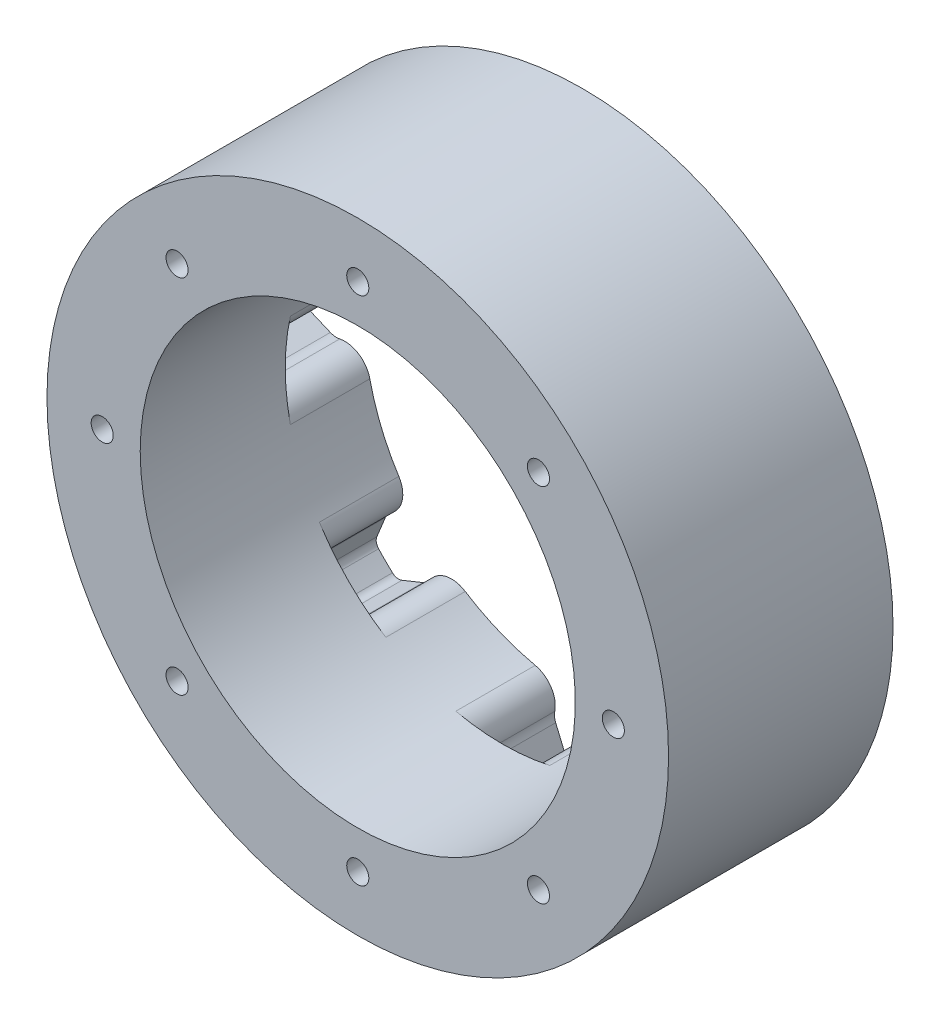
ISO-10303-21;
HEADER;
FILE_DESCRIPTION(('STEP AP214'),'2;1');
FILE_NAME('part.step','',(''),(''),'','','');
FILE_SCHEMA(('AUTOMOTIVE_DESIGN { 1 0 10303 214 1 1 1 1 }'));
ENDSEC;
DATA;
#1=APPLICATION_CONTEXT('core data for automotive mechanical design processes');
#2=APPLICATION_PROTOCOL_DEFINITION('international standard','automotive_design',2000,#1);
#3=PRODUCT_CONTEXT('',#1,'mechanical');
#4=PRODUCT('Part','Part','',(#3));
#5=PRODUCT_RELATED_PRODUCT_CATEGORY('part','',(#4));
#6=PRODUCT_DEFINITION_FORMATION('','',#4);
#7=PRODUCT_DEFINITION_CONTEXT('part definition',#1,'design');
#8=PRODUCT_DEFINITION('design','',#6,#7);
#9=PRODUCT_DEFINITION_SHAPE('','',#8);
#10=(LENGTH_UNIT() NAMED_UNIT(*) SI_UNIT(.MILLI.,.METRE.));
#11=(NAMED_UNIT(*) PLANE_ANGLE_UNIT() SI_UNIT($,.RADIAN.));
#12=(NAMED_UNIT(*) SI_UNIT($,.STERADIAN.) SOLID_ANGLE_UNIT());
#13=UNCERTAINTY_MEASURE_WITH_UNIT(LENGTH_MEASURE(1.E-05),#10,'distance_accuracy_value','');
#14=(GEOMETRIC_REPRESENTATION_CONTEXT(3) GLOBAL_UNCERTAINTY_ASSIGNED_CONTEXT((#13)) GLOBAL_UNIT_ASSIGNED_CONTEXT((#10,
#11,#12)) REPRESENTATION_CONTEXT('',''));
#15=CARTESIAN_POINT('',(0.,0.,0.));
#16=DIRECTION('',(0.,0.,1.));
#17=DIRECTION('',(1.,0.,0.));
#18=AXIS2_PLACEMENT_3D('',#15,#16,#17);
#19=CARTESIAN_POINT('',(0.,0.,-16.25));
#20=DIRECTION('',(0.,0.,1.));
#21=DIRECTION('',(1.,0.,0.));
#22=AXIS2_PLACEMENT_3D('',#19,#20,#21);
#23=PLANE('',#22);
#24=CARTESIAN_POINT('',(0.,0.,-16.25));
#25=DIRECTION('',(0.,0.,1.));
#26=DIRECTION('',(1.,0.,0.));
#27=AXIS2_PLACEMENT_3D('',#24,#25,#26);
#28=CIRCLE('',#27,45.);
#29=CARTESIAN_POINT('',(45.,0.,-16.25));
#30=VERTEX_POINT('',#29);
#31=EDGE_CURVE('E47',#30,#30,#28,.T.);
#32=ORIENTED_EDGE('',*,*,#31,.F.);
#33=EDGE_LOOP('',(#32));
#34=FACE_BOUND('',#33,.T.);
#35=CARTESIAN_POINT('',(0.,0.,-16.25));
#36=DIRECTION('',(0.,0.,-1.));
#37=DIRECTION('',(-1.,0.,0.));
#38=AXIS2_PLACEMENT_3D('',#35,#36,#37);
#39=CIRCLE('',#38,31.5);
#40=CARTESIAN_POINT('',(-30.7562122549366,6.80480769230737,-16.25));
#41=VERTEX_POINT('',#40);
#42=CARTESIAN_POINT('',(-26.5596519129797,16.9362005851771,-16.25));
#43=VERTEX_POINT('',#42);
#44=EDGE_CURVE('E544',#41,#43,#39,.T.);
#45=ORIENTED_EDGE('',*,*,#44,.F.);
#46=CARTESIAN_POINT('',(-34.3688467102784,7.60410256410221,-16.25));
#47=DIRECTION('',(0.,0.,1.));
#48=DIRECTION('',(0.,-1.,0.));
#49=AXIS2_PLACEMENT_3D('',#46,#47,#48);
#50=CIRCLE('',#49,3.7);
#51=CARTESIAN_POINT('',(-35.1122776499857,3.97955977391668,-16.25));
#52=VERTEX_POINT('',#51);
#53=EDGE_CURVE('E562',#52,#41,#50,.T.);
#54=ORIENTED_EDGE('',*,*,#53,.F.);
#55=CARTESIAN_POINT('',(-35.5744103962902,1.72646560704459,-16.25));
#56=DIRECTION('',(0.,0.,-1.));
#57=DIRECTION('',(0.,1.,0.));
#58=AXIS2_PLACEMENT_3D('',#55,#56,#57);
#59=CIRCLE('',#58,2.3);
#60=CARTESIAN_POINT('',(-36.469685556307,3.84506948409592,-16.25));
#61=VERTEX_POINT('',#60);
#62=EDGE_CURVE('E573',#61,#52,#59,.T.);
#63=ORIENTED_EDGE('',*,*,#62,.F.);
#64=DIRECTION('',(0.921132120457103,0.389250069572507,0.));
#65=VECTOR('',#64,1.);
#66=CARTESIAN_POINT('',(-39.4817875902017,2.57222175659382,-16.25));
#67=LINE('',#66,#65);
#68=CARTESIAN_POINT('',(-39.4817875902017,2.57222175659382,-16.25));
#69=VERTEX_POINT('',#68);
#70=EDGE_CURVE('E583',#69,#61,#67,.T.);
#71=ORIENTED_EDGE('',*,*,#70,.F.);
#72=CARTESIAN_POINT('',(-38.9757624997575,1.37474999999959,-16.25));
#73=DIRECTION('',(0.,0.,-1.));
#74=DIRECTION('',(0.,1.,0.));
#75=AXIS2_PLACEMENT_3D('',#72,#73,#74);
#76=CIRCLE('',#75,1.3);
#77=CARTESIAN_POINT('',(-40.2749545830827,1.42057499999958,-16.25));
#78=VERTEX_POINT('',#77);
#79=EDGE_CURVE('E2296',#78,#69,#76,.T.);
#80=ORIENTED_EDGE('',*,*,#79,.F.);
#81=CARTESIAN_POINT('',(0.,0.,-16.25));
#82=DIRECTION('',(0.,0.,-1.));
#83=DIRECTION('',(0.,1.,0.));
#84=AXIS2_PLACEMENT_3D('',#81,#82,#83);
#85=CIRCLE('',#84,40.3);
#86=CARTESIAN_POINT('',(-40.2749545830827,-1.42057500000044,-16.25));
#87=VERTEX_POINT('',#86);
#88=EDGE_CURVE('E2295',#87,#78,#85,.T.);
#89=ORIENTED_EDGE('',*,*,#88,.F.);
#90=CARTESIAN_POINT('',(-38.9757624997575,-1.37475000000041,-16.25));
#91=DIRECTION('',(0.,0.,-1.));
#92=DIRECTION('',(0.,-1.,0.));
#93=AXIS2_PLACEMENT_3D('',#90,#91,#92);
#94=CIRCLE('',#93,1.3);
#95=CARTESIAN_POINT('',(-39.4817875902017,-2.57222175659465,-16.25));
#96=VERTEX_POINT('',#95);
#97=EDGE_CURVE('E2286',#96,#87,#94,.T.);
#98=ORIENTED_EDGE('',*,*,#97,.F.);
#99=DIRECTION('',(-0.921132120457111,0.389250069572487,0.));
#100=VECTOR('',#99,1.);
#101=CARTESIAN_POINT('',(-39.4817875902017,-2.57222175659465,-16.25));
#102=LINE('',#101,#100);
#103=CARTESIAN_POINT('',(-36.4696855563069,-3.84506948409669,-16.25));
#104=VERTEX_POINT('',#103);
#105=EDGE_CURVE('E2281',#104,#96,#102,.T.);
#106=ORIENTED_EDGE('',*,*,#105,.F.);
#107=CARTESIAN_POINT('',(-35.5744103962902,-1.72646560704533,-16.25));
#108=DIRECTION('',(0.,0.,-1.));
#109=DIRECTION('',(0.,-1.,0.));
#110=AXIS2_PLACEMENT_3D('',#107,#108,#109);
#111=CIRCLE('',#110,2.3);
#112=CARTESIAN_POINT('',(-35.1122776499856,-3.97955977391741,-16.25));
#113=VERTEX_POINT('',#112);
#114=EDGE_CURVE('E691',#113,#104,#111,.T.);
#115=ORIENTED_EDGE('',*,*,#114,.F.);
#116=CARTESIAN_POINT('',(-34.3688467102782,-7.60410256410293,-16.25));
#117=DIRECTION('',(0.,0.,1.));
#118=DIRECTION('',(0.,1.,0.));
#119=AXIS2_PLACEMENT_3D('',#116,#117,#118);
#120=CIRCLE('',#119,3.7);
#121=CARTESIAN_POINT('',(-30.7562122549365,-6.80480769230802,-16.25));
#122=VERTEX_POINT('',#121);
#123=EDGE_CURVE('E574',#122,#113,#120,.T.);
#124=ORIENTED_EDGE('',*,*,#123,.F.);
#125=CARTESIAN_POINT('',(-26.5596519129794,-16.9362005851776,-16.25));
#126=VERTEX_POINT('',#125);
#127=EDGE_CURVE('E569',#126,#122,#39,.T.);
#128=ORIENTED_EDGE('',*,*,#127,.F.);
#129=CARTESIAN_POINT('',(-29.6793570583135,-18.9255320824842,-16.25));
#130=DIRECTION('',(0.,0.,1.));
#131=DIRECTION('',(0.707106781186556,-0.707106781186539,0.));
#132=AXIS2_PLACEMENT_3D('',#129,#130,#131);
#133=CIRCLE('',#132,3.7);
#134=CARTESIAN_POINT('',(-27.6421033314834,-22.0141559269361,-16.25));
#135=VERTEX_POINT('',#134);
#136=EDGE_CURVE('E684',#135,#126,#133,.T.);
#137=ORIENTED_EDGE('',*,*,#136,.F.);
#138=CARTESIAN_POINT('',(-26.3757023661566,-23.9341112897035,-16.25));
#139=DIRECTION('',(0.,0.,-1.));
#140=DIRECTION('',(-0.707106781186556,0.707106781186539,0.));
#141=AXIS2_PLACEMENT_3D('',#138,#139,#140);
#142=CIRCLE('',#141,2.3);
#143=CARTESIAN_POINT('',(-28.5068366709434,-23.0690872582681,-16.25));
#144=VERTEX_POINT('',#143);
#145=EDGE_CURVE('E679',#144,#135,#142,.T.);
#146=ORIENTED_EDGE('',*,*,#145,.F.);
#147=DIRECTION('',(0.376097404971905,0.926580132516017,0.));
#148=VECTOR('',#147,1.);
#149=CARTESIAN_POINT('',(-29.7366751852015,-26.0990042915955,-16.25));
#150=LINE('',#149,#148);
#151=CARTESIAN_POINT('',(-29.7366751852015,-26.0990042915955,-16.25));
#152=VERTEX_POINT('',#151);
#153=EDGE_CURVE('E673',#152,#144,#150,.T.);
#154=ORIENTED_EDGE('',*,*,#153,.F.);
#155=CARTESIAN_POINT('',(-28.5321210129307,-26.587930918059,-16.25));
#156=DIRECTION('',(0.,0.,-1.));
#157=DIRECTION('',(-0.707106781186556,0.707106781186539,0.));
#158=AXIS2_PLACEMENT_3D('',#155,#156,#157);
#159=CIRCLE('',#158,1.3);
#160=CARTESIAN_POINT('',(-29.4831917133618,-27.4741952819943,-16.25));
#161=VERTEX_POINT('',#160);
#162=EDGE_CURVE('E672',#161,#152,#159,.T.);
#163=ORIENTED_EDGE('',*,*,#162,.F.);
#164=CARTESIAN_POINT('',(0.,0.,-16.25));
#165=DIRECTION('',(0.,0.,-1.));
#166=DIRECTION('',(-0.707106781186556,0.707106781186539,0.));
#167=AXIS2_PLACEMENT_3D('',#164,#165,#166);
#168=CIRCLE('',#167,40.3);
#169=CARTESIAN_POINT('',(-27.4741952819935,-29.4831917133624,-16.25));
#170=VERTEX_POINT('',#169);
#171=EDGE_CURVE('E667',#170,#161,#168,.T.);
#172=ORIENTED_EDGE('',*,*,#171,.F.);
#173=CARTESIAN_POINT('',(-26.5879309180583,-28.5321210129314,-16.25));
#174=DIRECTION('',(0.,0.,-1.));
#175=DIRECTION('',(0.707106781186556,-0.707106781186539,0.));
#176=AXIS2_PLACEMENT_3D('',#173,#174,#175);
#177=CIRCLE('',#176,1.3);
#178=CARTESIAN_POINT('',(-26.0990042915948,-29.7366751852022,-16.25));
#179=VERTEX_POINT('',#178);
#180=EDGE_CURVE('E664',#179,#170,#177,.T.);
#181=ORIENTED_EDGE('',*,*,#180,.F.);
#182=DIRECTION('',(-0.926580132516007,-0.376097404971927,0.));
#183=VECTOR('',#182,1.);
#184=CARTESIAN_POINT('',(-26.0990042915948,-29.7366751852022,-16.25));
#185=LINE('',#184,#183);
#186=CARTESIAN_POINT('',(-23.0690872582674,-28.506836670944,-16.25));
#187=VERTEX_POINT('',#186);
#188=EDGE_CURVE('E658',#187,#179,#185,.T.);
#189=ORIENTED_EDGE('',*,*,#188,.F.);
#190=CARTESIAN_POINT('',(-23.9341112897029,-26.3757023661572,-16.25));
#191=DIRECTION('',(0.,0.,-1.));
#192=DIRECTION('',(0.707106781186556,-0.707106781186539,0.));
#193=AXIS2_PLACEMENT_3D('',#190,#191,#192);
#194=CIRCLE('',#193,2.3);
#195=CARTESIAN_POINT('',(-22.0141559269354,-27.6421033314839,-16.25));
#196=VERTEX_POINT('',#195);
#197=EDGE_CURVE('E656',#196,#187,#194,.T.);
#198=ORIENTED_EDGE('',*,*,#197,.F.);
#199=CARTESIAN_POINT('',(-18.9255320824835,-29.6793570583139,-16.25));
#200=DIRECTION('',(0.,0.,1.));
#201=DIRECTION('',(-0.707106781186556,0.707106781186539,0.));
#202=AXIS2_PLACEMENT_3D('',#199,#200,#201);
#203=CIRCLE('',#202,3.7);
#204=CARTESIAN_POINT('',(-16.936200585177,-26.5596519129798,-16.25));
#205=VERTEX_POINT('',#204);
#206=EDGE_CURVE('E616',#205,#196,#203,.T.);
#207=ORIENTED_EDGE('',*,*,#206,.F.);
#208=CARTESIAN_POINT('',(-6.80480769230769,-30.7562122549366,-16.25));
#209=VERTEX_POINT('',#208);
#210=EDGE_CURVE('E1382',#209,#205,#39,.T.);
#211=ORIENTED_EDGE('',*,*,#210,.F.);
#212=CARTESIAN_POINT('',(-7.60410256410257,-34.3688467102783,-16.25));
#213=DIRECTION('',(0.,0.,1.));
#214=DIRECTION('',(1.,0.,0.));
#215=AXIS2_PLACEMENT_3D('',#212,#213,#214);
#216=CIRCLE('',#215,3.7);
#217=CARTESIAN_POINT('',(-3.97955977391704,-35.1122776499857,-16.25));
#218=VERTEX_POINT('',#217);
#219=EDGE_CURVE('E1317',#218,#209,#216,.T.);
#220=ORIENTED_EDGE('',*,*,#219,.F.);
#221=CARTESIAN_POINT('',(-1.72646560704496,-35.5744103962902,-16.25));
#222=DIRECTION('',(0.,0.,-1.));
#223=DIRECTION('',(-1.,0.,0.));
#224=AXIS2_PLACEMENT_3D('',#221,#222,#223);
#225=CIRCLE('',#224,2.3);
#226=CARTESIAN_POINT('',(-3.8450694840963,-36.469685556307,-16.25));
#227=VERTEX_POINT('',#226);
#228=EDGE_CURVE('E1312',#227,#218,#225,.T.);
#229=ORIENTED_EDGE('',*,*,#228,.F.);
#230=DIRECTION('',(-0.389250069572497,0.921132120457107,0.));
#231=VECTOR('',#230,1.);
#232=CARTESIAN_POINT('',(-2.57222175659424,-39.4817875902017,-16.25));
#233=LINE('',#232,#231);
#234=CARTESIAN_POINT('',(-2.57222175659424,-39.4817875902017,-16.25));
#235=VERTEX_POINT('',#234);
#236=EDGE_CURVE('E1309',#235,#227,#233,.T.);
#237=ORIENTED_EDGE('',*,*,#236,.F.);
#238=CARTESIAN_POINT('',(-1.37475,-38.9757624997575,-16.25));
#239=DIRECTION('',(0.,0.,-1.));
#240=DIRECTION('',(-1.,0.,0.));
#241=AXIS2_PLACEMENT_3D('',#238,#239,#240);
#242=CIRCLE('',#241,1.3);
#243=CARTESIAN_POINT('',(-1.420575,-40.2749545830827,-16.25));
#244=VERTEX_POINT('',#243);
#245=EDGE_CURVE('E1306',#244,#235,#242,.T.);
#246=ORIENTED_EDGE('',*,*,#245,.F.);
#247=CARTESIAN_POINT('',(0.,0.,-16.25));
#248=DIRECTION('',(0.,0.,-1.));
#249=DIRECTION('',(-1.,0.,0.));
#250=AXIS2_PLACEMENT_3D('',#247,#248,#249);
#251=CIRCLE('',#250,40.3);
#252=CARTESIAN_POINT('',(1.42057500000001,-40.2749545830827,-16.25));
#253=VERTEX_POINT('',#252);
#254=EDGE_CURVE('E1305',#253,#244,#251,.T.);
#255=ORIENTED_EDGE('',*,*,#254,.F.);
#256=CARTESIAN_POINT('',(1.37475,-38.9757624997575,-16.25));
#257=DIRECTION('',(0.,0.,-1.));
#258=DIRECTION('',(1.,0.,0.));
#259=AXIS2_PLACEMENT_3D('',#256,#257,#258);
#260=CIRCLE('',#259,1.3);
#261=CARTESIAN_POINT('',(2.57222175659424,-39.4817875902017,-16.25));
#262=VERTEX_POINT('',#261);
#263=EDGE_CURVE('E1296',#262,#253,#260,.T.);
#264=ORIENTED_EDGE('',*,*,#263,.F.);
#265=DIRECTION('',(-0.389250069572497,-0.921132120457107,0.));
#266=VECTOR('',#265,1.);
#267=CARTESIAN_POINT('',(2.57222175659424,-39.4817875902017,-16.25));
#268=LINE('',#267,#266);
#269=CARTESIAN_POINT('',(3.84506948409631,-36.469685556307,-16.25));
#270=VERTEX_POINT('',#269);
#271=EDGE_CURVE('E1291',#270,#262,#268,.T.);
#272=ORIENTED_EDGE('',*,*,#271,.F.);
#273=CARTESIAN_POINT('',(1.72646560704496,-35.5744103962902,-16.25));
#274=DIRECTION('',(0.,0.,-1.));
#275=DIRECTION('',(1.,0.,0.));
#276=AXIS2_PLACEMENT_3D('',#273,#274,#275);
#277=CIRCLE('',#276,2.3);
#278=CARTESIAN_POINT('',(3.97955977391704,-35.1122776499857,-16.25));
#279=VERTEX_POINT('',#278);
#280=EDGE_CURVE('E1222',#279,#270,#277,.T.);
#281=ORIENTED_EDGE('',*,*,#280,.F.);
#282=CARTESIAN_POINT('',(7.60410256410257,-34.3688467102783,-16.25));
#283=DIRECTION('',(0.,0.,1.));
#284=DIRECTION('',(-1.,0.,0.));
#285=AXIS2_PLACEMENT_3D('',#282,#283,#284);
#286=CIRCLE('',#285,3.7);
#287=CARTESIAN_POINT('',(6.80480769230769,-30.7562122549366,-16.25));
#288=VERTEX_POINT('',#287);
#289=EDGE_CURVE('E1254',#288,#279,#286,.T.);
#290=ORIENTED_EDGE('',*,*,#289,.F.);
#291=CARTESIAN_POINT('',(16.9362005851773,-26.5596519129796,-16.25));
#292=VERTEX_POINT('',#291);
#293=EDGE_CURVE('E1379',#292,#288,#39,.T.);
#294=ORIENTED_EDGE('',*,*,#293,.F.);
#295=CARTESIAN_POINT('',(18.9255320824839,-29.6793570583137,-16.25));
#296=DIRECTION('',(0.,0.,1.));
#297=DIRECTION('',(0.707106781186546,0.707106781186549,0.));
#298=AXIS2_PLACEMENT_3D('',#295,#296,#297);
#299=CIRCLE('',#298,3.7);
#300=CARTESIAN_POINT('',(22.0141559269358,-27.6421033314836,-16.25));
#301=VERTEX_POINT('',#300);
#302=EDGE_CURVE('E1212',#301,#292,#299,.T.);
#303=ORIENTED_EDGE('',*,*,#302,.F.);
#304=CARTESIAN_POINT('',(23.9341112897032,-26.3757023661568,-16.25));
#305=DIRECTION('',(0.,0.,-1.));
#306=DIRECTION('',(-0.707106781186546,-0.707106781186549,0.));
#307=AXIS2_PLACEMENT_3D('',#304,#305,#306);
#308=CIRCLE('',#307,2.3);
#309=CARTESIAN_POINT('',(23.0690872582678,-28.5068366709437,-16.25));
#310=VERTEX_POINT('',#309);
#311=EDGE_CURVE('E1210',#310,#301,#308,.T.);
#312=ORIENTED_EDGE('',*,*,#311,.F.);
#313=DIRECTION('',(-0.926580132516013,0.376097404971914,0.));
#314=VECTOR('',#313,1.);
#315=CARTESIAN_POINT('',(26.0990042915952,-29.7366751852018,-16.25));
#316=LINE('',#315,#314);
#317=CARTESIAN_POINT('',(26.0990042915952,-29.7366751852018,-16.25));
#318=VERTEX_POINT('',#317);
#319=EDGE_CURVE('E1203',#318,#310,#316,.T.);
#320=ORIENTED_EDGE('',*,*,#319,.F.);
#321=CARTESIAN_POINT('',(26.5879309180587,-28.532121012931,-16.25));
#322=DIRECTION('',(0.,0.,-1.));
#323=DIRECTION('',(-0.707106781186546,-0.707106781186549,0.));
#324=AXIS2_PLACEMENT_3D('',#321,#322,#323);
#325=CIRCLE('',#324,1.3);
#326=CARTESIAN_POINT('',(27.474195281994,-29.483191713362,-16.25));
#327=VERTEX_POINT('',#326);
#328=EDGE_CURVE('E1197',#327,#318,#325,.T.);
#329=ORIENTED_EDGE('',*,*,#328,.F.);
#330=CARTESIAN_POINT('',(0.,0.,-16.25));
#331=DIRECTION('',(0.,0.,-1.));
#332=DIRECTION('',(-0.707106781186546,-0.707106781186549,0.));
#333=AXIS2_PLACEMENT_3D('',#330,#331,#332);
#334=CIRCLE('',#333,40.3);
#335=CARTESIAN_POINT('',(29.4831917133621,-27.4741952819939,-16.25));
#336=VERTEX_POINT('',#335);
#337=EDGE_CURVE('E1192',#336,#327,#334,.T.);
#338=ORIENTED_EDGE('',*,*,#337,.F.);
#339=CARTESIAN_POINT('',(28.5321210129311,-26.5879309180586,-16.25));
#340=DIRECTION('',(0.,0.,-1.));
#341=DIRECTION('',(0.707106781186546,0.707106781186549,0.));
#342=AXIS2_PLACEMENT_3D('',#339,#340,#341);
#343=CIRCLE('',#342,1.3);
#344=CARTESIAN_POINT('',(29.7366751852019,-26.0990042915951,-16.25));
#345=VERTEX_POINT('',#344);
#346=EDGE_CURVE('E1193',#345,#336,#343,.T.);
#347=ORIENTED_EDGE('',*,*,#346,.F.);
#348=DIRECTION('',(0.376097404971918,-0.926580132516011,0.));
#349=VECTOR('',#348,1.);
#350=CARTESIAN_POINT('',(29.7366751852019,-26.0990042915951,-16.25));
#351=LINE('',#350,#349);
#352=CARTESIAN_POINT('',(28.5068366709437,-23.0690872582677,-16.25));
#353=VERTEX_POINT('',#352);
#354=EDGE_CURVE('E1187',#353,#345,#351,.T.);
#355=ORIENTED_EDGE('',*,*,#354,.F.);
#356=CARTESIAN_POINT('',(26.3757023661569,-23.9341112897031,-16.25));
#357=DIRECTION('',(0.,0.,-1.));
#358=DIRECTION('',(0.707106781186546,0.707106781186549,0.));
#359=AXIS2_PLACEMENT_3D('',#356,#357,#358);
#360=CIRCLE('',#359,2.3);
#361=CARTESIAN_POINT('',(27.6421033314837,-22.0141559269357,-16.25));
#362=VERTEX_POINT('',#361);
#363=EDGE_CURVE('E803',#362,#353,#360,.T.);
#364=ORIENTED_EDGE('',*,*,#363,.F.);
#365=CARTESIAN_POINT('',(29.6793570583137,-18.9255320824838,-16.25));
#366=DIRECTION('',(0.,0.,1.));
#367=DIRECTION('',(-0.707106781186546,-0.707106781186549,0.));
#368=AXIS2_PLACEMENT_3D('',#365,#366,#367);
#369=CIRCLE('',#368,3.7);
#370=CARTESIAN_POINT('',(26.5596519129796,-16.9362005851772,-16.25));
#371=VERTEX_POINT('',#370);
#372=EDGE_CURVE('E1148',#371,#362,#369,.T.);
#373=ORIENTED_EDGE('',*,*,#372,.F.);
#374=CARTESIAN_POINT('',(30.7562122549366,-6.80480769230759,-16.25));
#375=VERTEX_POINT('',#374);
#376=EDGE_CURVE('E1381',#375,#371,#39,.T.);
#377=ORIENTED_EDGE('',*,*,#376,.F.);
#378=CARTESIAN_POINT('',(34.3688467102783,-7.60410256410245,-16.25));
#379=DIRECTION('',(0.,0.,1.));
#380=DIRECTION('',(0.,1.,0.));
#381=AXIS2_PLACEMENT_3D('',#378,#379,#380);
#382=CIRCLE('',#381,3.7);
#383=CARTESIAN_POINT('',(35.1122776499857,-3.97955977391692,-16.25));
#384=VERTEX_POINT('',#383);
#385=EDGE_CURVE('E791',#384,#375,#382,.T.);
#386=ORIENTED_EDGE('',*,*,#385,.F.);
#387=CARTESIAN_POINT('',(35.5744103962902,-1.72646560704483,-16.25));
#388=DIRECTION('',(0.,0.,-1.));
#389=DIRECTION('',(0.,-1.,0.));
#390=AXIS2_PLACEMENT_3D('',#387,#388,#389);
#391=CIRCLE('',#390,2.3);
#392=CARTESIAN_POINT('',(36.469685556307,-3.84506948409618,-16.25));
#393=VERTEX_POINT('',#392);
#394=EDGE_CURVE('E790',#393,#384,#391,.T.);
#395=ORIENTED_EDGE('',*,*,#394,.F.);
#396=DIRECTION('',(-0.921132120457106,-0.3892500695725,0.));
#397=VECTOR('',#396,1.);
#398=CARTESIAN_POINT('',(39.4817875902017,-2.5722217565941,-16.25));
#399=LINE('',#398,#397);
#400=CARTESIAN_POINT('',(39.4817875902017,-2.5722217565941,-16.25));
#401=VERTEX_POINT('',#400);
#402=EDGE_CURVE('E784',#401,#393,#399,.T.);
#403=ORIENTED_EDGE('',*,*,#402,.F.);
#404=CARTESIAN_POINT('',(38.9757624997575,-1.37474999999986,-16.25));
#405=DIRECTION('',(0.,0.,-1.));
#406=DIRECTION('',(0.,-1.,0.));
#407=AXIS2_PLACEMENT_3D('',#404,#405,#406);
#408=CIRCLE('',#407,1.3);
#409=CARTESIAN_POINT('',(40.2749545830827,-1.42057499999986,-16.25));
#410=VERTEX_POINT('',#409);
#411=EDGE_CURVE('E778',#410,#401,#408,.T.);
#412=ORIENTED_EDGE('',*,*,#411,.F.);
#413=CARTESIAN_POINT('',(0.,0.,-16.25));
#414=DIRECTION('',(0.,0.,-1.));
#415=DIRECTION('',(0.,-1.,0.));
#416=AXIS2_PLACEMENT_3D('',#413,#414,#415);
#417=CIRCLE('',#416,40.3);
#418=CARTESIAN_POINT('',(40.2749545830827,1.42057500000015,-16.25));
#419=VERTEX_POINT('',#418);
#420=EDGE_CURVE('E773',#419,#410,#417,.T.);
#421=ORIENTED_EDGE('',*,*,#420,.F.);
#422=CARTESIAN_POINT('',(38.9757624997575,1.37475000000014,-16.25));
#423=DIRECTION('',(0.,0.,-1.));
#424=DIRECTION('',(0.,1.,0.));
#425=AXIS2_PLACEMENT_3D('',#422,#423,#424);
#426=CIRCLE('',#425,1.3);
#427=CARTESIAN_POINT('',(39.4817875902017,2.57222175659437,-16.25));
#428=VERTEX_POINT('',#427);
#429=EDGE_CURVE('E772',#428,#419,#426,.T.);
#430=ORIENTED_EDGE('',*,*,#429,.F.);
#431=DIRECTION('',(0.921132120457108,-0.389250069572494,0.));
#432=VECTOR('',#431,1.);
#433=CARTESIAN_POINT('',(39.4817875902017,2.57222175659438,-16.25));
#434=LINE('',#433,#432);
#435=CARTESIAN_POINT('',(36.469685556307,3.84506948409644,-16.25));
#436=VERTEX_POINT('',#435);
#437=EDGE_CURVE('E766',#436,#428,#434,.T.);
#438=ORIENTED_EDGE('',*,*,#437,.F.);
#439=CARTESIAN_POINT('',(35.5744103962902,1.72646560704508,-16.25));
#440=DIRECTION('',(0.,0.,-1.));
#441=DIRECTION('',(0.,1.,0.));
#442=AXIS2_PLACEMENT_3D('',#439,#440,#441);
#443=CIRCLE('',#442,2.3);
#444=CARTESIAN_POINT('',(35.1122776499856,3.97955977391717,-16.25));
#445=VERTEX_POINT('',#444);
#446=EDGE_CURVE('E61',#445,#436,#443,.T.);
#447=ORIENTED_EDGE('',*,*,#446,.F.);
#448=CARTESIAN_POINT('',(34.3688467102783,7.60410256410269,-16.25));
#449=DIRECTION('',(0.,0.,1.));
#450=DIRECTION('',(0.,-1.,0.));
#451=AXIS2_PLACEMENT_3D('',#448,#449,#450);
#452=CIRCLE('',#451,3.7);
#453=CARTESIAN_POINT('',(30.7562122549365,6.8048076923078,-16.25));
#454=VERTEX_POINT('',#453);
#455=EDGE_CURVE('E730',#454,#445,#452,.T.);
#456=ORIENTED_EDGE('',*,*,#455,.F.);
#457=CARTESIAN_POINT('',(26.5596519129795,16.9362005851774,-16.25));
#458=VERTEX_POINT('',#457);
#459=EDGE_CURVE('E2243',#458,#454,#39,.T.);
#460=ORIENTED_EDGE('',*,*,#459,.F.);
#461=CARTESIAN_POINT('',(29.6793570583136,18.925532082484,-16.25));
#462=DIRECTION('',(0.,0.,1.));
#463=DIRECTION('',(-0.707106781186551,0.707106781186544,0.));
#464=AXIS2_PLACEMENT_3D('',#461,#462,#463);
#465=CIRCLE('',#464,3.7);
#466=CARTESIAN_POINT('',(27.6421033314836,22.0141559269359,-16.25));
#467=VERTEX_POINT('',#466);
#468=EDGE_CURVE('E896',#467,#458,#465,.T.);
#469=ORIENTED_EDGE('',*,*,#468,.F.);
#470=CARTESIAN_POINT('',(26.3757023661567,23.9341112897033,-16.25));
#471=DIRECTION('',(0.,0.,-1.));
#472=DIRECTION('',(0.707106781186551,-0.707106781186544,0.));
#473=AXIS2_PLACEMENT_3D('',#470,#471,#472);
#474=CIRCLE('',#473,2.3);
#475=CARTESIAN_POINT('',(28.5068366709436,23.0690872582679,-16.25));
#476=VERTEX_POINT('',#475);
#477=EDGE_CURVE('E891',#476,#467,#474,.T.);
#478=ORIENTED_EDGE('',*,*,#477,.F.);
#479=DIRECTION('',(-0.376097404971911,-0.926580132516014,0.));
#480=VECTOR('',#479,1.);
#481=CARTESIAN_POINT('',(29.7366751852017,26.0990042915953,-16.25));
#482=LINE('',#481,#480);
#483=CARTESIAN_POINT('',(29.7366751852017,26.0990042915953,-16.25));
#484=VERTEX_POINT('',#483);
#485=EDGE_CURVE('E890',#484,#476,#482,.T.);
#486=ORIENTED_EDGE('',*,*,#485,.F.);
#487=CARTESIAN_POINT('',(28.5321210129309,26.5879309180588,-16.25));
#488=DIRECTION('',(0.,0.,-1.));
#489=DIRECTION('',(0.707106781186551,-0.707106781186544,0.));
#490=AXIS2_PLACEMENT_3D('',#487,#488,#489);
#491=CIRCLE('',#490,1.3);
#492=CARTESIAN_POINT('',(29.4831917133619,27.4741952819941,-16.25));
#493=VERTEX_POINT('',#492);
#494=EDGE_CURVE('E886',#493,#484,#491,.T.);
#495=ORIENTED_EDGE('',*,*,#494,.F.);
#496=CARTESIAN_POINT('',(0.,0.,-16.25));
#497=DIRECTION('',(0.,0.,-1.));
#498=DIRECTION('',(0.707106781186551,-0.707106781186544,0.));
#499=AXIS2_PLACEMENT_3D('',#496,#497,#498);
#500=CIRCLE('',#499,40.3);
#501=CARTESIAN_POINT('',(27.4741952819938,29.4831917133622,-16.25));
#502=VERTEX_POINT('',#501);
#503=EDGE_CURVE('E885',#502,#493,#500,.T.);
#504=ORIENTED_EDGE('',*,*,#503,.F.);
#505=CARTESIAN_POINT('',(26.5879309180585,28.5321210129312,-16.25));
#506=DIRECTION('',(0.,0.,-1.));
#507=DIRECTION('',(-0.707106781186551,0.707106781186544,0.));
#508=AXIS2_PLACEMENT_3D('',#505,#506,#507);
#509=CIRCLE('',#508,1.3);
#510=CARTESIAN_POINT('',(26.099004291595,29.736675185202,-16.25));
#511=VERTEX_POINT('',#510);
#512=EDGE_CURVE('E877',#511,#502,#509,.T.);
#513=ORIENTED_EDGE('',*,*,#512,.F.);
#514=DIRECTION('',(0.92658013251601,0.376097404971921,0.));
#515=VECTOR('',#514,1.);
#516=CARTESIAN_POINT('',(26.099004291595,29.736675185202,-16.25));
#517=LINE('',#516,#515);
#518=CARTESIAN_POINT('',(23.0690872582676,28.5068366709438,-16.25));
#519=VERTEX_POINT('',#518);
#520=EDGE_CURVE('E873',#519,#511,#517,.T.);
#521=ORIENTED_EDGE('',*,*,#520,.F.);
#522=CARTESIAN_POINT('',(23.9341112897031,26.375702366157,-16.25));
#523=DIRECTION('',(0.,0.,-1.));
#524=DIRECTION('',(-0.707106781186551,0.707106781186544,0.));
#525=AXIS2_PLACEMENT_3D('',#522,#523,#524);
#526=CIRCLE('',#525,2.3);
#527=CARTESIAN_POINT('',(22.0141559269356,27.6421033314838,-16.25));
#528=VERTEX_POINT('',#527);
#529=EDGE_CURVE('E66',#528,#519,#526,.T.);
#530=ORIENTED_EDGE('',*,*,#529,.F.);
#531=CARTESIAN_POINT('',(18.9255320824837,29.6793570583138,-16.25));
#532=DIRECTION('',(0.,0.,1.));
#533=DIRECTION('',(0.707106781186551,-0.707106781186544,0.));
#534=AXIS2_PLACEMENT_3D('',#531,#532,#533);
#535=CIRCLE('',#534,3.7);
#536=CARTESIAN_POINT('',(16.9362005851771,26.5596519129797,-16.25));
#537=VERTEX_POINT('',#536);
#538=EDGE_CURVE('E833',#537,#528,#535,.T.);
#539=ORIENTED_EDGE('',*,*,#538,.F.);
#540=CARTESIAN_POINT('',(6.80480769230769,30.7562122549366,-16.25));
#541=VERTEX_POINT('',#540);
#542=EDGE_CURVE('E2241',#541,#537,#39,.T.);
#543=ORIENTED_EDGE('',*,*,#542,.F.);
#544=CARTESIAN_POINT('',(7.60410256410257,34.3688467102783,-16.25));
#545=DIRECTION('',(0.,0.,1.));
#546=DIRECTION('',(-1.,0.,0.));
#547=AXIS2_PLACEMENT_3D('',#544,#545,#546);
#548=CIRCLE('',#547,3.7);
#549=CARTESIAN_POINT('',(3.97955977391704,35.1122776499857,-16.25));
#550=VERTEX_POINT('',#549);
#551=EDGE_CURVE('E1001',#550,#541,#548,.T.);
#552=ORIENTED_EDGE('',*,*,#551,.F.);
#553=CARTESIAN_POINT('',(1.72646560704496,35.5744103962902,-16.25));
#554=DIRECTION('',(0.,0.,-1.));
#555=DIRECTION('',(1.,0.,0.));
#556=AXIS2_PLACEMENT_3D('',#553,#554,#555);
#557=CIRCLE('',#556,2.3);
#558=CARTESIAN_POINT('',(3.8450694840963,36.469685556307,-16.25));
#559=VERTEX_POINT('',#558);
#560=EDGE_CURVE('E1000',#559,#550,#557,.T.);
#561=ORIENTED_EDGE('',*,*,#560,.F.);
#562=DIRECTION('',(0.389250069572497,-0.921132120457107,0.));
#563=VECTOR('',#562,1.);
#564=CARTESIAN_POINT('',(2.57222175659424,39.4817875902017,-16.25));
#565=LINE('',#564,#563);
#566=CARTESIAN_POINT('',(2.57222175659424,39.4817875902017,-16.25));
#567=VERTEX_POINT('',#566);
#568=EDGE_CURVE('E996',#567,#559,#565,.T.);
#569=ORIENTED_EDGE('',*,*,#568,.F.);
#570=CARTESIAN_POINT('',(1.37475,38.9757624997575,-16.25));
#571=DIRECTION('',(0.,0.,-1.));
#572=DIRECTION('',(1.,0.,0.));
#573=AXIS2_PLACEMENT_3D('',#570,#571,#572);
#574=CIRCLE('',#573,1.3);
#575=CARTESIAN_POINT('',(1.420575,40.2749545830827,-16.25));
#576=VERTEX_POINT('',#575);
#577=EDGE_CURVE('E995',#576,#567,#574,.T.);
#578=ORIENTED_EDGE('',*,*,#577,.F.);
#579=CARTESIAN_POINT('',(0.,0.,-16.25));
#580=DIRECTION('',(0.,0.,-1.));
#581=DIRECTION('',(1.,0.,0.));
#582=AXIS2_PLACEMENT_3D('',#579,#580,#581);
#583=CIRCLE('',#582,40.3);
#584=CARTESIAN_POINT('',(-1.42057500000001,40.2749545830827,-16.25));
#585=VERTEX_POINT('',#584);
#586=EDGE_CURVE('E987',#585,#576,#583,.T.);
#587=ORIENTED_EDGE('',*,*,#586,.F.);
#588=CARTESIAN_POINT('',(-1.37475,38.9757624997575,-16.25));
#589=DIRECTION('',(0.,0.,-1.));
#590=DIRECTION('',(-1.,0.,0.));
#591=AXIS2_PLACEMENT_3D('',#588,#589,#590);
#592=CIRCLE('',#591,1.3);
#593=CARTESIAN_POINT('',(-2.57222175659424,39.4817875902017,-16.25));
#594=VERTEX_POINT('',#593);
#595=EDGE_CURVE('E982',#594,#585,#592,.T.);
#596=ORIENTED_EDGE('',*,*,#595,.F.);
#597=DIRECTION('',(0.389250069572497,0.921132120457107,0.));
#598=VECTOR('',#597,1.);
#599=CARTESIAN_POINT('',(-2.57222175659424,39.4817875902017,-16.25));
#600=LINE('',#599,#598);
#601=CARTESIAN_POINT('',(-3.84506948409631,36.469685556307,-16.25));
#602=VERTEX_POINT('',#601);
#603=EDGE_CURVE('E977',#602,#594,#600,.T.);
#604=ORIENTED_EDGE('',*,*,#603,.F.);
#605=CARTESIAN_POINT('',(-1.72646560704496,35.5744103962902,-16.25));
#606=DIRECTION('',(0.,0.,-1.));
#607=DIRECTION('',(-1.,0.,0.));
#608=AXIS2_PLACEMENT_3D('',#605,#606,#607);
#609=CIRCLE('',#608,2.3);
#610=CARTESIAN_POINT('',(-3.97955977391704,35.1122776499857,-16.25));
#611=VERTEX_POINT('',#610);
#612=EDGE_CURVE('E976',#611,#602,#609,.T.);
#613=ORIENTED_EDGE('',*,*,#612,.F.);
#614=CARTESIAN_POINT('',(-7.60410256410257,34.3688467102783,-16.25));
#615=DIRECTION('',(0.,0.,1.));
#616=DIRECTION('',(1.,0.,0.));
#617=AXIS2_PLACEMENT_3D('',#614,#615,#616);
#618=CIRCLE('',#617,3.7);
#619=CARTESIAN_POINT('',(-6.80480769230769,30.7562122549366,-16.25));
#620=VERTEX_POINT('',#619);
#621=EDGE_CURVE('E936',#620,#611,#618,.T.);
#622=ORIENTED_EDGE('',*,*,#621,.F.);
#623=CARTESIAN_POINT('',(-16.9362005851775,26.5596519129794,-16.25));
#624=VERTEX_POINT('',#623);
#625=EDGE_CURVE('E570',#624,#620,#39,.T.);
#626=ORIENTED_EDGE('',*,*,#625,.F.);
#627=CARTESIAN_POINT('',(-18.9255320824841,29.6793570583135,-16.25));
#628=DIRECTION('',(0.,0.,1.));
#629=DIRECTION('',(-0.707106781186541,-0.707106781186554,0.));
#630=AXIS2_PLACEMENT_3D('',#627,#628,#629);
#631=CIRCLE('',#630,3.7);
#632=CARTESIAN_POINT('',(-22.014155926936,27.6421033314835,-16.25));
#633=VERTEX_POINT('',#632);
#634=EDGE_CURVE('E1109',#633,#624,#631,.T.);
#635=ORIENTED_EDGE('',*,*,#634,.F.);
#636=CARTESIAN_POINT('',(-23.9341112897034,26.3757023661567,-16.25));
#637=DIRECTION('',(0.,0.,-1.));
#638=DIRECTION('',(0.707106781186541,0.707106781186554,0.));
#639=AXIS2_PLACEMENT_3D('',#636,#637,#638);
#640=CIRCLE('',#639,2.3);
#641=CARTESIAN_POINT('',(-23.069087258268,28.5068366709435,-16.25));
#642=VERTEX_POINT('',#641);
#643=EDGE_CURVE('E1101',#642,#633,#640,.T.);
#644=ORIENTED_EDGE('',*,*,#643,.F.);
#645=DIRECTION('',(0.926580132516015,-0.376097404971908,0.));
#646=VECTOR('',#645,1.);
#647=CARTESIAN_POINT('',(-26.0990042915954,29.7366751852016,-16.25));
#648=LINE('',#647,#646);
#649=CARTESIAN_POINT('',(-26.0990042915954,29.7366751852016,-16.25));
#650=VERTEX_POINT('',#649);
#651=EDGE_CURVE('E1099',#650,#642,#648,.T.);
#652=ORIENTED_EDGE('',*,*,#651,.F.);
#653=CARTESIAN_POINT('',(-26.5879309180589,28.5321210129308,-16.25));
#654=DIRECTION('',(0.,0.,-1.));
#655=DIRECTION('',(0.707106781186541,0.707106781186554,0.));
#656=AXIS2_PLACEMENT_3D('',#653,#654,#655);
#657=CIRCLE('',#656,1.3);
#658=CARTESIAN_POINT('',(-27.4741952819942,29.4831917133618,-16.25));
#659=VERTEX_POINT('',#658);
#660=EDGE_CURVE('E1096',#659,#650,#657,.T.);
#661=ORIENTED_EDGE('',*,*,#660,.F.);
#662=CARTESIAN_POINT('',(0.,0.,-16.25));
#663=DIRECTION('',(0.,0.,-1.));
#664=DIRECTION('',(0.707106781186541,0.707106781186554,0.));
#665=AXIS2_PLACEMENT_3D('',#662,#663,#664);
#666=CIRCLE('',#665,40.3);
#667=CARTESIAN_POINT('',(-29.4831917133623,27.4741952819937,-16.25));
#668=VERTEX_POINT('',#667);
#669=EDGE_CURVE('E1095',#668,#659,#666,.T.);
#670=ORIENTED_EDGE('',*,*,#669,.F.);
#671=CARTESIAN_POINT('',(-28.5321210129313,26.5879309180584,-16.25));
#672=DIRECTION('',(0.,0.,-1.));
#673=DIRECTION('',(-0.707106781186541,-0.707106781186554,0.));
#674=AXIS2_PLACEMENT_3D('',#671,#672,#673);
#675=CIRCLE('',#674,1.3);
#676=CARTESIAN_POINT('',(-29.7366751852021,26.0990042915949,-16.25));
#677=VERTEX_POINT('',#676);
#678=EDGE_CURVE('E1088',#677,#668,#675,.T.);
#679=ORIENTED_EDGE('',*,*,#678,.F.);
#680=DIRECTION('',(-0.376097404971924,0.926580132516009,0.));
#681=VECTOR('',#680,1.);
#682=CARTESIAN_POINT('',(-29.7366751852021,26.0990042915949,-16.25));
#683=LINE('',#682,#681);
#684=CARTESIAN_POINT('',(-28.5068366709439,23.0690872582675,-16.25));
#685=VERTEX_POINT('',#684);
#686=EDGE_CURVE('E1084',#685,#677,#683,.T.);
#687=ORIENTED_EDGE('',*,*,#686,.F.);
#688=CARTESIAN_POINT('',(-26.3757023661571,23.934111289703,-16.25));
#689=DIRECTION('',(0.,0.,-1.));
#690=DIRECTION('',(-0.707106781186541,-0.707106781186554,0.));
#691=AXIS2_PLACEMENT_3D('',#688,#689,#690);
#692=CIRCLE('',#691,2.3);
#693=CARTESIAN_POINT('',(-27.6421033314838,22.0141559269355,-16.25));
#694=VERTEX_POINT('',#693);
#695=EDGE_CURVE('E586',#694,#685,#692,.T.);
#696=ORIENTED_EDGE('',*,*,#695,.F.);
#697=CARTESIAN_POINT('',(-29.6793570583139,18.9255320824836,-16.25));
#698=DIRECTION('',(0.,0.,1.));
#699=DIRECTION('',(0.707106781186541,0.707106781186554,0.));
#700=AXIS2_PLACEMENT_3D('',#697,#698,#699);
#701=CIRCLE('',#700,3.7);
#702=EDGE_CURVE('E561',#43,#694,#701,.T.);
#703=ORIENTED_EDGE('',*,*,#702,.F.);
#704=EDGE_LOOP('',(#45,#54,#63,#71,#80,#89,#98,#106,#115,#124,#128,#137,#146,#154,#163,#172,
#181,#189,#198,#207,#211,#220,#229,#237,#246,#255,#264,#272,#281,#290,#294,#303,#312,#320,#329,
#338,#347,#355,#364,#373,#377,#386,#395,#403,#412,#421,#430,#438,#447,#456,#460,#469,#478,#486,
#495,#504,#513,#521,#530,#539,#543,#552,#561,#569,#578,#587,#596,#604,#613,#622,#626,#635,#644,
#652,#661,#670,#679,#687,#696,#703));
#705=FACE_BOUND('',#704,.T.);
#706=ADVANCED_FACE('F44',(#34,#705),#23,.F.);
#707=CARTESIAN_POINT('',(0.,0.,16.25));
#708=DIRECTION('',(0.,0.,-1.));
#709=DIRECTION('',(-1.,0.,0.));
#710=AXIS2_PLACEMENT_3D('',#707,#708,#709);
#711=CYLINDRICAL_SURFACE('',#710,45.);
#712=CARTESIAN_POINT('',(0.,0.,16.25));
#713=DIRECTION('',(0.,0.,1.));
#714=DIRECTION('',(1.,0.,0.));
#715=AXIS2_PLACEMENT_3D('',#712,#713,#714);
#716=CIRCLE('',#715,45.);
#717=CARTESIAN_POINT('',(45.,0.,16.25));
#718=VERTEX_POINT('',#717);
#719=EDGE_CURVE('E11',#718,#718,#716,.T.);
#720=ORIENTED_EDGE('',*,*,#719,.F.);
#721=EDGE_LOOP('',(#720));
#722=FACE_BOUND('',#721,.T.);
#723=ORIENTED_EDGE('',*,*,#31,.T.);
#724=EDGE_LOOP('',(#723));
#725=FACE_BOUND('',#724,.T.);
#726=ADVANCED_FACE('F50',(#722,#725),#711,.T.);
#727=CARTESIAN_POINT('',(0.,0.,16.25));
#728=DIRECTION('',(0.,0.,1.));
#729=DIRECTION('',(1.,0.,0.));
#730=AXIS2_PLACEMENT_3D('',#727,#728,#729);
#731=PLANE('',#730);
#732=CARTESIAN_POINT('',(37.,1.29198778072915E-13,16.25));
#733=DIRECTION('',(0.,0.,-1.));
#734=DIRECTION('',(0.,-1.,0.));
#735=AXIS2_PLACEMENT_3D('',#732,#733,#734);
#736=CIRCLE('',#735,1.6);
#737=CARTESIAN_POINT('',(35.4,1.29198778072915E-13,16.25));
#738=VERTEX_POINT('',#737);
#739=EDGE_CURVE('E2340',#738,#738,#736,.T.);
#740=ORIENTED_EDGE('',*,*,#739,.T.);
#741=EDGE_LOOP('',(#740));
#742=FACE_BOUND('',#741,.T.);
#743=CARTESIAN_POINT('',(26.1629509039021,26.1629509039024,16.25));
#744=DIRECTION('',(0.,0.,-1.));
#745=DIRECTION('',(0.707106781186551,-0.707106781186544,0.));
#746=AXIS2_PLACEMENT_3D('',#743,#744,#745);
#747=CIRCLE('',#746,1.6);
#748=CARTESIAN_POINT('',(24.5629509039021,26.1629509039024,16.25));
#749=VERTEX_POINT('',#748);
#750=EDGE_CURVE('E2359',#749,#749,#747,.T.);
#751=ORIENTED_EDGE('',*,*,#750,.T.);
#752=EDGE_LOOP('',(#751));
#753=FACE_BOUND('',#752,.T.);
#754=CARTESIAN_POINT('',(0.,37.,16.25));
#755=DIRECTION('',(0.,0.,-1.));
#756=DIRECTION('',(1.,0.,0.));
#757=AXIS2_PLACEMENT_3D('',#754,#755,#756);
#758=CIRCLE('',#757,1.6);
#759=CARTESIAN_POINT('',(-1.6,37.,16.25));
#760=VERTEX_POINT('',#759);
#761=EDGE_CURVE('E2355',#760,#760,#758,.T.);
#762=ORIENTED_EDGE('',*,*,#761,.T.);
#763=EDGE_LOOP('',(#762));
#764=FACE_BOUND('',#763,.T.);
#765=CARTESIAN_POINT('',(-26.1629509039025,26.162950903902,16.25));
#766=DIRECTION('',(0.,0.,-1.));
#767=DIRECTION('',(0.707106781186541,0.707106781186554,0.));
#768=AXIS2_PLACEMENT_3D('',#765,#766,#767);
#769=CIRCLE('',#768,1.6);
#770=CARTESIAN_POINT('',(-27.7629509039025,26.162950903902,16.25));
#771=VERTEX_POINT('',#770);
#772=EDGE_CURVE('E2341',#771,#771,#769,.T.);
#773=ORIENTED_EDGE('',*,*,#772,.T.);
#774=EDGE_LOOP('',(#773));
#775=FACE_BOUND('',#774,.T.);
#776=CARTESIAN_POINT('',(-37.,-3.87568397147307E-13,16.25));
#777=DIRECTION('',(0.,0.,-1.));
#778=DIRECTION('',(0.,1.,0.));
#779=AXIS2_PLACEMENT_3D('',#776,#777,#778);
#780=CIRCLE('',#779,1.6);
#781=CARTESIAN_POINT('',(-38.6,-3.87568397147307E-13,16.25));
#782=VERTEX_POINT('',#781);
#783=EDGE_CURVE('E2345',#782,#782,#780,.T.);
#784=ORIENTED_EDGE('',*,*,#783,.T.);
#785=EDGE_LOOP('',(#784));
#786=FACE_BOUND('',#785,.T.);
#787=CARTESIAN_POINT('',(-26.1629509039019,-26.1629509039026,16.25));
#788=DIRECTION('',(0.,0.,-1.));
#789=DIRECTION('',(-0.707106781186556,0.707106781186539,0.));
#790=AXIS2_PLACEMENT_3D('',#787,#788,#789);
#791=CIRCLE('',#790,1.6);
#792=CARTESIAN_POINT('',(-27.7629509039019,-26.1629509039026,16.25));
#793=VERTEX_POINT('',#792);
#794=EDGE_CURVE('E2375',#793,#793,#791,.T.);
#795=ORIENTED_EDGE('',*,*,#794,.T.);
#796=EDGE_LOOP('',(#795));
#797=FACE_BOUND('',#796,.T.);
#798=CARTESIAN_POINT('',(26.1629509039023,-26.1629509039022,16.25));
#799=DIRECTION('',(0.,0.,-1.));
#800=DIRECTION('',(-0.707106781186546,-0.707106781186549,0.));
#801=AXIS2_PLACEMENT_3D('',#798,#799,#800);
#802=CIRCLE('',#801,1.6);
#803=CARTESIAN_POINT('',(24.5629509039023,-26.1629509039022,16.25));
#804=VERTEX_POINT('',#803);
#805=EDGE_CURVE('E2331',#804,#804,#802,.T.);
#806=ORIENTED_EDGE('',*,*,#805,.T.);
#807=EDGE_LOOP('',(#806));
#808=FACE_BOUND('',#807,.T.);
#809=CARTESIAN_POINT('',(0.,-37.,16.25));
#810=DIRECTION('',(0.,0.,-1.));
#811=DIRECTION('',(-1.,0.,0.));
#812=AXIS2_PLACEMENT_3D('',#809,#810,#811);
#813=CIRCLE('',#812,1.6);
#814=CARTESIAN_POINT('',(-1.6,-37.,16.25));
#815=VERTEX_POINT('',#814);
#816=EDGE_CURVE('E2322',#815,#815,#813,.T.);
#817=ORIENTED_EDGE('',*,*,#816,.T.);
#818=EDGE_LOOP('',(#817));
#819=FACE_BOUND('',#818,.T.);
#820=CARTESIAN_POINT('',(0.,0.,16.25));
#821=DIRECTION('',(0.,0.,-1.));
#822=DIRECTION('',(-1.,0.,0.));
#823=AXIS2_PLACEMENT_3D('',#820,#821,#822);
#824=CIRCLE('',#823,31.5);
#825=CARTESIAN_POINT('',(-31.5,0.,16.25));
#826=VERTEX_POINT('',#825);
#827=EDGE_CURVE('E567',#826,#826,#824,.T.);
#828=ORIENTED_EDGE('',*,*,#827,.T.);
#829=EDGE_LOOP('',(#828));
#830=FACE_BOUND('',#829,.T.);
#831=ORIENTED_EDGE('',*,*,#719,.T.);
#832=EDGE_LOOP('',(#831));
#833=FACE_BOUND('',#832,.T.);
#834=ADVANCED_FACE('F1447',(#742,#753,#764,#775,#786,#797,#808,#819,#830,#833),#731,.T.);
#835=CARTESIAN_POINT('',(1.72646560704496,-35.5744103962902,-4.75));
#836=DIRECTION('',(0.,0.,-1.));
#837=DIRECTION('',(-1.,0.,0.));
#838=AXIS2_PLACEMENT_3D('',#835,#836,#837);
#839=CYLINDRICAL_SURFACE('',#838,2.3);
#840=ORIENTED_EDGE('',*,*,#280,.T.);
#841=DIRECTION('',(0.,0.,-1.));
#842=VECTOR('',#841,1.);
#843=CARTESIAN_POINT('',(3.8450694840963,-36.469685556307,-4.75));
#844=LINE('',#843,#842);
#845=CARTESIAN_POINT('',(3.8450694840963,-36.469685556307,-4.75));
#846=VERTEX_POINT('',#845);
#847=EDGE_CURVE('E1292',#846,#270,#844,.T.);
#848=ORIENTED_EDGE('',*,*,#847,.F.);
#849=CARTESIAN_POINT('',(1.72646560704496,-35.5744103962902,-4.75));
#850=DIRECTION('',(0.,0.,-1.));
#851=DIRECTION('',(1.,0.,0.));
#852=AXIS2_PLACEMENT_3D('',#849,#850,#851);
#853=CIRCLE('',#852,2.3);
#854=CARTESIAN_POINT('',(3.97955977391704,-35.1122776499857,-4.75));
#855=VERTEX_POINT('',#854);
#856=EDGE_CURVE('E1247',#855,#846,#853,.T.);
#857=ORIENTED_EDGE('',*,*,#856,.F.);
#858=DIRECTION('',(0.,0.,-1.));
#859=VECTOR('',#858,1.);
#860=CARTESIAN_POINT('',(3.97955977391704,-35.1122776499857,-4.75));
#861=LINE('',#860,#859);
#862=EDGE_CURVE('E1323',#855,#279,#861,.T.);
#863=ORIENTED_EDGE('',*,*,#862,.T.);
#864=EDGE_LOOP('',(#840,#848,#857,#863));
#865=FACE_BOUND('',#864,.T.);
#866=ADVANCED_FACE('F1372',(#865),#839,.F.);
#867=CARTESIAN_POINT('',(7.60410256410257,-34.3688467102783,-4.75));
#868=DIRECTION('',(0.,0.,-1.));
#869=DIRECTION('',(-1.,0.,0.));
#870=AXIS2_PLACEMENT_3D('',#867,#868,#869);
#871=CYLINDRICAL_SURFACE('',#870,3.7);
#872=ORIENTED_EDGE('',*,*,#289,.T.);
#873=ORIENTED_EDGE('',*,*,#862,.F.);
#874=CARTESIAN_POINT('',(7.60410256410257,-34.3688467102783,-4.75));
#875=DIRECTION('',(0.,0.,1.));
#876=DIRECTION('',(-1.,0.,0.));
#877=AXIS2_PLACEMENT_3D('',#874,#875,#876);
#878=CIRCLE('',#877,3.7);
#879=CARTESIAN_POINT('',(6.80480769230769,-30.7562122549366,-4.75));
#880=VERTEX_POINT('',#879);
#881=EDGE_CURVE('E1287',#880,#855,#878,.T.);
#882=ORIENTED_EDGE('',*,*,#881,.F.);
#883=DIRECTION('',(0.,0.,-1.));
#884=VECTOR('',#883,1.);
#885=CARTESIAN_POINT('',(6.80480769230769,-30.7562122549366,-4.75));
#886=LINE('',#885,#884);
#887=EDGE_CURVE('E1329',#880,#288,#886,.T.);
#888=ORIENTED_EDGE('',*,*,#887,.T.);
#889=EDGE_LOOP('',(#872,#873,#882,#888));
#890=FACE_BOUND('',#889,.T.);
#891=ADVANCED_FACE('F1374',(#890),#871,.T.);
#892=CARTESIAN_POINT('',(-7.60410256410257,-34.3688467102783,-4.75));
#893=DIRECTION('',(0.,0.,-1.));
#894=DIRECTION('',(-1.,0.,0.));
#895=AXIS2_PLACEMENT_3D('',#892,#893,#894);
#896=CYLINDRICAL_SURFACE('',#895,3.7);
#897=ORIENTED_EDGE('',*,*,#219,.T.);
#898=DIRECTION('',(0.,0.,-1.));
#899=VECTOR('',#898,1.);
#900=CARTESIAN_POINT('',(-6.8048076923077,-30.7562122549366,-4.75));
#901=LINE('',#900,#899);
#902=CARTESIAN_POINT('',(-6.80480769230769,-30.7562122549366,-4.75));
#903=VERTEX_POINT('',#902);
#904=EDGE_CURVE('E1335',#903,#209,#901,.T.);
#905=ORIENTED_EDGE('',*,*,#904,.F.);
#906=CARTESIAN_POINT('',(-7.60410256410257,-34.3688467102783,-4.75));
#907=DIRECTION('',(0.,0.,1.));
#908=DIRECTION('',(1.,0.,0.));
#909=AXIS2_PLACEMENT_3D('',#906,#907,#908);
#910=CIRCLE('',#909,3.7);
#911=CARTESIAN_POINT('',(-3.97955977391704,-35.1122776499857,-4.75));
#912=VERTEX_POINT('',#911);
#913=EDGE_CURVE('E1276',#912,#903,#910,.T.);
#914=ORIENTED_EDGE('',*,*,#913,.F.);
#915=DIRECTION('',(0.,0.,-1.));
#916=VECTOR('',#915,1.);
#917=CARTESIAN_POINT('',(-3.97955977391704,-35.1122776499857,-4.75));
#918=LINE('',#917,#916);
#919=EDGE_CURVE('E1333',#912,#218,#918,.T.);
#920=ORIENTED_EDGE('',*,*,#919,.T.);
#921=EDGE_LOOP('',(#897,#905,#914,#920));
#922=FACE_BOUND('',#921,.T.);
#923=ADVANCED_FACE('F1473',(#922),#896,.T.);
#924=CARTESIAN_POINT('',(-1.72646560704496,-35.5744103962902,-4.75));
#925=DIRECTION('',(0.,0.,-1.));
#926=DIRECTION('',(-1.,0.,0.));
#927=AXIS2_PLACEMENT_3D('',#924,#925,#926);
#928=CYLINDRICAL_SURFACE('',#927,2.3);
#929=ORIENTED_EDGE('',*,*,#228,.T.);
#930=ORIENTED_EDGE('',*,*,#919,.F.);
#931=CARTESIAN_POINT('',(-1.72646560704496,-35.5744103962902,-4.75));
#932=DIRECTION('',(0.,0.,-1.));
#933=DIRECTION('',(-1.,0.,0.));
#934=AXIS2_PLACEMENT_3D('',#931,#932,#933);
#935=CIRCLE('',#934,2.3);
#936=CARTESIAN_POINT('',(-3.8450694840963,-36.469685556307,-4.75));
#937=VERTEX_POINT('',#936);
#938=EDGE_CURVE('E1275',#937,#912,#935,.T.);
#939=ORIENTED_EDGE('',*,*,#938,.F.);
#940=DIRECTION('',(0.,0.,-1.));
#941=VECTOR('',#940,1.);
#942=CARTESIAN_POINT('',(-3.8450694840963,-36.469685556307,-4.75));
#943=LINE('',#942,#941);
#944=EDGE_CURVE('E1336',#937,#227,#943,.T.);
#945=ORIENTED_EDGE('',*,*,#944,.T.);
#946=EDGE_LOOP('',(#929,#930,#939,#945));
#947=FACE_BOUND('',#946,.T.);
#948=ADVANCED_FACE('F1469',(#947),#928,.F.);
#949=CARTESIAN_POINT('',(-2.57222175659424,-39.4817875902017,-4.75));
#950=DIRECTION('',(-0.921132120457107,-0.389250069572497,0.));
#951=DIRECTION('',(0.389250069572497,-0.921132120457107,0.));
#952=AXIS2_PLACEMENT_3D('',#949,#950,#951);
#953=PLANE('',#952);
#954=ORIENTED_EDGE('',*,*,#236,.T.);
#955=ORIENTED_EDGE('',*,*,#944,.F.);
#956=DIRECTION('',(-0.389250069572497,0.921132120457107,0.));
#957=VECTOR('',#956,1.);
#958=CARTESIAN_POINT('',(-2.57222175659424,-39.4817875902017,-4.75));
#959=LINE('',#958,#957);
#960=CARTESIAN_POINT('',(-2.57222175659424,-39.4817875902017,-4.75));
#961=VERTEX_POINT('',#960);
#962=EDGE_CURVE('E1271',#961,#937,#959,.T.);
#963=ORIENTED_EDGE('',*,*,#962,.F.);
#964=DIRECTION('',(0.,0.,-1.));
#965=VECTOR('',#964,1.);
#966=CARTESIAN_POINT('',(-2.57222175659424,-39.4817875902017,-4.75));
#967=LINE('',#966,#965);
#968=EDGE_CURVE('E1341',#961,#235,#967,.T.);
#969=ORIENTED_EDGE('',*,*,#968,.T.);
#970=EDGE_LOOP('',(#954,#955,#963,#969));
#971=FACE_BOUND('',#970,.T.);
#972=ADVANCED_FACE('F1464',(#971),#953,.F.);
#973=CARTESIAN_POINT('',(-1.37475,-38.9757624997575,-4.75));
#974=DIRECTION('',(0.,0.,-1.));
#975=DIRECTION('',(-1.,0.,0.));
#976=AXIS2_PLACEMENT_3D('',#973,#974,#975);
#977=CYLINDRICAL_SURFACE('',#976,1.3);
#978=ORIENTED_EDGE('',*,*,#245,.T.);
#979=ORIENTED_EDGE('',*,*,#968,.F.);
#980=CARTESIAN_POINT('',(-1.37475,-38.9757624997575,-4.75));
#981=DIRECTION('',(0.,0.,-1.));
#982=DIRECTION('',(-1.,0.,0.));
#983=AXIS2_PLACEMENT_3D('',#980,#981,#982);
#984=CIRCLE('',#983,1.3);
#985=CARTESIAN_POINT('',(-1.420575,-40.2749545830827,-4.75));
#986=VERTEX_POINT('',#985);
#987=EDGE_CURVE('E1270',#986,#961,#984,.T.);
#988=ORIENTED_EDGE('',*,*,#987,.F.);
#989=DIRECTION('',(0.,0.,-1.));
#990=VECTOR('',#989,1.);
#991=CARTESIAN_POINT('',(-1.420575,-40.2749545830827,-4.75));
#992=LINE('',#991,#990);
#993=EDGE_CURVE('E1343',#986,#244,#992,.T.);
#994=ORIENTED_EDGE('',*,*,#993,.T.);
#995=EDGE_LOOP('',(#978,#979,#988,#994));
#996=FACE_BOUND('',#995,.T.);
#997=ADVANCED_FACE('F1463',(#996),#977,.F.);
#998=CARTESIAN_POINT('',(0.,0.,-4.75));
#999=DIRECTION('',(0.,0.,-1.));
#1000=DIRECTION('',(-1.,0.,0.));
#1001=AXIS2_PLACEMENT_3D('',#998,#999,#1000);
#1002=CYLINDRICAL_SURFACE('',#1001,40.3);
#1003=ORIENTED_EDGE('',*,*,#254,.T.);
#1004=ORIENTED_EDGE('',*,*,#993,.F.);
#1005=CARTESIAN_POINT('',(0.,0.,-4.75));
#1006=DIRECTION('',(0.,0.,-1.));
#1007=DIRECTION('',(-1.,0.,0.));
#1008=AXIS2_PLACEMENT_3D('',#1005,#1006,#1007);
#1009=CIRCLE('',#1008,40.3);
#1010=CARTESIAN_POINT('',(1.42057500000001,-40.2749545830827,-4.75));
#1011=VERTEX_POINT('',#1010);
#1012=EDGE_CURVE('E1262',#1011,#986,#1009,.T.);
#1013=ORIENTED_EDGE('',*,*,#1012,.F.);
#1014=DIRECTION('',(0.,0.,-1.));
#1015=VECTOR('',#1014,1.);
#1016=CARTESIAN_POINT('',(1.42057500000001,-40.2749545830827,-4.75));
#1017=LINE('',#1016,#1015);
#1018=EDGE_CURVE('E1350',#1011,#253,#1017,.T.);
#1019=ORIENTED_EDGE('',*,*,#1018,.T.);
#1020=EDGE_LOOP('',(#1003,#1004,#1013,#1019));
#1021=FACE_BOUND('',#1020,.T.);
#1022=ADVANCED_FACE('F1459',(#1021),#1002,.F.);
#1023=CARTESIAN_POINT('',(1.37475,-38.9757624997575,-4.75));
#1024=DIRECTION('',(0.,0.,-1.));
#1025=DIRECTION('',(-1.,0.,0.));
#1026=AXIS2_PLACEMENT_3D('',#1023,#1024,#1025);
#1027=CYLINDRICAL_SURFACE('',#1026,1.3);
#1028=ORIENTED_EDGE('',*,*,#263,.T.);
#1029=ORIENTED_EDGE('',*,*,#1018,.F.);
#1030=CARTESIAN_POINT('',(1.37475,-38.9757624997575,-4.75));
#1031=DIRECTION('',(0.,0.,-1.));
#1032=DIRECTION('',(1.,0.,0.));
#1033=AXIS2_PLACEMENT_3D('',#1030,#1031,#1032);
#1034=CIRCLE('',#1033,1.3);
#1035=CARTESIAN_POINT('',(2.57222175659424,-39.4817875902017,-4.75));
#1036=VERTEX_POINT('',#1035);
#1037=EDGE_CURVE('E1257',#1036,#1011,#1034,.T.);
#1038=ORIENTED_EDGE('',*,*,#1037,.F.);
#1039=DIRECTION('',(0.,0.,-1.));
#1040=VECTOR('',#1039,1.);
#1041=CARTESIAN_POINT('',(2.57222175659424,-39.4817875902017,-4.75));
#1042=LINE('',#1041,#1040);
#1043=EDGE_CURVE('E1348',#1036,#262,#1042,.T.);
#1044=ORIENTED_EDGE('',*,*,#1043,.T.);
#1045=EDGE_LOOP('',(#1028,#1029,#1038,#1044));
#1046=FACE_BOUND('',#1045,.T.);
#1047=ADVANCED_FACE('F1370',(#1046),#1027,.F.);
#1048=CARTESIAN_POINT('',(2.57222175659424,-39.4817875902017,-4.75));
#1049=DIRECTION('',(0.921132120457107,-0.389250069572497,0.));
#1050=DIRECTION('',(0.389250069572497,0.921132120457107,0.));
#1051=AXIS2_PLACEMENT_3D('',#1048,#1049,#1050);
#1052=PLANE('',#1051);
#1053=ORIENTED_EDGE('',*,*,#271,.T.);
#1054=ORIENTED_EDGE('',*,*,#1043,.F.);
#1055=DIRECTION('',(-0.389250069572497,-0.921132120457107,0.));
#1056=VECTOR('',#1055,1.);
#1057=CARTESIAN_POINT('',(2.57222175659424,-39.4817875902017,-4.75));
#1058=LINE('',#1057,#1056);
#1059=EDGE_CURVE('E1252',#846,#1036,#1058,.T.);
#1060=ORIENTED_EDGE('',*,*,#1059,.F.);
#1061=ORIENTED_EDGE('',*,*,#847,.T.);
#1062=EDGE_LOOP('',(#1053,#1054,#1060,#1061));
#1063=FACE_BOUND('',#1062,.T.);
#1064=ADVANCED_FACE('F1356',(#1063),#1052,.F.);
#1065=CARTESIAN_POINT('',(1.72646560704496,-35.5744103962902,-4.75));
#1066=DIRECTION('',(0.,0.,1.));
#1067=DIRECTION('',(1.,0.,0.));
#1068=AXIS2_PLACEMENT_3D('',#1065,#1066,#1067);
#1069=PLANE('',#1068);
#1070=CARTESIAN_POINT('',(0.,-37.,-4.75));
#1071=DIRECTION('',(0.,0.,-1.));
#1072=DIRECTION('',(-1.,0.,0.));
#1073=AXIS2_PLACEMENT_3D('',#1070,#1071,#1072);
#1074=CIRCLE('',#1073,1.6);
#1075=CARTESIAN_POINT('',(-1.6,-37.,-4.75));
#1076=VERTEX_POINT('',#1075);
#1077=EDGE_CURVE('E2323',#1076,#1076,#1074,.T.);
#1078=ORIENTED_EDGE('',*,*,#1077,.F.);
#1079=EDGE_LOOP('',(#1078));
#1080=FACE_BOUND('',#1079,.T.);
#1081=ORIENTED_EDGE('',*,*,#856,.T.);
#1082=ORIENTED_EDGE('',*,*,#1059,.T.);
#1083=ORIENTED_EDGE('',*,*,#1037,.T.);
#1084=ORIENTED_EDGE('',*,*,#1012,.T.);
#1085=ORIENTED_EDGE('',*,*,#987,.T.);
#1086=ORIENTED_EDGE('',*,*,#962,.T.);
#1087=ORIENTED_EDGE('',*,*,#938,.T.);
#1088=ORIENTED_EDGE('',*,*,#913,.T.);
#1089=CARTESIAN_POINT('',(0.,0.,-4.75));
#1090=DIRECTION('',(0.,0.,1.));
#1091=DIRECTION('',(1.,0.,0.));
#1092=AXIS2_PLACEMENT_3D('',#1089,#1090,#1091);
#1093=CIRCLE('',#1092,31.5);
#1094=EDGE_CURVE('E1281',#903,#880,#1093,.T.);
#1095=ORIENTED_EDGE('',*,*,#1094,.T.);
#1096=ORIENTED_EDGE('',*,*,#881,.T.);
#1097=EDGE_LOOP('',(#1081,#1082,#1083,#1084,#1085,#1086,#1087,#1088,#1095,#1096));
#1098=FACE_BOUND('',#1097,.T.);
#1099=ADVANCED_FACE('F1371',(#1080,#1098),#1069,.F.);
#1100=CARTESIAN_POINT('',(26.3757023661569,-23.9341112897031,-4.75));
#1101=DIRECTION('',(0.,0.,-1.));
#1102=DIRECTION('',(-1.,0.,0.));
#1103=AXIS2_PLACEMENT_3D('',#1100,#1101,#1102);
#1104=CYLINDRICAL_SURFACE('',#1103,2.3);
#1105=ORIENTED_EDGE('',*,*,#363,.T.);
#1106=DIRECTION('',(0.,0.,-1.));
#1107=VECTOR('',#1106,1.);
#1108=CARTESIAN_POINT('',(28.5068366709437,-23.0690872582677,-4.75));
#1109=LINE('',#1108,#1107);
#1110=CARTESIAN_POINT('',(28.5068366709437,-23.0690872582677,-4.75));
#1111=VERTEX_POINT('',#1110);
#1112=EDGE_CURVE('E1181',#1111,#353,#1109,.T.);
#1113=ORIENTED_EDGE('',*,*,#1112,.F.);
#1114=CARTESIAN_POINT('',(26.3757023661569,-23.9341112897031,-4.75));
#1115=DIRECTION('',(0.,0.,-1.));
#1116=DIRECTION('',(0.707106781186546,0.707106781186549,0.));
#1117=AXIS2_PLACEMENT_3D('',#1114,#1115,#1116);
#1118=CIRCLE('',#1117,2.3);
#1119=CARTESIAN_POINT('',(27.6421033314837,-22.0141559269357,-4.75));
#1120=VERTEX_POINT('',#1119);
#1121=EDGE_CURVE('E1143',#1120,#1111,#1118,.T.);
#1122=ORIENTED_EDGE('',*,*,#1121,.F.);
#1123=DIRECTION('',(0.,0.,-1.));
#1124=VECTOR('',#1123,1.);
#1125=CARTESIAN_POINT('',(27.6421033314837,-22.0141559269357,-4.75));
#1126=LINE('',#1125,#1124);
#1127=EDGE_CURVE('E1219',#1120,#362,#1126,.T.);
#1128=ORIENTED_EDGE('',*,*,#1127,.T.);
#1129=EDGE_LOOP('',(#1105,#1113,#1122,#1128));
#1130=FACE_BOUND('',#1129,.T.);
#1131=ADVANCED_FACE('F1411',(#1130),#1104,.F.);
#1132=CARTESIAN_POINT('',(29.6793570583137,-18.9255320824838,-4.75));
#1133=DIRECTION('',(0.,0.,-1.));
#1134=DIRECTION('',(-1.,0.,0.));
#1135=AXIS2_PLACEMENT_3D('',#1132,#1133,#1134);
#1136=CYLINDRICAL_SURFACE('',#1135,3.7);
#1137=ORIENTED_EDGE('',*,*,#372,.T.);
#1138=ORIENTED_EDGE('',*,*,#1127,.F.);
#1139=CARTESIAN_POINT('',(29.6793570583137,-18.9255320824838,-4.75));
#1140=DIRECTION('',(0.,0.,1.));
#1141=DIRECTION('',(-0.707106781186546,-0.707106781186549,0.));
#1142=AXIS2_PLACEMENT_3D('',#1139,#1140,#1141);
#1143=CIRCLE('',#1142,3.7);
#1144=CARTESIAN_POINT('',(26.5596519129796,-16.9362005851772,-4.75));
#1145=VERTEX_POINT('',#1144);
#1146=EDGE_CURVE('E1180',#1145,#1120,#1143,.T.);
#1147=ORIENTED_EDGE('',*,*,#1146,.F.);
#1148=DIRECTION('',(0.,0.,-1.));
#1149=VECTOR('',#1148,1.);
#1150=CARTESIAN_POINT('',(26.5596519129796,-16.9362005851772,-4.75));
#1151=LINE('',#1150,#1149);
#1152=EDGE_CURVE('E1225',#1145,#371,#1151,.T.);
#1153=ORIENTED_EDGE('',*,*,#1152,.T.);
#1154=EDGE_LOOP('',(#1137,#1138,#1147,#1153));
#1155=FACE_BOUND('',#1154,.T.);
#1156=ADVANCED_FACE('F1418',(#1155),#1136,.T.);
#1157=CARTESIAN_POINT('',(18.9255320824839,-29.6793570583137,-4.75));
#1158=DIRECTION('',(0.,0.,-1.));
#1159=DIRECTION('',(-1.,0.,0.));
#1160=AXIS2_PLACEMENT_3D('',#1157,#1158,#1159);
#1161=CYLINDRICAL_SURFACE('',#1160,3.7);
#1162=ORIENTED_EDGE('',*,*,#302,.T.);
#1163=DIRECTION('',(0.,0.,-1.));
#1164=VECTOR('',#1163,1.);
#1165=CARTESIAN_POINT('',(16.9362005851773,-26.5596519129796,-4.75));
#1166=LINE('',#1165,#1164);
#1167=CARTESIAN_POINT('',(16.9362005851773,-26.5596519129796,-4.75));
#1168=VERTEX_POINT('',#1167);
#1169=EDGE_CURVE('E1227',#1168,#292,#1166,.T.);
#1170=ORIENTED_EDGE('',*,*,#1169,.F.);
#1171=CARTESIAN_POINT('',(18.9255320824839,-29.6793570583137,-4.75));
#1172=DIRECTION('',(0.,0.,1.));
#1173=DIRECTION('',(0.707106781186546,0.707106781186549,0.));
#1174=AXIS2_PLACEMENT_3D('',#1171,#1172,#1173);
#1175=CIRCLE('',#1174,3.7);
#1176=CARTESIAN_POINT('',(22.0141559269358,-27.6421033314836,-4.75));
#1177=VERTEX_POINT('',#1176);
#1178=EDGE_CURVE('E1175',#1177,#1168,#1175,.T.);
#1179=ORIENTED_EDGE('',*,*,#1178,.F.);
#1180=DIRECTION('',(0.,0.,-1.));
#1181=VECTOR('',#1180,1.);
#1182=CARTESIAN_POINT('',(22.0141559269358,-27.6421033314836,-4.75));
#1183=LINE('',#1182,#1181);
#1184=EDGE_CURVE('E1229',#1177,#301,#1183,.T.);
#1185=ORIENTED_EDGE('',*,*,#1184,.T.);
#1186=EDGE_LOOP('',(#1162,#1170,#1179,#1185));
#1187=FACE_BOUND('',#1186,.T.);
#1188=ADVANCED_FACE('F1385',(#1187),#1161,.T.);
#1189=CARTESIAN_POINT('',(23.9341112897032,-26.3757023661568,-4.75));
#1190=DIRECTION('',(0.,0.,-1.));
#1191=DIRECTION('',(-1.,0.,0.));
#1192=AXIS2_PLACEMENT_3D('',#1189,#1190,#1191);
#1193=CYLINDRICAL_SURFACE('',#1192,2.3);
#1194=ORIENTED_EDGE('',*,*,#311,.T.);
#1195=ORIENTED_EDGE('',*,*,#1184,.F.);
#1196=CARTESIAN_POINT('',(23.9341112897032,-26.3757023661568,-4.75));
#1197=DIRECTION('',(0.,0.,-1.));
#1198=DIRECTION('',(-0.707106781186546,-0.707106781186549,0.));
#1199=AXIS2_PLACEMENT_3D('',#1196,#1197,#1198);
#1200=CIRCLE('',#1199,2.3);
#1201=CARTESIAN_POINT('',(23.0690872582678,-28.5068366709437,-4.75));
#1202=VERTEX_POINT('',#1201);
#1203=EDGE_CURVE('E1169',#1202,#1177,#1200,.T.);
#1204=ORIENTED_EDGE('',*,*,#1203,.F.);
#1205=DIRECTION('',(0.,0.,-1.));
#1206=VECTOR('',#1205,1.);
#1207=CARTESIAN_POINT('',(23.0690872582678,-28.5068366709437,-4.75));
#1208=LINE('',#1207,#1206);
#1209=EDGE_CURVE('E1232',#1202,#310,#1208,.T.);
#1210=ORIENTED_EDGE('',*,*,#1209,.T.);
#1211=EDGE_LOOP('',(#1194,#1195,#1204,#1210));
#1212=FACE_BOUND('',#1211,.T.);
#1213=ADVANCED_FACE('F1386',(#1212),#1193,.F.);
#1214=CARTESIAN_POINT('',(26.0990042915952,-29.7366751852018,-4.75));
#1215=DIRECTION('',(-0.376097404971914,-0.926580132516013,0.));
#1216=DIRECTION('',(0.926580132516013,-0.376097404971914,0.));
#1217=AXIS2_PLACEMENT_3D('',#1214,#1215,#1216);
#1218=PLANE('',#1217);
#1219=ORIENTED_EDGE('',*,*,#319,.T.);
#1220=ORIENTED_EDGE('',*,*,#1209,.F.);
#1221=DIRECTION('',(-0.926580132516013,0.376097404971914,0.));
#1222=VECTOR('',#1221,1.);
#1223=CARTESIAN_POINT('',(26.0990042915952,-29.7366751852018,-4.75));
#1224=LINE('',#1223,#1222);
#1225=CARTESIAN_POINT('',(26.0990042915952,-29.7366751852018,-4.75));
#1226=VERTEX_POINT('',#1225);
#1227=EDGE_CURVE('E1163',#1226,#1202,#1224,.T.);
#1228=ORIENTED_EDGE('',*,*,#1227,.F.);
#1229=DIRECTION('',(0.,0.,-1.));
#1230=VECTOR('',#1229,1.);
#1231=CARTESIAN_POINT('',(26.0990042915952,-29.7366751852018,-4.75));
#1232=LINE('',#1231,#1230);
#1233=EDGE_CURVE('E1235',#1226,#318,#1232,.T.);
#1234=ORIENTED_EDGE('',*,*,#1233,.T.);
#1235=EDGE_LOOP('',(#1219,#1220,#1228,#1234));
#1236=FACE_BOUND('',#1235,.T.);
#1237=ADVANCED_FACE('F1394',(#1236),#1218,.F.);
#1238=CARTESIAN_POINT('',(26.5879309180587,-28.532121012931,-4.75));
#1239=DIRECTION('',(0.,0.,-1.));
#1240=DIRECTION('',(-1.,0.,0.));
#1241=AXIS2_PLACEMENT_3D('',#1238,#1239,#1240);
#1242=CYLINDRICAL_SURFACE('',#1241,1.3);
#1243=ORIENTED_EDGE('',*,*,#328,.T.);
#1244=ORIENTED_EDGE('',*,*,#1233,.F.);
#1245=CARTESIAN_POINT('',(26.5879309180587,-28.532121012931,-4.75));
#1246=DIRECTION('',(0.,0.,-1.));
#1247=DIRECTION('',(-0.707106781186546,-0.707106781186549,0.));
#1248=AXIS2_PLACEMENT_3D('',#1245,#1246,#1247);
#1249=CIRCLE('',#1248,1.3);
#1250=CARTESIAN_POINT('',(27.474195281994,-29.483191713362,-4.75));
#1251=VERTEX_POINT('',#1250);
#1252=EDGE_CURVE('E1158',#1251,#1226,#1249,.T.);
#1253=ORIENTED_EDGE('',*,*,#1252,.F.);
#1254=DIRECTION('',(0.,0.,-1.));
#1255=VECTOR('',#1254,1.);
#1256=CARTESIAN_POINT('',(27.474195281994,-29.483191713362,-4.75));
#1257=LINE('',#1256,#1255);
#1258=EDGE_CURVE('E1239',#1251,#327,#1257,.T.);
#1259=ORIENTED_EDGE('',*,*,#1258,.T.);
#1260=EDGE_LOOP('',(#1243,#1244,#1253,#1259));
#1261=FACE_BOUND('',#1260,.T.);
#1262=ADVANCED_FACE('F1399',(#1261),#1242,.F.);
#1263=CARTESIAN_POINT('',(0.,0.,-4.75));
#1264=DIRECTION('',(0.,0.,-1.));
#1265=DIRECTION('',(-1.,0.,0.));
#1266=AXIS2_PLACEMENT_3D('',#1263,#1264,#1265);
#1267=CYLINDRICAL_SURFACE('',#1266,40.3);
#1268=ORIENTED_EDGE('',*,*,#337,.T.);
#1269=ORIENTED_EDGE('',*,*,#1258,.F.);
#1270=CARTESIAN_POINT('',(0.,0.,-4.75));
#1271=DIRECTION('',(0.,0.,-1.));
#1272=DIRECTION('',(-0.707106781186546,-0.707106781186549,0.));
#1273=AXIS2_PLACEMENT_3D('',#1270,#1271,#1272);
#1274=CIRCLE('',#1273,40.3);
#1275=CARTESIAN_POINT('',(29.4831917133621,-27.4741952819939,-4.75));
#1276=VERTEX_POINT('',#1275);
#1277=EDGE_CURVE('E1157',#1276,#1251,#1274,.T.);
#1278=ORIENTED_EDGE('',*,*,#1277,.F.);
#1279=DIRECTION('',(0.,0.,-1.));
#1280=VECTOR('',#1279,1.);
#1281=CARTESIAN_POINT('',(29.4831917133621,-27.4741952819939,-4.75));
#1282=LINE('',#1281,#1280);
#1283=EDGE_CURVE('E1243',#1276,#336,#1282,.T.);
#1284=ORIENTED_EDGE('',*,*,#1283,.T.);
#1285=EDGE_LOOP('',(#1268,#1269,#1278,#1284));
#1286=FACE_BOUND('',#1285,.T.);
#1287=ADVANCED_FACE('F1402',(#1286),#1267,.F.);
#1288=CARTESIAN_POINT('',(28.5321210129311,-26.5879309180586,-4.75));
#1289=DIRECTION('',(0.,0.,-1.));
#1290=DIRECTION('',(-1.,0.,0.));
#1291=AXIS2_PLACEMENT_3D('',#1288,#1289,#1290);
#1292=CYLINDRICAL_SURFACE('',#1291,1.3);
#1293=ORIENTED_EDGE('',*,*,#346,.T.);
#1294=ORIENTED_EDGE('',*,*,#1283,.F.);
#1295=CARTESIAN_POINT('',(28.5321210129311,-26.5879309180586,-4.75));
#1296=DIRECTION('',(0.,0.,-1.));
#1297=DIRECTION('',(0.707106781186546,0.707106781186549,0.));
#1298=AXIS2_PLACEMENT_3D('',#1295,#1296,#1297);
#1299=CIRCLE('',#1298,1.3);
#1300=CARTESIAN_POINT('',(29.7366751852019,-26.0990042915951,-4.75));
#1301=VERTEX_POINT('',#1300);
#1302=EDGE_CURVE('E1155',#1301,#1276,#1299,.T.);
#1303=ORIENTED_EDGE('',*,*,#1302,.F.);
#1304=DIRECTION('',(0.,0.,-1.));
#1305=VECTOR('',#1304,1.);
#1306=CARTESIAN_POINT('',(29.7366751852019,-26.0990042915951,-4.75));
#1307=LINE('',#1306,#1305);
#1308=EDGE_CURVE('E1245',#1301,#345,#1307,.T.);
#1309=ORIENTED_EDGE('',*,*,#1308,.T.);
#1310=EDGE_LOOP('',(#1293,#1294,#1303,#1309));
#1311=FACE_BOUND('',#1310,.T.);
#1312=ADVANCED_FACE('F1408',(#1311),#1292,.F.);
#1313=CARTESIAN_POINT('',(29.7366751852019,-26.0990042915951,-4.75));
#1314=DIRECTION('',(0.926580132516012,0.376097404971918,0.));
#1315=DIRECTION('',(-0.376097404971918,0.926580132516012,0.));
#1316=AXIS2_PLACEMENT_3D('',#1313,#1314,#1315);
#1317=PLANE('',#1316);
#1318=ORIENTED_EDGE('',*,*,#354,.T.);
#1319=ORIENTED_EDGE('',*,*,#1308,.F.);
#1320=DIRECTION('',(0.376097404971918,-0.926580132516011,0.));
#1321=VECTOR('',#1320,1.);
#1322=CARTESIAN_POINT('',(29.7366751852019,-26.0990042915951,-4.75));
#1323=LINE('',#1322,#1321);
#1324=EDGE_CURVE('E1150',#1111,#1301,#1323,.T.);
#1325=ORIENTED_EDGE('',*,*,#1324,.F.);
#1326=ORIENTED_EDGE('',*,*,#1112,.T.);
#1327=EDGE_LOOP('',(#1318,#1319,#1325,#1326));
#1328=FACE_BOUND('',#1327,.T.);
#1329=ADVANCED_FACE('F1409',(#1328),#1317,.F.);
#1330=CARTESIAN_POINT('',(26.3757023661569,-23.9341112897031,-4.75));
#1331=DIRECTION('',(0.,0.,1.));
#1332=DIRECTION('',(0.707106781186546,0.707106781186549,0.));
#1333=AXIS2_PLACEMENT_3D('',#1330,#1331,#1332);
#1334=PLANE('',#1333);
#1335=CARTESIAN_POINT('',(26.1629509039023,-26.1629509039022,-4.75));
#1336=DIRECTION('',(0.,0.,-1.));
#1337=DIRECTION('',(-0.707106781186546,-0.707106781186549,0.));
#1338=AXIS2_PLACEMENT_3D('',#1335,#1336,#1337);
#1339=CIRCLE('',#1338,1.6);
#1340=CARTESIAN_POINT('',(24.5629509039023,-26.1629509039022,-4.75));
#1341=VERTEX_POINT('',#1340);
#1342=EDGE_CURVE('E2334',#1341,#1341,#1339,.T.);
#1343=ORIENTED_EDGE('',*,*,#1342,.F.);
#1344=EDGE_LOOP('',(#1343));
#1345=FACE_BOUND('',#1344,.T.);
#1346=ORIENTED_EDGE('',*,*,#1121,.T.);
#1347=ORIENTED_EDGE('',*,*,#1324,.T.);
#1348=ORIENTED_EDGE('',*,*,#1302,.T.);
#1349=ORIENTED_EDGE('',*,*,#1277,.T.);
#1350=ORIENTED_EDGE('',*,*,#1252,.T.);
#1351=ORIENTED_EDGE('',*,*,#1227,.T.);
#1352=ORIENTED_EDGE('',*,*,#1203,.T.);
#1353=ORIENTED_EDGE('',*,*,#1178,.T.);
#1354=CARTESIAN_POINT('',(0.,0.,-4.75));
#1355=DIRECTION('',(0.,0.,1.));
#1356=DIRECTION('',(0.707106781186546,0.707106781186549,0.));
#1357=AXIS2_PLACEMENT_3D('',#1354,#1355,#1356);
#1358=CIRCLE('',#1357,31.5);
#1359=EDGE_CURVE('E1176',#1168,#1145,#1358,.T.);
#1360=ORIENTED_EDGE('',*,*,#1359,.T.);
#1361=ORIENTED_EDGE('',*,*,#1146,.T.);
#1362=EDGE_LOOP('',(#1346,#1347,#1348,#1349,#1350,#1351,#1352,#1353,#1360,#1361));
#1363=FACE_BOUND('',#1362,.T.);
#1364=ADVANCED_FACE('F1421',(#1345,#1363),#1334,.F.);
#1365=CARTESIAN_POINT('',(-23.9341112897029,-26.3757023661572,-4.75));
#1366=DIRECTION('',(0.,0.,-1.));
#1367=DIRECTION('',(-1.,0.,0.));
#1368=AXIS2_PLACEMENT_3D('',#1365,#1366,#1367);
#1369=CYLINDRICAL_SURFACE('',#1368,2.3);
#1370=ORIENTED_EDGE('',*,*,#197,.T.);
#1371=DIRECTION('',(0.,0.,-1.));
#1372=VECTOR('',#1371,1.);
#1373=CARTESIAN_POINT('',(-23.0690872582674,-28.506836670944,-4.75));
#1374=LINE('',#1373,#1372);
#1375=CARTESIAN_POINT('',(-23.0690872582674,-28.506836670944,-4.75));
#1376=VERTEX_POINT('',#1375);
#1377=EDGE_CURVE('E654',#1376,#187,#1374,.T.);
#1378=ORIENTED_EDGE('',*,*,#1377,.F.);
#1379=CARTESIAN_POINT('',(-23.9341112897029,-26.3757023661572,-4.75));
#1380=DIRECTION('',(0.,0.,-1.));
#1381=DIRECTION('',(0.707106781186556,-0.707106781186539,0.));
#1382=AXIS2_PLACEMENT_3D('',#1379,#1380,#1381);
#1383=CIRCLE('',#1382,2.3);
#1384=CARTESIAN_POINT('',(-22.0141559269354,-27.6421033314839,-4.75));
#1385=VERTEX_POINT('',#1384);
#1386=EDGE_CURVE('E613',#1385,#1376,#1383,.T.);
#1387=ORIENTED_EDGE('',*,*,#1386,.F.);
#1388=DIRECTION('',(0.,0.,-1.));
#1389=VECTOR('',#1388,1.);
#1390=CARTESIAN_POINT('',(-22.0141559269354,-27.6421033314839,-4.75));
#1391=LINE('',#1390,#1389);
#1392=EDGE_CURVE('E688',#1385,#196,#1391,.T.);
#1393=ORIENTED_EDGE('',*,*,#1392,.T.);
#1394=EDGE_LOOP('',(#1370,#1378,#1387,#1393));
#1395=FACE_BOUND('',#1394,.T.);
#1396=ADVANCED_FACE('F1423',(#1395),#1369,.F.);
#1397=CARTESIAN_POINT('',(-18.9255320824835,-29.6793570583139,-4.75));
#1398=DIRECTION('',(0.,0.,-1.));
#1399=DIRECTION('',(-1.,0.,0.));
#1400=AXIS2_PLACEMENT_3D('',#1397,#1398,#1399);
#1401=CYLINDRICAL_SURFACE('',#1400,3.7);
#1402=ORIENTED_EDGE('',*,*,#206,.T.);
#1403=ORIENTED_EDGE('',*,*,#1392,.F.);
#1404=CARTESIAN_POINT('',(-18.9255320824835,-29.6793570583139,-4.75));
#1405=DIRECTION('',(0.,0.,1.));
#1406=DIRECTION('',(-0.707106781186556,0.707106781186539,0.));
#1407=AXIS2_PLACEMENT_3D('',#1404,#1405,#1406);
#1408=CIRCLE('',#1407,3.7);
#1409=CARTESIAN_POINT('',(-16.936200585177,-26.5596519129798,-4.75));
#1410=VERTEX_POINT('',#1409);
#1411=EDGE_CURVE('E651',#1410,#1385,#1408,.T.);
#1412=ORIENTED_EDGE('',*,*,#1411,.F.);
#1413=DIRECTION('',(0.,0.,-1.));
#1414=VECTOR('',#1413,1.);
#1415=CARTESIAN_POINT('',(-16.936200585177,-26.5596519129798,-4.75));
#1416=LINE('',#1415,#1414);
#1417=EDGE_CURVE('E695',#1410,#205,#1416,.T.);
#1418=ORIENTED_EDGE('',*,*,#1417,.T.);
#1419=EDGE_LOOP('',(#1402,#1403,#1412,#1418));
#1420=FACE_BOUND('',#1419,.T.);
#1421=ADVANCED_FACE('F1432',(#1420),#1401,.T.);
#1422=CARTESIAN_POINT('',(-29.6793570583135,-18.9255320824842,-4.75));
#1423=DIRECTION('',(0.,0.,-1.));
#1424=DIRECTION('',(-1.,0.,0.));
#1425=AXIS2_PLACEMENT_3D('',#1422,#1423,#1424);
#1426=CYLINDRICAL_SURFACE('',#1425,3.7);
#1427=ORIENTED_EDGE('',*,*,#136,.T.);
#1428=DIRECTION('',(0.,0.,-1.));
#1429=VECTOR('',#1428,1.);
#1430=CARTESIAN_POINT('',(-26.5596519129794,-16.9362005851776,-4.75));
#1431=LINE('',#1430,#1429);
#1432=CARTESIAN_POINT('',(-26.5596519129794,-16.9362005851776,-4.75));
#1433=VERTEX_POINT('',#1432);
#1434=EDGE_CURVE('E696',#1433,#126,#1431,.T.);
#1435=ORIENTED_EDGE('',*,*,#1434,.F.);
#1436=CARTESIAN_POINT('',(-29.6793570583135,-18.9255320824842,-4.75));
#1437=DIRECTION('',(0.,0.,1.));
#1438=DIRECTION('',(0.707106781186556,-0.707106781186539,0.));
#1439=AXIS2_PLACEMENT_3D('',#1436,#1437,#1438);
#1440=CIRCLE('',#1439,3.7);
#1441=CARTESIAN_POINT('',(-27.6421033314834,-22.0141559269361,-4.75));
#1442=VERTEX_POINT('',#1441);
#1443=EDGE_CURVE('E641',#1442,#1433,#1440,.T.);
#1444=ORIENTED_EDGE('',*,*,#1443,.F.);
#1445=DIRECTION('',(0.,0.,-1.));
#1446=VECTOR('',#1445,1.);
#1447=CARTESIAN_POINT('',(-27.6421033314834,-22.0141559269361,-4.75));
#1448=LINE('',#1447,#1446);
#1449=EDGE_CURVE('E701',#1442,#135,#1448,.T.);
#1450=ORIENTED_EDGE('',*,*,#1449,.T.);
#1451=EDGE_LOOP('',(#1427,#1435,#1444,#1450));
#1452=FACE_BOUND('',#1451,.T.);
#1453=ADVANCED_FACE('F1511',(#1452),#1426,.T.);
#1454=CARTESIAN_POINT('',(-26.3757023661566,-23.9341112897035,-4.75));
#1455=DIRECTION('',(0.,0.,-1.));
#1456=DIRECTION('',(-1.,0.,0.));
#1457=AXIS2_PLACEMENT_3D('',#1454,#1455,#1456);
#1458=CYLINDRICAL_SURFACE('',#1457,2.3);
#1459=ORIENTED_EDGE('',*,*,#145,.T.);
#1460=ORIENTED_EDGE('',*,*,#1449,.F.);
#1461=CARTESIAN_POINT('',(-26.3757023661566,-23.9341112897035,-4.75));
#1462=DIRECTION('',(0.,0.,-1.));
#1463=DIRECTION('',(-0.707106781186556,0.707106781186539,0.));
#1464=AXIS2_PLACEMENT_3D('',#1461,#1462,#1463);
#1465=CIRCLE('',#1464,2.3);
#1466=CARTESIAN_POINT('',(-28.5068366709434,-23.0690872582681,-4.75));
#1467=VERTEX_POINT('',#1466);
#1468=EDGE_CURVE('E640',#1467,#1442,#1465,.T.);
#1469=ORIENTED_EDGE('',*,*,#1468,.F.);
#1470=DIRECTION('',(0.,0.,-1.));
#1471=VECTOR('',#1470,1.);
#1472=CARTESIAN_POINT('',(-28.5068366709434,-23.0690872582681,-4.75));
#1473=LINE('',#1472,#1471);
#1474=EDGE_CURVE('E702',#1467,#144,#1473,.T.);
#1475=ORIENTED_EDGE('',*,*,#1474,.T.);
#1476=EDGE_LOOP('',(#1459,#1460,#1469,#1475));
#1477=FACE_BOUND('',#1476,.T.);
#1478=ADVANCED_FACE('F1524',(#1477),#1458,.F.);
#1479=CARTESIAN_POINT('',(-29.7366751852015,-26.0990042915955,-4.75));
#1480=DIRECTION('',(-0.926580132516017,0.376097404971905,0.));
#1481=DIRECTION('',(-0.376097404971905,-0.926580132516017,0.));
#1482=AXIS2_PLACEMENT_3D('',#1479,#1480,#1481);
#1483=PLANE('',#1482);
#1484=ORIENTED_EDGE('',*,*,#153,.T.);
#1485=ORIENTED_EDGE('',*,*,#1474,.F.);
#1486=DIRECTION('',(0.376097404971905,0.926580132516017,0.));
#1487=VECTOR('',#1486,1.);
#1488=CARTESIAN_POINT('',(-29.7366751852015,-26.0990042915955,-4.75));
#1489=LINE('',#1488,#1487);
#1490=CARTESIAN_POINT('',(-29.7366751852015,-26.0990042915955,-4.75));
#1491=VERTEX_POINT('',#1490);
#1492=EDGE_CURVE('E633',#1491,#1467,#1489,.T.);
#1493=ORIENTED_EDGE('',*,*,#1492,.F.);
#1494=DIRECTION('',(0.,0.,-1.));
#1495=VECTOR('',#1494,1.);
#1496=CARTESIAN_POINT('',(-29.7366751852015,-26.0990042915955,-4.75));
#1497=LINE('',#1496,#1495);
#1498=EDGE_CURVE('E710',#1491,#152,#1497,.T.);
#1499=ORIENTED_EDGE('',*,*,#1498,.T.);
#1500=EDGE_LOOP('',(#1484,#1485,#1493,#1499));
#1501=FACE_BOUND('',#1500,.T.);
#1502=ADVANCED_FACE('F1766',(#1501),#1483,.F.);
#1503=CARTESIAN_POINT('',(-28.5321210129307,-26.587930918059,-4.75));
#1504=DIRECTION('',(0.,0.,-1.));
#1505=DIRECTION('',(-1.,0.,0.));
#1506=AXIS2_PLACEMENT_3D('',#1503,#1504,#1505);
#1507=CYLINDRICAL_SURFACE('',#1506,1.3);
#1508=ORIENTED_EDGE('',*,*,#162,.T.);
#1509=ORIENTED_EDGE('',*,*,#1498,.F.);
#1510=CARTESIAN_POINT('',(-28.5321210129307,-26.587930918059,-4.75));
#1511=DIRECTION('',(0.,0.,-1.));
#1512=DIRECTION('',(-0.707106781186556,0.707106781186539,0.));
#1513=AXIS2_PLACEMENT_3D('',#1510,#1511,#1512);
#1514=CIRCLE('',#1513,1.3);
#1515=CARTESIAN_POINT('',(-29.4831917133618,-27.4741952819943,-4.75));
#1516=VERTEX_POINT('',#1515);
#1517=EDGE_CURVE('E632',#1516,#1491,#1514,.T.);
#1518=ORIENTED_EDGE('',*,*,#1517,.F.);
#1519=DIRECTION('',(0.,0.,-1.));
#1520=VECTOR('',#1519,1.);
#1521=CARTESIAN_POINT('',(-29.4831917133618,-27.4741952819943,-4.75));
#1522=LINE('',#1521,#1520);
#1523=EDGE_CURVE('E709',#1516,#161,#1522,.T.);
#1524=ORIENTED_EDGE('',*,*,#1523,.T.);
#1525=EDGE_LOOP('',(#1508,#1509,#1518,#1524));
#1526=FACE_BOUND('',#1525,.T.);
#1527=ADVANCED_FACE('F1773',(#1526),#1507,.F.);
#1528=CARTESIAN_POINT('',(0.,0.,-4.75));
#1529=DIRECTION('',(0.,0.,-1.));
#1530=DIRECTION('',(-1.,0.,0.));
#1531=AXIS2_PLACEMENT_3D('',#1528,#1529,#1530);
#1532=CYLINDRICAL_SURFACE('',#1531,40.3);
#1533=ORIENTED_EDGE('',*,*,#171,.T.);
#1534=ORIENTED_EDGE('',*,*,#1523,.F.);
#1535=CARTESIAN_POINT('',(0.,0.,-4.75));
#1536=DIRECTION('',(0.,0.,-1.));
#1537=DIRECTION('',(-0.707106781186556,0.707106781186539,0.));
#1538=AXIS2_PLACEMENT_3D('',#1535,#1536,#1537);
#1539=CIRCLE('',#1538,40.3);
#1540=CARTESIAN_POINT('',(-27.4741952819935,-29.4831917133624,-4.75));
#1541=VERTEX_POINT('',#1540);
#1542=EDGE_CURVE('E627',#1541,#1516,#1539,.T.);
#1543=ORIENTED_EDGE('',*,*,#1542,.F.);
#1544=DIRECTION('',(0.,0.,-1.));
#1545=VECTOR('',#1544,1.);
#1546=CARTESIAN_POINT('',(-27.4741952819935,-29.4831917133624,-4.75));
#1547=LINE('',#1546,#1545);
#1548=EDGE_CURVE('E712',#1541,#170,#1547,.T.);
#1549=ORIENTED_EDGE('',*,*,#1548,.T.);
#1550=EDGE_LOOP('',(#1533,#1534,#1543,#1549));
#1551=FACE_BOUND('',#1550,.T.);
#1552=ADVANCED_FACE('F1783',(#1551),#1532,.F.);
#1553=CARTESIAN_POINT('',(-26.5879309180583,-28.5321210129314,-4.75));
#1554=DIRECTION('',(0.,0.,-1.));
#1555=DIRECTION('',(-1.,0.,0.));
#1556=AXIS2_PLACEMENT_3D('',#1553,#1554,#1555);
#1557=CYLINDRICAL_SURFACE('',#1556,1.3);
#1558=ORIENTED_EDGE('',*,*,#180,.T.);
#1559=ORIENTED_EDGE('',*,*,#1548,.F.);
#1560=CARTESIAN_POINT('',(-26.5879309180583,-28.5321210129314,-4.75));
#1561=DIRECTION('',(0.,0.,-1.));
#1562=DIRECTION('',(0.707106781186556,-0.707106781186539,0.));
#1563=AXIS2_PLACEMENT_3D('',#1560,#1561,#1562);
#1564=CIRCLE('',#1563,1.3);
#1565=CARTESIAN_POINT('',(-26.0990042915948,-29.7366751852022,-4.75));
#1566=VERTEX_POINT('',#1565);
#1567=EDGE_CURVE('E621',#1566,#1541,#1564,.T.);
#1568=ORIENTED_EDGE('',*,*,#1567,.F.);
#1569=DIRECTION('',(0.,0.,-1.));
#1570=VECTOR('',#1569,1.);
#1571=CARTESIAN_POINT('',(-26.0990042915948,-29.7366751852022,-4.75));
#1572=LINE('',#1571,#1570);
#1573=EDGE_CURVE('E717',#1566,#179,#1572,.T.);
#1574=ORIENTED_EDGE('',*,*,#1573,.T.);
#1575=EDGE_LOOP('',(#1558,#1559,#1568,#1574));
#1576=FACE_BOUND('',#1575,.T.);
#1577=ADVANCED_FACE('F1791',(#1576),#1557,.F.);
#1578=CARTESIAN_POINT('',(-26.0990042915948,-29.7366751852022,-4.75));
#1579=DIRECTION('',(0.376097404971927,-0.926580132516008,0.));
#1580=DIRECTION('',(0.926580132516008,0.376097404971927,0.));
#1581=AXIS2_PLACEMENT_3D('',#1578,#1579,#1580);
#1582=PLANE('',#1581);
#1583=ORIENTED_EDGE('',*,*,#188,.T.);
#1584=ORIENTED_EDGE('',*,*,#1573,.F.);
#1585=DIRECTION('',(-0.926580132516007,-0.376097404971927,0.));
#1586=VECTOR('',#1585,1.);
#1587=CARTESIAN_POINT('',(-26.0990042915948,-29.7366751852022,-4.75));
#1588=LINE('',#1587,#1586);
#1589=EDGE_CURVE('E619',#1376,#1566,#1588,.T.);
#1590=ORIENTED_EDGE('',*,*,#1589,.F.);
#1591=ORIENTED_EDGE('',*,*,#1377,.T.);
#1592=EDGE_LOOP('',(#1583,#1584,#1590,#1591));
#1593=FACE_BOUND('',#1592,.T.);
#1594=ADVANCED_FACE('F1805',(#1593),#1582,.F.);
#1595=CARTESIAN_POINT('',(-23.9341112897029,-26.3757023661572,-4.75));
#1596=DIRECTION('',(0.,0.,1.));
#1597=DIRECTION('',(0.707106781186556,-0.707106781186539,0.));
#1598=AXIS2_PLACEMENT_3D('',#1595,#1596,#1597);
#1599=PLANE('',#1598);
#1600=CARTESIAN_POINT('',(-26.1629509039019,-26.1629509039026,-4.75));
#1601=DIRECTION('',(0.,0.,-1.));
#1602=DIRECTION('',(-0.707106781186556,0.707106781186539,0.));
#1603=AXIS2_PLACEMENT_3D('',#1600,#1601,#1602);
#1604=CIRCLE('',#1603,1.6);
#1605=CARTESIAN_POINT('',(-27.7629509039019,-26.1629509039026,-4.75));
#1606=VERTEX_POINT('',#1605);
#1607=EDGE_CURVE('E2371',#1606,#1606,#1604,.T.);
#1608=ORIENTED_EDGE('',*,*,#1607,.F.);
#1609=EDGE_LOOP('',(#1608));
#1610=FACE_BOUND('',#1609,.T.);
#1611=ORIENTED_EDGE('',*,*,#1386,.T.);
#1612=ORIENTED_EDGE('',*,*,#1589,.T.);
#1613=ORIENTED_EDGE('',*,*,#1567,.T.);
#1614=ORIENTED_EDGE('',*,*,#1542,.T.);
#1615=ORIENTED_EDGE('',*,*,#1517,.T.);
#1616=ORIENTED_EDGE('',*,*,#1492,.T.);
#1617=ORIENTED_EDGE('',*,*,#1468,.T.);
#1618=ORIENTED_EDGE('',*,*,#1443,.T.);
#1619=CARTESIAN_POINT('',(0.,0.,-4.75));
#1620=DIRECTION('',(0.,0.,1.));
#1621=DIRECTION('',(0.707106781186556,-0.707106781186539,0.));
#1622=AXIS2_PLACEMENT_3D('',#1619,#1620,#1621);
#1623=CIRCLE('',#1622,31.5);
#1624=EDGE_CURVE('E650',#1433,#1410,#1623,.T.);
#1625=ORIENTED_EDGE('',*,*,#1624,.T.);
#1626=ORIENTED_EDGE('',*,*,#1411,.T.);
#1627=EDGE_LOOP('',(#1611,#1612,#1613,#1614,#1615,#1616,#1617,#1618,#1625,#1626));
#1628=FACE_BOUND('',#1627,.T.);
#1629=ADVANCED_FACE('F1811',(#1610,#1628),#1599,.F.);
#1630=CARTESIAN_POINT('',(-35.5744103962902,-1.72646560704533,-4.75));
#1631=DIRECTION('',(0.,0.,-1.));
#1632=DIRECTION('',(-1.,0.,0.));
#1633=AXIS2_PLACEMENT_3D('',#1630,#1631,#1632);
#1634=CYLINDRICAL_SURFACE('',#1633,2.3);
#1635=ORIENTED_EDGE('',*,*,#114,.T.);
#1636=DIRECTION('',(0.,0.,-1.));
#1637=VECTOR('',#1636,1.);
#1638=CARTESIAN_POINT('',(-36.4696855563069,-3.84506948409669,-4.75));
#1639=LINE('',#1638,#1637);
#1640=CARTESIAN_POINT('',(-36.4696855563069,-3.84506948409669,-4.75));
#1641=VERTEX_POINT('',#1640);
#1642=EDGE_CURVE('E606',#1641,#104,#1639,.T.);
#1643=ORIENTED_EDGE('',*,*,#1642,.F.);
#1644=CARTESIAN_POINT('',(-35.5744103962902,-1.72646560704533,-4.75));
#1645=DIRECTION('',(0.,0.,-1.));
#1646=DIRECTION('',(0.,-1.,0.));
#1647=AXIS2_PLACEMENT_3D('',#1644,#1645,#1646);
#1648=CIRCLE('',#1647,2.3);
#1649=CARTESIAN_POINT('',(-35.1122776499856,-3.97955977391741,-4.75));
#1650=VERTEX_POINT('',#1649);
#1651=EDGE_CURVE('E576',#1650,#1641,#1648,.T.);
#1652=ORIENTED_EDGE('',*,*,#1651,.F.);
#1653=DIRECTION('',(0.,0.,-1.));
#1654=VECTOR('',#1653,1.);
#1655=CARTESIAN_POINT('',(-35.1122776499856,-3.97955977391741,-4.75));
#1656=LINE('',#1655,#1654);
#1657=EDGE_CURVE('E584',#1650,#113,#1656,.T.);
#1658=ORIENTED_EDGE('',*,*,#1657,.T.);
#1659=EDGE_LOOP('',(#1635,#1643,#1652,#1658));
#1660=FACE_BOUND('',#1659,.T.);
#1661=ADVANCED_FACE('F1534',(#1660),#1634,.F.);
#1662=CARTESIAN_POINT('',(-34.3688467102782,-7.60410256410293,-4.75));
#1663=DIRECTION('',(0.,0.,-1.));
#1664=DIRECTION('',(-1.,0.,0.));
#1665=AXIS2_PLACEMENT_3D('',#1662,#1663,#1664);
#1666=CYLINDRICAL_SURFACE('',#1665,3.7);
#1667=ORIENTED_EDGE('',*,*,#123,.T.);
#1668=ORIENTED_EDGE('',*,*,#1657,.F.);
#1669=CARTESIAN_POINT('',(-34.3688467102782,-7.60410256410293,-4.75));
#1670=DIRECTION('',(0.,0.,1.));
#1671=DIRECTION('',(0.,1.,0.));
#1672=AXIS2_PLACEMENT_3D('',#1669,#1670,#1671);
#1673=CIRCLE('',#1672,3.7);
#1674=CARTESIAN_POINT('',(-30.7562122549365,-6.80480769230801,-4.75));
#1675=VERTEX_POINT('',#1674);
#1676=EDGE_CURVE('E614',#1675,#1650,#1673,.T.);
#1677=ORIENTED_EDGE('',*,*,#1676,.F.);
#1678=DIRECTION('',(0.,0.,-1.));
#1679=VECTOR('',#1678,1.);
#1680=CARTESIAN_POINT('',(-30.7562122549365,-6.80480769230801,-4.75));
#1681=LINE('',#1680,#1679);
#1682=EDGE_CURVE('E551',#1675,#122,#1681,.T.);
#1683=ORIENTED_EDGE('',*,*,#1682,.T.);
#1684=EDGE_LOOP('',(#1667,#1668,#1677,#1683));
#1685=FACE_BOUND('',#1684,.T.);
#1686=ADVANCED_FACE('F1531',(#1685),#1666,.T.);
#1687=CARTESIAN_POINT('',(-34.3688467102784,7.60410256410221,-4.75));
#1688=DIRECTION('',(0.,0.,-1.));
#1689=DIRECTION('',(-1.,0.,0.));
#1690=AXIS2_PLACEMENT_3D('',#1687,#1688,#1689);
#1691=CYLINDRICAL_SURFACE('',#1690,3.7);
#1692=ORIENTED_EDGE('',*,*,#53,.T.);
#1693=DIRECTION('',(0.,0.,-1.));
#1694=VECTOR('',#1693,1.);
#1695=CARTESIAN_POINT('',(-30.7562122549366,6.80480769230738,-4.75));
#1696=LINE('',#1695,#1694);
#1697=CARTESIAN_POINT('',(-30.7562122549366,6.80480769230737,-4.75));
#1698=VERTEX_POINT('',#1697);
#1699=EDGE_CURVE('E545',#1698,#41,#1696,.T.);
#1700=ORIENTED_EDGE('',*,*,#1699,.F.);
#1701=CARTESIAN_POINT('',(-34.3688467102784,7.60410256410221,-4.75));
#1702=DIRECTION('',(0.,0.,1.));
#1703=DIRECTION('',(0.,-1.,0.));
#1704=AXIS2_PLACEMENT_3D('',#1701,#1702,#1703);
#1705=CIRCLE('',#1704,3.7);
#1706=CARTESIAN_POINT('',(-35.1122776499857,3.97955977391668,-4.75));
#1707=VERTEX_POINT('',#1706);
#1708=EDGE_CURVE('E2274',#1707,#1698,#1705,.T.);
#1709=ORIENTED_EDGE('',*,*,#1708,.F.);
#1710=DIRECTION('',(0.,0.,-1.));
#1711=VECTOR('',#1710,1.);
#1712=CARTESIAN_POINT('',(-35.1122776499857,3.97955977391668,-4.75));
#1713=LINE('',#1712,#1711);
#1714=EDGE_CURVE('E553',#1707,#52,#1713,.T.);
#1715=ORIENTED_EDGE('',*,*,#1714,.T.);
#1716=EDGE_LOOP('',(#1692,#1700,#1709,#1715));
#1717=FACE_BOUND('',#1716,.T.);
#1718=ADVANCED_FACE('F568',(#1717),#1691,.T.);
#1719=CARTESIAN_POINT('',(-35.5744103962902,1.72646560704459,-4.75));
#1720=DIRECTION('',(0.,0.,-1.));
#1721=DIRECTION('',(-1.,0.,0.));
#1722=AXIS2_PLACEMENT_3D('',#1719,#1720,#1721);
#1723=CYLINDRICAL_SURFACE('',#1722,2.3);
#1724=ORIENTED_EDGE('',*,*,#62,.T.);
#1725=ORIENTED_EDGE('',*,*,#1714,.F.);
#1726=CARTESIAN_POINT('',(-35.5744103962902,1.72646560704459,-4.75));
#1727=DIRECTION('',(0.,0.,-1.));
#1728=DIRECTION('',(0.,1.,0.));
#1729=AXIS2_PLACEMENT_3D('',#1726,#1727,#1728);
#1730=CIRCLE('',#1729,2.3);
#1731=CARTESIAN_POINT('',(-36.469685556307,3.84506948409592,-4.75));
#1732=VERTEX_POINT('',#1731);
#1733=EDGE_CURVE('E2268',#1732,#1707,#1730,.T.);
#1734=ORIENTED_EDGE('',*,*,#1733,.F.);
#1735=DIRECTION('',(0.,0.,-1.));
#1736=VECTOR('',#1735,1.);
#1737=CARTESIAN_POINT('',(-36.469685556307,3.84506948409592,-4.75));
#1738=LINE('',#1737,#1736);
#1739=EDGE_CURVE('E592',#1732,#61,#1738,.T.);
#1740=ORIENTED_EDGE('',*,*,#1739,.T.);
#1741=EDGE_LOOP('',(#1724,#1725,#1734,#1740));
#1742=FACE_BOUND('',#1741,.T.);
#1743=ADVANCED_FACE('F1543',(#1742),#1723,.F.);
#1744=CARTESIAN_POINT('',(-39.4817875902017,2.57222175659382,-4.75));
#1745=DIRECTION('',(-0.389250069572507,0.921132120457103,0.));
#1746=DIRECTION('',(-0.921132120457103,-0.389250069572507,0.));
#1747=AXIS2_PLACEMENT_3D('',#1744,#1745,#1746);
#1748=PLANE('',#1747);
#1749=ORIENTED_EDGE('',*,*,#70,.T.);
#1750=ORIENTED_EDGE('',*,*,#1739,.F.);
#1751=DIRECTION('',(0.921132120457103,0.389250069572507,0.));
#1752=VECTOR('',#1751,1.);
#1753=CARTESIAN_POINT('',(-39.4817875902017,2.57222175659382,-4.75));
#1754=LINE('',#1753,#1752);
#1755=CARTESIAN_POINT('',(-39.4817875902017,2.57222175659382,-4.75));
#1756=VERTEX_POINT('',#1755);
#1757=EDGE_CURVE('E2267',#1756,#1732,#1754,.T.);
#1758=ORIENTED_EDGE('',*,*,#1757,.F.);
#1759=DIRECTION('',(0.,0.,-1.));
#1760=VECTOR('',#1759,1.);
#1761=CARTESIAN_POINT('',(-39.4817875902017,2.57222175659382,-4.75));
#1762=LINE('',#1761,#1760);
#1763=EDGE_CURVE('E600',#1756,#69,#1762,.T.);
#1764=ORIENTED_EDGE('',*,*,#1763,.T.);
#1765=EDGE_LOOP('',(#1749,#1750,#1758,#1764));
#1766=FACE_BOUND('',#1765,.T.);
#1767=ADVANCED_FACE('F1830',(#1766),#1748,.F.);
#1768=CARTESIAN_POINT('',(-38.9757624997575,1.37474999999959,-4.75));
#1769=DIRECTION('',(0.,0.,-1.));
#1770=DIRECTION('',(-1.,0.,0.));
#1771=AXIS2_PLACEMENT_3D('',#1768,#1769,#1770);
#1772=CYLINDRICAL_SURFACE('',#1771,1.3);
#1773=ORIENTED_EDGE('',*,*,#79,.T.);
#1774=ORIENTED_EDGE('',*,*,#1763,.F.);
#1775=CARTESIAN_POINT('',(-38.9757624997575,1.37474999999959,-4.75));
#1776=DIRECTION('',(0.,0.,-1.));
#1777=DIRECTION('',(0.,1.,0.));
#1778=AXIS2_PLACEMENT_3D('',#1775,#1776,#1777);
#1779=CIRCLE('',#1778,1.3);
#1780=CARTESIAN_POINT('',(-40.2749545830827,1.42057499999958,-4.75));
#1781=VERTEX_POINT('',#1780);
#1782=EDGE_CURVE('E2262',#1781,#1756,#1779,.T.);
#1783=ORIENTED_EDGE('',*,*,#1782,.F.);
#1784=DIRECTION('',(0.,0.,-1.));
#1785=VECTOR('',#1784,1.);
#1786=CARTESIAN_POINT('',(-40.2749545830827,1.42057499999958,-4.75));
#1787=LINE('',#1786,#1785);
#1788=EDGE_CURVE('E599',#1781,#78,#1787,.T.);
#1789=ORIENTED_EDGE('',*,*,#1788,.T.);
#1790=EDGE_LOOP('',(#1773,#1774,#1783,#1789));
#1791=FACE_BOUND('',#1790,.T.);
#1792=ADVANCED_FACE('F1836',(#1791),#1772,.F.);
#1793=CARTESIAN_POINT('',(0.,0.,-4.75));
#1794=DIRECTION('',(0.,0.,-1.));
#1795=DIRECTION('',(-1.,0.,0.));
#1796=AXIS2_PLACEMENT_3D('',#1793,#1794,#1795);
#1797=CYLINDRICAL_SURFACE('',#1796,40.3);
#1798=ORIENTED_EDGE('',*,*,#88,.T.);
#1799=ORIENTED_EDGE('',*,*,#1788,.F.);
#1800=CARTESIAN_POINT('',(0.,0.,-4.75));
#1801=DIRECTION('',(0.,0.,-1.));
#1802=DIRECTION('',(0.,1.,0.));
#1803=AXIS2_PLACEMENT_3D('',#1800,#1801,#1802);
#1804=CIRCLE('',#1803,40.3);
#1805=CARTESIAN_POINT('',(-40.2749545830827,-1.42057500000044,-4.75));
#1806=VERTEX_POINT('',#1805);
#1807=EDGE_CURVE('E2259',#1806,#1781,#1804,.T.);
#1808=ORIENTED_EDGE('',*,*,#1807,.F.);
#1809=DIRECTION('',(0.,0.,-1.));
#1810=VECTOR('',#1809,1.);
#1811=CARTESIAN_POINT('',(-40.2749545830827,-1.42057500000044,-4.75));
#1812=LINE('',#1811,#1810);
#1813=EDGE_CURVE('E602',#1806,#87,#1812,.T.);
#1814=ORIENTED_EDGE('',*,*,#1813,.T.);
#1815=EDGE_LOOP('',(#1798,#1799,#1808,#1814));
#1816=FACE_BOUND('',#1815,.T.);
#1817=ADVANCED_FACE('F1843',(#1816),#1797,.F.);
#1818=CARTESIAN_POINT('',(-38.9757624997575,-1.37475000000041,-4.75));
#1819=DIRECTION('',(0.,0.,-1.));
#1820=DIRECTION('',(-1.,0.,0.));
#1821=AXIS2_PLACEMENT_3D('',#1818,#1819,#1820);
#1822=CYLINDRICAL_SURFACE('',#1821,1.3);
#1823=ORIENTED_EDGE('',*,*,#97,.T.);
#1824=ORIENTED_EDGE('',*,*,#1813,.F.);
#1825=CARTESIAN_POINT('',(-38.9757624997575,-1.37475000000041,-4.75));
#1826=DIRECTION('',(0.,0.,-1.));
#1827=DIRECTION('',(0.,-1.,0.));
#1828=AXIS2_PLACEMENT_3D('',#1825,#1826,#1827);
#1829=CIRCLE('',#1828,1.3);
#1830=CARTESIAN_POINT('',(-39.4817875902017,-2.57222175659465,-4.75));
#1831=VERTEX_POINT('',#1830);
#1832=EDGE_CURVE('E2253',#1831,#1806,#1829,.T.);
#1833=ORIENTED_EDGE('',*,*,#1832,.F.);
#1834=DIRECTION('',(0.,0.,-1.));
#1835=VECTOR('',#1834,1.);
#1836=CARTESIAN_POINT('',(-39.4817875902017,-2.57222175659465,-4.75));
#1837=LINE('',#1836,#1835);
#1838=EDGE_CURVE('E607',#1831,#96,#1837,.T.);
#1839=ORIENTED_EDGE('',*,*,#1838,.T.);
#1840=EDGE_LOOP('',(#1823,#1824,#1833,#1839));
#1841=FACE_BOUND('',#1840,.T.);
#1842=ADVANCED_FACE('F1854',(#1841),#1822,.F.);
#1843=CARTESIAN_POINT('',(-39.4817875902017,-2.57222175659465,-4.75));
#1844=DIRECTION('',(-0.389250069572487,-0.921132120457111,0.));
#1845=DIRECTION('',(0.921132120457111,-0.389250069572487,0.));
#1846=AXIS2_PLACEMENT_3D('',#1843,#1844,#1845);
#1847=PLANE('',#1846);
#1848=ORIENTED_EDGE('',*,*,#105,.T.);
#1849=ORIENTED_EDGE('',*,*,#1838,.F.);
#1850=DIRECTION('',(-0.921132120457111,0.389250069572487,0.));
#1851=VECTOR('',#1850,1.);
#1852=CARTESIAN_POINT('',(-39.4817875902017,-2.57222175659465,-4.75));
#1853=LINE('',#1852,#1851);
#1854=EDGE_CURVE('E2249',#1641,#1831,#1853,.T.);
#1855=ORIENTED_EDGE('',*,*,#1854,.F.);
#1856=ORIENTED_EDGE('',*,*,#1642,.T.);
#1857=EDGE_LOOP('',(#1848,#1849,#1855,#1856));
#1858=FACE_BOUND('',#1857,.T.);
#1859=ADVANCED_FACE('F1863',(#1858),#1847,.F.);
#1860=CARTESIAN_POINT('',(-35.5744103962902,-1.72646560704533,-4.75));
#1861=DIRECTION('',(0.,0.,1.));
#1862=DIRECTION('',(0.,-1.,0.));
#1863=AXIS2_PLACEMENT_3D('',#1860,#1861,#1862);
#1864=PLANE('',#1863);
#1865=CARTESIAN_POINT('',(-37.,-3.87568397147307E-13,-4.75));
#1866=DIRECTION('',(0.,0.,-1.));
#1867=DIRECTION('',(0.,1.,0.));
#1868=AXIS2_PLACEMENT_3D('',#1865,#1866,#1867);
#1869=CIRCLE('',#1868,1.6);
#1870=CARTESIAN_POINT('',(-38.6,-3.87568397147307E-13,-4.75));
#1871=VERTEX_POINT('',#1870);
#1872=EDGE_CURVE('E2376',#1871,#1871,#1869,.T.);
#1873=ORIENTED_EDGE('',*,*,#1872,.F.);
#1874=EDGE_LOOP('',(#1873));
#1875=FACE_BOUND('',#1874,.T.);
#1876=ORIENTED_EDGE('',*,*,#1651,.T.);
#1877=ORIENTED_EDGE('',*,*,#1854,.T.);
#1878=ORIENTED_EDGE('',*,*,#1832,.T.);
#1879=ORIENTED_EDGE('',*,*,#1807,.T.);
#1880=ORIENTED_EDGE('',*,*,#1782,.T.);
#1881=ORIENTED_EDGE('',*,*,#1757,.T.);
#1882=ORIENTED_EDGE('',*,*,#1733,.T.);
#1883=ORIENTED_EDGE('',*,*,#1708,.T.);
#1884=CARTESIAN_POINT('',(0.,0.,-4.75));
#1885=DIRECTION('',(0.,0.,1.));
#1886=DIRECTION('',(0.,-1.,0.));
#1887=AXIS2_PLACEMENT_3D('',#1884,#1885,#1886);
#1888=CIRCLE('',#1887,31.5);
#1889=EDGE_CURVE('E547',#1698,#1675,#1888,.T.);
#1890=ORIENTED_EDGE('',*,*,#1889,.T.);
#1891=ORIENTED_EDGE('',*,*,#1676,.T.);
#1892=EDGE_LOOP('',(#1876,#1877,#1878,#1879,#1880,#1881,#1882,#1883,#1890,#1891));
#1893=FACE_BOUND('',#1892,.T.);
#1894=ADVANCED_FACE('F1875',(#1875,#1893),#1864,.F.);
#1895=CARTESIAN_POINT('',(-26.3757023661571,23.934111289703,-4.75));
#1896=DIRECTION('',(0.,0.,-1.));
#1897=DIRECTION('',(-1.,0.,0.));
#1898=AXIS2_PLACEMENT_3D('',#1895,#1896,#1897);
#1899=CYLINDRICAL_SURFACE('',#1898,2.3);
#1900=ORIENTED_EDGE('',*,*,#695,.T.);
#1901=DIRECTION('',(0.,0.,-1.));
#1902=VECTOR('',#1901,1.);
#1903=CARTESIAN_POINT('',(-28.5068366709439,23.0690872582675,-4.75));
#1904=LINE('',#1903,#1902);
#1905=CARTESIAN_POINT('',(-28.5068366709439,23.0690872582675,-4.75));
#1906=VERTEX_POINT('',#1905);
#1907=EDGE_CURVE('E1083',#1906,#685,#1904,.T.);
#1908=ORIENTED_EDGE('',*,*,#1907,.F.);
#1909=CARTESIAN_POINT('',(-26.3757023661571,23.934111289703,-4.75));
#1910=DIRECTION('',(0.,0.,-1.));
#1911=DIRECTION('',(-0.707106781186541,-0.707106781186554,0.));
#1912=AXIS2_PLACEMENT_3D('',#1909,#1910,#1911);
#1913=CIRCLE('',#1912,2.3);
#1914=CARTESIAN_POINT('',(-27.6421033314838,22.0141559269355,-4.75));
#1915=VERTEX_POINT('',#1914);
#1916=EDGE_CURVE('E1041',#1915,#1906,#1913,.T.);
#1917=ORIENTED_EDGE('',*,*,#1916,.F.);
#1918=DIRECTION('',(0.,0.,-1.));
#1919=VECTOR('',#1918,1.);
#1920=CARTESIAN_POINT('',(-27.6421033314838,22.0141559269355,-4.75));
#1921=LINE('',#1920,#1919);
#1922=EDGE_CURVE('E979',#1915,#694,#1921,.T.);
#1923=ORIENTED_EDGE('',*,*,#1922,.T.);
#1924=EDGE_LOOP('',(#1900,#1908,#1917,#1923));
#1925=FACE_BOUND('',#1924,.T.);
#1926=ADVANCED_FACE('F1557',(#1925),#1899,.F.);
#1927=CARTESIAN_POINT('',(-29.6793570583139,18.9255320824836,-4.75));
#1928=DIRECTION('',(0.,0.,-1.));
#1929=DIRECTION('',(-1.,0.,0.));
#1930=AXIS2_PLACEMENT_3D('',#1927,#1928,#1929);
#1931=CYLINDRICAL_SURFACE('',#1930,3.7);
#1932=ORIENTED_EDGE('',*,*,#702,.T.);
#1933=ORIENTED_EDGE('',*,*,#1922,.F.);
#1934=CARTESIAN_POINT('',(-29.6793570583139,18.9255320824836,-4.75));
#1935=DIRECTION('',(0.,0.,1.));
#1936=DIRECTION('',(0.707106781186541,0.707106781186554,0.));
#1937=AXIS2_PLACEMENT_3D('',#1934,#1935,#1936);
#1938=CIRCLE('',#1937,3.7);
#1939=CARTESIAN_POINT('',(-26.5596519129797,16.9362005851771,-4.75));
#1940=VERTEX_POINT('',#1939);
#1941=EDGE_CURVE('E1077',#1940,#1915,#1938,.T.);
#1942=ORIENTED_EDGE('',*,*,#1941,.F.);
#1943=DIRECTION('',(0.,0.,-1.));
#1944=VECTOR('',#1943,1.);
#1945=CARTESIAN_POINT('',(-26.5596519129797,16.9362005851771,-4.75));
#1946=LINE('',#1945,#1944);
#1947=EDGE_CURVE('E1117',#1940,#43,#1946,.T.);
#1948=ORIENTED_EDGE('',*,*,#1947,.T.);
#1949=EDGE_LOOP('',(#1932,#1933,#1942,#1948));
#1950=FACE_BOUND('',#1949,.T.);
#1951=ADVANCED_FACE('F1552',(#1950),#1931,.T.);
#1952=CARTESIAN_POINT('',(-18.9255320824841,29.6793570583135,-4.75));
#1953=DIRECTION('',(0.,0.,-1.));
#1954=DIRECTION('',(-1.,0.,0.));
#1955=AXIS2_PLACEMENT_3D('',#1952,#1953,#1954);
#1956=CYLINDRICAL_SURFACE('',#1955,3.7);
#1957=ORIENTED_EDGE('',*,*,#634,.T.);
#1958=DIRECTION('',(0.,0.,-1.));
#1959=VECTOR('',#1958,1.);
#1960=CARTESIAN_POINT('',(-16.9362005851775,26.5596519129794,-4.75));
#1961=LINE('',#1960,#1959);
#1962=CARTESIAN_POINT('',(-16.9362005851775,26.5596519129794,-4.75));
#1963=VERTEX_POINT('',#1962);
#1964=EDGE_CURVE('E1119',#1963,#624,#1961,.T.);
#1965=ORIENTED_EDGE('',*,*,#1964,.F.);
#1966=CARTESIAN_POINT('',(-18.9255320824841,29.6793570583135,-4.75));
#1967=DIRECTION('',(0.,0.,1.));
#1968=DIRECTION('',(-0.707106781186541,-0.707106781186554,0.));
#1969=AXIS2_PLACEMENT_3D('',#1966,#1967,#1968);
#1970=CIRCLE('',#1969,3.7);
#1971=CARTESIAN_POINT('',(-22.014155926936,27.6421033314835,-4.75));
#1972=VERTEX_POINT('',#1971);
#1973=EDGE_CURVE('E1068',#1972,#1963,#1970,.T.);
#1974=ORIENTED_EDGE('',*,*,#1973,.F.);
#1975=DIRECTION('',(0.,0.,-1.));
#1976=VECTOR('',#1975,1.);
#1977=CARTESIAN_POINT('',(-22.014155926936,27.6421033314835,-4.75));
#1978=LINE('',#1977,#1976);
#1979=EDGE_CURVE('E1122',#1972,#633,#1978,.T.);
#1980=ORIENTED_EDGE('',*,*,#1979,.T.);
#1981=EDGE_LOOP('',(#1957,#1965,#1974,#1980));
#1982=FACE_BOUND('',#1981,.T.);
#1983=ADVANCED_FACE('F1553',(#1982),#1956,.T.);
#1984=CARTESIAN_POINT('',(-23.9341112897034,26.3757023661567,-4.75));
#1985=DIRECTION('',(0.,0.,-1.));
#1986=DIRECTION('',(-1.,0.,0.));
#1987=AXIS2_PLACEMENT_3D('',#1984,#1985,#1986);
#1988=CYLINDRICAL_SURFACE('',#1987,2.3);
#1989=ORIENTED_EDGE('',*,*,#643,.T.);
#1990=ORIENTED_EDGE('',*,*,#1979,.F.);
#1991=CARTESIAN_POINT('',(-23.9341112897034,26.3757023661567,-4.75));
#1992=DIRECTION('',(0.,0.,-1.));
#1993=DIRECTION('',(0.707106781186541,0.707106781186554,0.));
#1994=AXIS2_PLACEMENT_3D('',#1991,#1992,#1993);
#1995=CIRCLE('',#1994,2.3);
#1996=CARTESIAN_POINT('',(-23.069087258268,28.5068366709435,-4.75));
#1997=VERTEX_POINT('',#1996);
#1998=EDGE_CURVE('E1063',#1997,#1972,#1995,.T.);
#1999=ORIENTED_EDGE('',*,*,#1998,.F.);
#2000=DIRECTION('',(0.,0.,-1.));
#2001=VECTOR('',#2000,1.);
#2002=CARTESIAN_POINT('',(-23.069087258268,28.5068366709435,-4.75));
#2003=LINE('',#2002,#2001);
#2004=EDGE_CURVE('E1125',#1997,#642,#2003,.T.);
#2005=ORIENTED_EDGE('',*,*,#2004,.T.);
#2006=EDGE_LOOP('',(#1989,#1990,#1999,#2005));
#2007=FACE_BOUND('',#2006,.T.);
#2008=ADVANCED_FACE('F1567',(#2007),#1988,.F.);
#2009=CARTESIAN_POINT('',(-26.0990042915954,29.7366751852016,-4.75));
#2010=DIRECTION('',(0.376097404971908,0.926580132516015,0.));
#2011=DIRECTION('',(-0.926580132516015,0.376097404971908,0.));
#2012=AXIS2_PLACEMENT_3D('',#2009,#2010,#2011);
#2013=PLANE('',#2012);
#2014=ORIENTED_EDGE('',*,*,#651,.T.);
#2015=ORIENTED_EDGE('',*,*,#2004,.F.);
#2016=DIRECTION('',(0.926580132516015,-0.376097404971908,0.));
#2017=VECTOR('',#2016,1.);
#2018=CARTESIAN_POINT('',(-26.0990042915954,29.7366751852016,-4.75));
#2019=LINE('',#2018,#2017);
#2020=CARTESIAN_POINT('',(-26.0990042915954,29.7366751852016,-4.75));
#2021=VERTEX_POINT('',#2020);
#2022=EDGE_CURVE('E1062',#2021,#1997,#2019,.T.);
#2023=ORIENTED_EDGE('',*,*,#2022,.F.);
#2024=DIRECTION('',(0.,0.,-1.));
#2025=VECTOR('',#2024,1.);
#2026=CARTESIAN_POINT('',(-26.0990042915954,29.7366751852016,-4.75));
#2027=LINE('',#2026,#2025);
#2028=EDGE_CURVE('E1129',#2021,#650,#2027,.T.);
#2029=ORIENTED_EDGE('',*,*,#2028,.T.);
#2030=EDGE_LOOP('',(#2014,#2015,#2023,#2029));
#2031=FACE_BOUND('',#2030,.T.);
#2032=ADVANCED_FACE('F1890',(#2031),#2013,.F.);
#2033=CARTESIAN_POINT('',(-26.5879309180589,28.5321210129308,-4.75));
#2034=DIRECTION('',(0.,0.,-1.));
#2035=DIRECTION('',(-1.,0.,0.));
#2036=AXIS2_PLACEMENT_3D('',#2033,#2034,#2035);
#2037=CYLINDRICAL_SURFACE('',#2036,1.3);
#2038=ORIENTED_EDGE('',*,*,#660,.T.);
#2039=ORIENTED_EDGE('',*,*,#2028,.F.);
#2040=CARTESIAN_POINT('',(-26.5879309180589,28.5321210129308,-4.75));
#2041=DIRECTION('',(0.,0.,-1.));
#2042=DIRECTION('',(0.707106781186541,0.707106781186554,0.));
#2043=AXIS2_PLACEMENT_3D('',#2040,#2041,#2042);
#2044=CIRCLE('',#2043,1.3);
#2045=CARTESIAN_POINT('',(-27.4741952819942,29.4831917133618,-4.75));
#2046=VERTEX_POINT('',#2045);
#2047=EDGE_CURVE('E1060',#2046,#2021,#2044,.T.);
#2048=ORIENTED_EDGE('',*,*,#2047,.F.);
#2049=DIRECTION('',(0.,0.,-1.));
#2050=VECTOR('',#2049,1.);
#2051=CARTESIAN_POINT('',(-27.4741952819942,29.4831917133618,-4.75));
#2052=LINE('',#2051,#2050);
#2053=EDGE_CURVE('E1133',#2046,#659,#2052,.T.);
#2054=ORIENTED_EDGE('',*,*,#2053,.T.);
#2055=EDGE_LOOP('',(#2038,#2039,#2048,#2054));
#2056=FACE_BOUND('',#2055,.T.);
#2057=ADVANCED_FACE('F1897',(#2056),#2037,.F.);
#2058=CARTESIAN_POINT('',(0.,0.,-4.75));
#2059=DIRECTION('',(0.,0.,-1.));
#2060=DIRECTION('',(-1.,0.,0.));
#2061=AXIS2_PLACEMENT_3D('',#2058,#2059,#2060);
#2062=CYLINDRICAL_SURFACE('',#2061,40.3);
#2063=ORIENTED_EDGE('',*,*,#669,.T.);
#2064=ORIENTED_EDGE('',*,*,#2053,.F.);
#2065=CARTESIAN_POINT('',(0.,0.,-4.75));
#2066=DIRECTION('',(0.,0.,-1.));
#2067=DIRECTION('',(0.707106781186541,0.707106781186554,0.));
#2068=AXIS2_PLACEMENT_3D('',#2065,#2066,#2067);
#2069=CIRCLE('',#2068,40.3);
#2070=CARTESIAN_POINT('',(-29.4831917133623,27.4741952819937,-4.75));
#2071=VERTEX_POINT('',#2070);
#2072=EDGE_CURVE('E1054',#2071,#2046,#2069,.T.);
#2073=ORIENTED_EDGE('',*,*,#2072,.F.);
#2074=DIRECTION('',(0.,0.,-1.));
#2075=VECTOR('',#2074,1.);
#2076=CARTESIAN_POINT('',(-29.4831917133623,27.4741952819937,-4.75));
#2077=LINE('',#2076,#2075);
#2078=EDGE_CURVE('E1135',#2071,#668,#2077,.T.);
#2079=ORIENTED_EDGE('',*,*,#2078,.T.);
#2080=EDGE_LOOP('',(#2063,#2064,#2073,#2079));
#2081=FACE_BOUND('',#2080,.T.);
#2082=ADVANCED_FACE('F1904',(#2081),#2062,.F.);
#2083=CARTESIAN_POINT('',(-28.5321210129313,26.5879309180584,-4.75));
#2084=DIRECTION('',(0.,0.,-1.));
#2085=DIRECTION('',(-1.,0.,0.));
#2086=AXIS2_PLACEMENT_3D('',#2083,#2084,#2085);
#2087=CYLINDRICAL_SURFACE('',#2086,1.3);
#2088=ORIENTED_EDGE('',*,*,#678,.T.);
#2089=ORIENTED_EDGE('',*,*,#2078,.F.);
#2090=CARTESIAN_POINT('',(-28.5321210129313,26.5879309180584,-4.75));
#2091=DIRECTION('',(0.,0.,-1.));
#2092=DIRECTION('',(-0.707106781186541,-0.707106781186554,0.));
#2093=AXIS2_PLACEMENT_3D('',#2090,#2091,#2092);
#2094=CIRCLE('',#2093,1.3);
#2095=CARTESIAN_POINT('',(-29.7366751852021,26.0990042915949,-4.75));
#2096=VERTEX_POINT('',#2095);
#2097=EDGE_CURVE('E1046',#2096,#2071,#2094,.T.);
#2098=ORIENTED_EDGE('',*,*,#2097,.F.);
#2099=DIRECTION('',(0.,0.,-1.));
#2100=VECTOR('',#2099,1.);
#2101=CARTESIAN_POINT('',(-29.7366751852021,26.0990042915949,-4.75));
#2102=LINE('',#2101,#2100);
#2103=EDGE_CURVE('E1140',#2096,#677,#2102,.T.);
#2104=ORIENTED_EDGE('',*,*,#2103,.T.);
#2105=EDGE_LOOP('',(#2088,#2089,#2098,#2104));
#2106=FACE_BOUND('',#2105,.T.);
#2107=ADVANCED_FACE('F1912',(#2106),#2087,.F.);
#2108=CARTESIAN_POINT('',(-29.7366751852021,26.0990042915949,-4.75));
#2109=DIRECTION('',(-0.926580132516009,-0.376097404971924,0.));
#2110=DIRECTION('',(0.376097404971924,-0.926580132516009,0.));
#2111=AXIS2_PLACEMENT_3D('',#2108,#2109,#2110);
#2112=PLANE('',#2111);
#2113=ORIENTED_EDGE('',*,*,#686,.T.);
#2114=ORIENTED_EDGE('',*,*,#2103,.F.);
#2115=DIRECTION('',(-0.376097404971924,0.926580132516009,0.));
#2116=VECTOR('',#2115,1.);
#2117=CARTESIAN_POINT('',(-29.7366751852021,26.0990042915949,-4.75));
#2118=LINE('',#2117,#2116);
#2119=EDGE_CURVE('E1044',#1906,#2096,#2118,.T.);
#2120=ORIENTED_EDGE('',*,*,#2119,.F.);
#2121=ORIENTED_EDGE('',*,*,#1907,.T.);
#2122=EDGE_LOOP('',(#2113,#2114,#2120,#2121));
#2123=FACE_BOUND('',#2122,.T.);
#2124=ADVANCED_FACE('F1922',(#2123),#2112,.F.);
#2125=CARTESIAN_POINT('',(-26.3757023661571,23.934111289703,-4.75));
#2126=DIRECTION('',(0.,0.,1.));
#2127=DIRECTION('',(-0.707106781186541,-0.707106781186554,0.));
#2128=AXIS2_PLACEMENT_3D('',#2125,#2126,#2127);
#2129=PLANE('',#2128);
#2130=CARTESIAN_POINT('',(-26.1629509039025,26.162950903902,-4.75));
#2131=DIRECTION('',(0.,0.,-1.));
#2132=DIRECTION('',(0.707106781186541,0.707106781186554,0.));
#2133=AXIS2_PLACEMENT_3D('',#2130,#2131,#2132);
#2134=CIRCLE('',#2133,1.6);
#2135=CARTESIAN_POINT('',(-27.7629509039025,26.162950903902,-4.75));
#2136=VERTEX_POINT('',#2135);
#2137=EDGE_CURVE('E2219',#2136,#2136,#2134,.T.);
#2138=ORIENTED_EDGE('',*,*,#2137,.F.);
#2139=EDGE_LOOP('',(#2138));
#2140=FACE_BOUND('',#2139,.T.);
#2141=ORIENTED_EDGE('',*,*,#1916,.T.);
#2142=ORIENTED_EDGE('',*,*,#2119,.T.);
#2143=ORIENTED_EDGE('',*,*,#2097,.T.);
#2144=ORIENTED_EDGE('',*,*,#2072,.T.);
#2145=ORIENTED_EDGE('',*,*,#2047,.T.);
#2146=ORIENTED_EDGE('',*,*,#2022,.T.);
#2147=ORIENTED_EDGE('',*,*,#1998,.T.);
#2148=ORIENTED_EDGE('',*,*,#1973,.T.);
#2149=CARTESIAN_POINT('',(0.,0.,-4.75));
#2150=DIRECTION('',(0.,0.,1.));
#2151=DIRECTION('',(-0.707106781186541,-0.707106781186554,0.));
#2152=AXIS2_PLACEMENT_3D('',#2149,#2150,#2151);
#2153=CIRCLE('',#2152,31.5);
#2154=EDGE_CURVE('E1074',#1963,#1940,#2153,.T.);
#2155=ORIENTED_EDGE('',*,*,#2154,.T.);
#2156=ORIENTED_EDGE('',*,*,#1941,.T.);
#2157=EDGE_LOOP('',(#2141,#2142,#2143,#2144,#2145,#2146,#2147,#2148,#2155,#2156));
#2158=FACE_BOUND('',#2157,.T.);
#2159=ADVANCED_FACE('F1932',(#2140,#2158),#2129,.F.);
#2160=CARTESIAN_POINT('',(-1.72646560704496,35.5744103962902,-4.75));
#2161=DIRECTION('',(0.,0.,-1.));
#2162=DIRECTION('',(-1.,0.,0.));
#2163=AXIS2_PLACEMENT_3D('',#2160,#2161,#2162);
#2164=CYLINDRICAL_SURFACE('',#2163,2.3);
#2165=ORIENTED_EDGE('',*,*,#612,.T.);
#2166=DIRECTION('',(0.,0.,-1.));
#2167=VECTOR('',#2166,1.);
#2168=CARTESIAN_POINT('',(-3.8450694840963,36.469685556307,-4.75));
#2169=LINE('',#2168,#2167);
#2170=CARTESIAN_POINT('',(-3.8450694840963,36.469685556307,-4.75));
#2171=VERTEX_POINT('',#2170);
#2172=EDGE_CURVE('E972',#2171,#602,#2169,.T.);
#2173=ORIENTED_EDGE('',*,*,#2172,.F.);
#2174=CARTESIAN_POINT('',(-1.72646560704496,35.5744103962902,-4.75));
#2175=DIRECTION('',(0.,0.,-1.));
#2176=DIRECTION('',(-1.,0.,0.));
#2177=AXIS2_PLACEMENT_3D('',#2174,#2175,#2176);
#2178=CIRCLE('',#2177,2.3);
#2179=CARTESIAN_POINT('',(-3.97955977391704,35.1122776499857,-4.75));
#2180=VERTEX_POINT('',#2179);
#2181=EDGE_CURVE('E933',#2180,#2171,#2178,.T.);
#2182=ORIENTED_EDGE('',*,*,#2181,.F.);
#2183=DIRECTION('',(0.,0.,-1.));
#2184=VECTOR('',#2183,1.);
#2185=CARTESIAN_POINT('',(-3.97955977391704,35.1122776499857,-4.75));
#2186=LINE('',#2185,#2184);
#2187=EDGE_CURVE('E872',#2180,#611,#2186,.T.);
#2188=ORIENTED_EDGE('',*,*,#2187,.T.);
#2189=EDGE_LOOP('',(#2165,#2173,#2182,#2188));
#2190=FACE_BOUND('',#2189,.T.);
#2191=ADVANCED_FACE('F1576',(#2190),#2164,.F.);
#2192=CARTESIAN_POINT('',(-7.60410256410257,34.3688467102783,-4.75));
#2193=DIRECTION('',(0.,0.,-1.));
#2194=DIRECTION('',(-1.,0.,0.));
#2195=AXIS2_PLACEMENT_3D('',#2192,#2193,#2194);
#2196=CYLINDRICAL_SURFACE('',#2195,3.7);
#2197=ORIENTED_EDGE('',*,*,#621,.T.);
#2198=ORIENTED_EDGE('',*,*,#2187,.F.);
#2199=CARTESIAN_POINT('',(-7.60410256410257,34.3688467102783,-4.75));
#2200=DIRECTION('',(0.,0.,1.));
#2201=DIRECTION('',(1.,0.,0.));
#2202=AXIS2_PLACEMENT_3D('',#2199,#2200,#2201);
#2203=CIRCLE('',#2202,3.7);
#2204=CARTESIAN_POINT('',(-6.80480769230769,30.7562122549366,-4.75));
#2205=VERTEX_POINT('',#2204);
#2206=EDGE_CURVE('E973',#2205,#2180,#2203,.T.);
#2207=ORIENTED_EDGE('',*,*,#2206,.F.);
#2208=DIRECTION('',(0.,0.,-1.));
#2209=VECTOR('',#2208,1.);
#2210=CARTESIAN_POINT('',(-6.80480769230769,30.7562122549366,-4.75));
#2211=LINE('',#2210,#2209);
#2212=EDGE_CURVE('E1014',#2205,#620,#2211,.T.);
#2213=ORIENTED_EDGE('',*,*,#2212,.T.);
#2214=EDGE_LOOP('',(#2197,#2198,#2207,#2213));
#2215=FACE_BOUND('',#2214,.T.);
#2216=ADVANCED_FACE('F1571',(#2215),#2196,.T.);
#2217=CARTESIAN_POINT('',(7.60410256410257,34.3688467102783,-4.75));
#2218=DIRECTION('',(0.,0.,-1.));
#2219=DIRECTION('',(-1.,0.,0.));
#2220=AXIS2_PLACEMENT_3D('',#2217,#2218,#2219);
#2221=CYLINDRICAL_SURFACE('',#2220,3.7);
#2222=ORIENTED_EDGE('',*,*,#551,.T.);
#2223=DIRECTION('',(0.,0.,-1.));
#2224=VECTOR('',#2223,1.);
#2225=CARTESIAN_POINT('',(6.8048076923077,30.7562122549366,-4.75));
#2226=LINE('',#2225,#2224);
#2227=CARTESIAN_POINT('',(6.80480769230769,30.7562122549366,-4.75));
#2228=VERTEX_POINT('',#2227);
#2229=EDGE_CURVE('E1020',#2228,#541,#2226,.T.);
#2230=ORIENTED_EDGE('',*,*,#2229,.F.);
#2231=CARTESIAN_POINT('',(7.60410256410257,34.3688467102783,-4.75));
#2232=DIRECTION('',(0.,0.,1.));
#2233=DIRECTION('',(-1.,0.,0.));
#2234=AXIS2_PLACEMENT_3D('',#2231,#2232,#2233);
#2235=CIRCLE('',#2234,3.7);
#2236=CARTESIAN_POINT('',(3.97955977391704,35.1122776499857,-4.75));
#2237=VERTEX_POINT('',#2236);
#2238=EDGE_CURVE('E964',#2237,#2228,#2235,.T.);
#2239=ORIENTED_EDGE('',*,*,#2238,.F.);
#2240=DIRECTION('',(0.,0.,-1.));
#2241=VECTOR('',#2240,1.);
#2242=CARTESIAN_POINT('',(3.97955977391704,35.1122776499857,-4.75));
#2243=LINE('',#2242,#2241);
#2244=EDGE_CURVE('E1018',#2237,#550,#2243,.T.);
#2245=ORIENTED_EDGE('',*,*,#2244,.T.);
#2246=EDGE_LOOP('',(#2222,#2230,#2239,#2245));
#2247=FACE_BOUND('',#2246,.T.);
#2248=ADVANCED_FACE('F1580',(#2247),#2221,.T.);
#2249=CARTESIAN_POINT('',(1.72646560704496,35.5744103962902,-4.75));
#2250=DIRECTION('',(0.,0.,-1.));
#2251=DIRECTION('',(-1.,0.,0.));
#2252=AXIS2_PLACEMENT_3D('',#2249,#2250,#2251);
#2253=CYLINDRICAL_SURFACE('',#2252,2.3);
#2254=ORIENTED_EDGE('',*,*,#560,.T.);
#2255=ORIENTED_EDGE('',*,*,#2244,.F.);
#2256=CARTESIAN_POINT('',(1.72646560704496,35.5744103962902,-4.75));
#2257=DIRECTION('',(0.,0.,-1.));
#2258=DIRECTION('',(1.,0.,0.));
#2259=AXIS2_PLACEMENT_3D('',#2256,#2257,#2258);
#2260=CIRCLE('',#2259,2.3);
#2261=CARTESIAN_POINT('',(3.8450694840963,36.469685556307,-4.75));
#2262=VERTEX_POINT('',#2261);
#2263=EDGE_CURVE('E958',#2262,#2237,#2260,.T.);
#2264=ORIENTED_EDGE('',*,*,#2263,.F.);
#2265=DIRECTION('',(0.,0.,-1.));
#2266=VECTOR('',#2265,1.);
#2267=CARTESIAN_POINT('',(3.8450694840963,36.469685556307,-4.75));
#2268=LINE('',#2267,#2266);
#2269=EDGE_CURVE('E1021',#2262,#559,#2268,.T.);
#2270=ORIENTED_EDGE('',*,*,#2269,.T.);
#2271=EDGE_LOOP('',(#2254,#2255,#2264,#2270));
#2272=FACE_BOUND('',#2271,.T.);
#2273=ADVANCED_FACE('F1588',(#2272),#2253,.F.);
#2274=CARTESIAN_POINT('',(2.57222175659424,39.4817875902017,-4.75));
#2275=DIRECTION('',(0.921132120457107,0.389250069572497,0.));
#2276=DIRECTION('',(-0.389250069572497,0.921132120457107,0.));
#2277=AXIS2_PLACEMENT_3D('',#2274,#2275,#2276);
#2278=PLANE('',#2277);
#2279=ORIENTED_EDGE('',*,*,#568,.T.);
#2280=ORIENTED_EDGE('',*,*,#2269,.F.);
#2281=DIRECTION('',(0.389250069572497,-0.921132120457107,0.));
#2282=VECTOR('',#2281,1.);
#2283=CARTESIAN_POINT('',(2.57222175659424,39.4817875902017,-4.75));
#2284=LINE('',#2283,#2282);
#2285=CARTESIAN_POINT('',(2.57222175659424,39.4817875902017,-4.75));
#2286=VERTEX_POINT('',#2285);
#2287=EDGE_CURVE('E953',#2286,#2262,#2284,.T.);
#2288=ORIENTED_EDGE('',*,*,#2287,.F.);
#2289=DIRECTION('',(0.,0.,-1.));
#2290=VECTOR('',#2289,1.);
#2291=CARTESIAN_POINT('',(2.57222175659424,39.4817875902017,-4.75));
#2292=LINE('',#2291,#2290);
#2293=EDGE_CURVE('E1028',#2286,#567,#2292,.T.);
#2294=ORIENTED_EDGE('',*,*,#2293,.T.);
#2295=EDGE_LOOP('',(#2279,#2280,#2288,#2294));
#2296=FACE_BOUND('',#2295,.T.);
#2297=ADVANCED_FACE('F1949',(#2296),#2278,.F.);
#2298=CARTESIAN_POINT('',(1.37475,38.9757624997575,-4.75));
#2299=DIRECTION('',(0.,0.,-1.));
#2300=DIRECTION('',(-1.,0.,0.));
#2301=AXIS2_PLACEMENT_3D('',#2298,#2299,#2300);
#2302=CYLINDRICAL_SURFACE('',#2301,1.3);
#2303=ORIENTED_EDGE('',*,*,#577,.T.);
#2304=ORIENTED_EDGE('',*,*,#2293,.F.);
#2305=CARTESIAN_POINT('',(1.37475,38.9757624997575,-4.75));
#2306=DIRECTION('',(0.,0.,-1.));
#2307=DIRECTION('',(1.,0.,0.));
#2308=AXIS2_PLACEMENT_3D('',#2305,#2306,#2307);
#2309=CIRCLE('',#2308,1.3);
#2310=CARTESIAN_POINT('',(1.420575,40.2749545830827,-4.75));
#2311=VERTEX_POINT('',#2310);
#2312=EDGE_CURVE('E952',#2311,#2286,#2309,.T.);
#2313=ORIENTED_EDGE('',*,*,#2312,.F.);
#2314=DIRECTION('',(0.,0.,-1.));
#2315=VECTOR('',#2314,1.);
#2316=CARTESIAN_POINT('',(1.420575,40.2749545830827,-4.75));
#2317=LINE('',#2316,#2315);
#2318=EDGE_CURVE('E1029',#2311,#576,#2317,.T.);
#2319=ORIENTED_EDGE('',*,*,#2318,.T.);
#2320=EDGE_LOOP('',(#2303,#2304,#2313,#2319));
#2321=FACE_BOUND('',#2320,.T.);
#2322=ADVANCED_FACE('F1957',(#2321),#2302,.F.);
#2323=CARTESIAN_POINT('',(0.,0.,-4.75));
#2324=DIRECTION('',(0.,0.,-1.));
#2325=DIRECTION('',(-1.,0.,0.));
#2326=AXIS2_PLACEMENT_3D('',#2323,#2324,#2325);
#2327=CYLINDRICAL_SURFACE('',#2326,40.3);
#2328=ORIENTED_EDGE('',*,*,#586,.T.);
#2329=ORIENTED_EDGE('',*,*,#2318,.F.);
#2330=CARTESIAN_POINT('',(0.,0.,-4.75));
#2331=DIRECTION('',(0.,0.,-1.));
#2332=DIRECTION('',(1.,0.,0.));
#2333=AXIS2_PLACEMENT_3D('',#2330,#2331,#2332);
#2334=CIRCLE('',#2333,40.3);
#2335=CARTESIAN_POINT('',(-1.42057500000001,40.2749545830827,-4.75));
#2336=VERTEX_POINT('',#2335);
#2337=EDGE_CURVE('E950',#2336,#2311,#2334,.T.);
#2338=ORIENTED_EDGE('',*,*,#2337,.F.);
#2339=DIRECTION('',(0.,0.,-1.));
#2340=VECTOR('',#2339,1.);
#2341=CARTESIAN_POINT('',(-1.42057500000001,40.2749545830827,-4.75));
#2342=LINE('',#2341,#2340);
#2343=EDGE_CURVE('E1035',#2336,#585,#2342,.T.);
#2344=ORIENTED_EDGE('',*,*,#2343,.T.);
#2345=EDGE_LOOP('',(#2328,#2329,#2338,#2344));
#2346=FACE_BOUND('',#2345,.T.);
#2347=ADVANCED_FACE('F1966',(#2346),#2327,.F.);
#2348=CARTESIAN_POINT('',(-1.37475,38.9757624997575,-4.75));
#2349=DIRECTION('',(0.,0.,-1.));
#2350=DIRECTION('',(-1.,0.,0.));
#2351=AXIS2_PLACEMENT_3D('',#2348,#2349,#2350);
#2352=CYLINDRICAL_SURFACE('',#2351,1.3);
#2353=ORIENTED_EDGE('',*,*,#595,.T.);
#2354=ORIENTED_EDGE('',*,*,#2343,.F.);
#2355=CARTESIAN_POINT('',(-1.37475,38.9757624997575,-4.75));
#2356=DIRECTION('',(0.,0.,-1.));
#2357=DIRECTION('',(-1.,0.,0.));
#2358=AXIS2_PLACEMENT_3D('',#2355,#2356,#2357);
#2359=CIRCLE('',#2358,1.3);
#2360=CARTESIAN_POINT('',(-2.57222175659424,39.4817875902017,-4.75));
#2361=VERTEX_POINT('',#2360);
#2362=EDGE_CURVE('E944',#2361,#2336,#2359,.T.);
#2363=ORIENTED_EDGE('',*,*,#2362,.F.);
#2364=DIRECTION('',(0.,0.,-1.));
#2365=VECTOR('',#2364,1.);
#2366=CARTESIAN_POINT('',(-2.57222175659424,39.4817875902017,-4.75));
#2367=LINE('',#2366,#2365);
#2368=EDGE_CURVE('E1034',#2361,#594,#2367,.T.);
#2369=ORIENTED_EDGE('',*,*,#2368,.T.);
#2370=EDGE_LOOP('',(#2353,#2354,#2363,#2369));
#2371=FACE_BOUND('',#2370,.T.);
#2372=ADVANCED_FACE('F1974',(#2371),#2352,.F.);
#2373=CARTESIAN_POINT('',(-2.57222175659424,39.4817875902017,-4.75));
#2374=DIRECTION('',(-0.921132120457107,0.389250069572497,0.));
#2375=DIRECTION('',(-0.389250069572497,-0.921132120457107,0.));
#2376=AXIS2_PLACEMENT_3D('',#2373,#2374,#2375);
#2377=PLANE('',#2376);
#2378=ORIENTED_EDGE('',*,*,#603,.T.);
#2379=ORIENTED_EDGE('',*,*,#2368,.F.);
#2380=DIRECTION('',(0.389250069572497,0.921132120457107,0.));
#2381=VECTOR('',#2380,1.);
#2382=CARTESIAN_POINT('',(-2.57222175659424,39.4817875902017,-4.75));
#2383=LINE('',#2382,#2381);
#2384=EDGE_CURVE('E939',#2171,#2361,#2383,.T.);
#2385=ORIENTED_EDGE('',*,*,#2384,.F.);
#2386=ORIENTED_EDGE('',*,*,#2172,.T.);
#2387=EDGE_LOOP('',(#2378,#2379,#2385,#2386));
#2388=FACE_BOUND('',#2387,.T.);
#2389=ADVANCED_FACE('F1981',(#2388),#2377,.F.);
#2390=CARTESIAN_POINT('',(-1.72646560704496,35.5744103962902,-4.75));
#2391=DIRECTION('',(0.,0.,1.));
#2392=DIRECTION('',(-1.,0.,0.));
#2393=AXIS2_PLACEMENT_3D('',#2390,#2391,#2392);
#2394=PLANE('',#2393);
#2395=CARTESIAN_POINT('',(0.,37.,-4.75));
#2396=DIRECTION('',(0.,0.,-1.));
#2397=DIRECTION('',(1.,0.,0.));
#2398=AXIS2_PLACEMENT_3D('',#2395,#2396,#2397);
#2399=CIRCLE('',#2398,1.6);
#2400=CARTESIAN_POINT('',(-1.6,37.,-4.75));
#2401=VERTEX_POINT('',#2400);
#2402=EDGE_CURVE('E2346',#2401,#2401,#2399,.T.);
#2403=ORIENTED_EDGE('',*,*,#2402,.F.);
#2404=EDGE_LOOP('',(#2403));
#2405=FACE_BOUND('',#2404,.T.);
#2406=ORIENTED_EDGE('',*,*,#2181,.T.);
#2407=ORIENTED_EDGE('',*,*,#2384,.T.);
#2408=ORIENTED_EDGE('',*,*,#2362,.T.);
#2409=ORIENTED_EDGE('',*,*,#2337,.T.);
#2410=ORIENTED_EDGE('',*,*,#2312,.T.);
#2411=ORIENTED_EDGE('',*,*,#2287,.T.);
#2412=ORIENTED_EDGE('',*,*,#2263,.T.);
#2413=ORIENTED_EDGE('',*,*,#2238,.T.);
#2414=CARTESIAN_POINT('',(0.,0.,-4.75));
#2415=DIRECTION('',(0.,0.,1.));
#2416=DIRECTION('',(-1.,0.,0.));
#2417=AXIS2_PLACEMENT_3D('',#2414,#2415,#2416);
#2418=CIRCLE('',#2417,31.5);
#2419=EDGE_CURVE('E967',#2228,#2205,#2418,.T.);
#2420=ORIENTED_EDGE('',*,*,#2419,.T.);
#2421=ORIENTED_EDGE('',*,*,#2206,.T.);
#2422=EDGE_LOOP('',(#2406,#2407,#2408,#2409,#2410,#2411,#2412,#2413,#2420,#2421));
#2423=FACE_BOUND('',#2422,.T.);
#2424=ADVANCED_FACE('F1994',(#2405,#2423),#2394,.F.);
#2425=CARTESIAN_POINT('',(23.9341112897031,26.375702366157,-4.75));
#2426=DIRECTION('',(0.,0.,-1.));
#2427=DIRECTION('',(-1.,0.,0.));
#2428=AXIS2_PLACEMENT_3D('',#2425,#2426,#2427);
#2429=CYLINDRICAL_SURFACE('',#2428,2.3);
#2430=ORIENTED_EDGE('',*,*,#529,.T.);
#2431=DIRECTION('',(0.,0.,-1.));
#2432=VECTOR('',#2431,1.);
#2433=CARTESIAN_POINT('',(23.0690872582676,28.5068366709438,-4.75));
#2434=LINE('',#2433,#2432);
#2435=CARTESIAN_POINT('',(23.0690872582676,28.5068366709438,-4.75));
#2436=VERTEX_POINT('',#2435);
#2437=EDGE_CURVE('E869',#2436,#519,#2434,.T.);
#2438=ORIENTED_EDGE('',*,*,#2437,.F.);
#2439=CARTESIAN_POINT('',(23.9341112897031,26.375702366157,-4.75));
#2440=DIRECTION('',(0.,0.,-1.));
#2441=DIRECTION('',(-0.707106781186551,0.707106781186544,0.));
#2442=AXIS2_PLACEMENT_3D('',#2439,#2440,#2441);
#2443=CIRCLE('',#2442,2.3);
#2444=CARTESIAN_POINT('',(22.0141559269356,27.6421033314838,-4.75));
#2445=VERTEX_POINT('',#2444);
#2446=EDGE_CURVE('E826',#2445,#2436,#2443,.T.);
#2447=ORIENTED_EDGE('',*,*,#2446,.F.);
#2448=DIRECTION('',(0.,0.,-1.));
#2449=VECTOR('',#2448,1.);
#2450=CARTESIAN_POINT('',(22.0141559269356,27.6421033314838,-4.75));
#2451=LINE('',#2450,#2449);
#2452=EDGE_CURVE('E770',#2445,#528,#2451,.T.);
#2453=ORIENTED_EDGE('',*,*,#2452,.T.);
#2454=EDGE_LOOP('',(#2430,#2438,#2447,#2453));
#2455=FACE_BOUND('',#2454,.T.);
#2456=ADVANCED_FACE('F1598',(#2455),#2429,.F.);
#2457=CARTESIAN_POINT('',(18.9255320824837,29.6793570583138,-4.75));
#2458=DIRECTION('',(0.,0.,-1.));
#2459=DIRECTION('',(-1.,0.,0.));
#2460=AXIS2_PLACEMENT_3D('',#2457,#2458,#2459);
#2461=CYLINDRICAL_SURFACE('',#2460,3.7);
#2462=ORIENTED_EDGE('',*,*,#538,.T.);
#2463=ORIENTED_EDGE('',*,*,#2452,.F.);
#2464=CARTESIAN_POINT('',(18.9255320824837,29.6793570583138,-4.75));
#2465=DIRECTION('',(0.,0.,1.));
#2466=DIRECTION('',(0.707106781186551,-0.707106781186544,0.));
#2467=AXIS2_PLACEMENT_3D('',#2464,#2465,#2466);
#2468=CIRCLE('',#2467,3.7);
#2469=CARTESIAN_POINT('',(16.9362005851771,26.5596519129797,-4.75));
#2470=VERTEX_POINT('',#2469);
#2471=EDGE_CURVE('E866',#2470,#2445,#2468,.T.);
#2472=ORIENTED_EDGE('',*,*,#2471,.F.);
#2473=DIRECTION('',(0.,0.,-1.));
#2474=VECTOR('',#2473,1.);
#2475=CARTESIAN_POINT('',(16.9362005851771,26.5596519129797,-4.75));
#2476=LINE('',#2475,#2474);
#2477=EDGE_CURVE('E910',#2470,#537,#2476,.T.);
#2478=ORIENTED_EDGE('',*,*,#2477,.T.);
#2479=EDGE_LOOP('',(#2462,#2463,#2472,#2478));
#2480=FACE_BOUND('',#2479,.T.);
#2481=ADVANCED_FACE('F1594',(#2480),#2461,.T.);
#2482=CARTESIAN_POINT('',(29.6793570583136,18.925532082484,-4.75));
#2483=DIRECTION('',(0.,0.,-1.));
#2484=DIRECTION('',(-1.,0.,0.));
#2485=AXIS2_PLACEMENT_3D('',#2482,#2483,#2484);
#2486=CYLINDRICAL_SURFACE('',#2485,3.7);
#2487=ORIENTED_EDGE('',*,*,#468,.T.);
#2488=DIRECTION('',(0.,0.,-1.));
#2489=VECTOR('',#2488,1.);
#2490=CARTESIAN_POINT('',(26.5596519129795,16.9362005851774,-4.75));
#2491=LINE('',#2490,#2489);
#2492=CARTESIAN_POINT('',(26.5596519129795,16.9362005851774,-4.75));
#2493=VERTEX_POINT('',#2492);
#2494=EDGE_CURVE('E913',#2493,#458,#2491,.T.);
#2495=ORIENTED_EDGE('',*,*,#2494,.F.);
#2496=CARTESIAN_POINT('',(29.6793570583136,18.925532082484,-4.75));
#2497=DIRECTION('',(0.,0.,1.));
#2498=DIRECTION('',(-0.707106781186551,0.707106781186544,0.));
#2499=AXIS2_PLACEMENT_3D('',#2496,#2497,#2498);
#2500=CIRCLE('',#2499,3.7);
#2501=CARTESIAN_POINT('',(27.6421033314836,22.0141559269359,-4.75));
#2502=VERTEX_POINT('',#2501);
#2503=EDGE_CURVE('E856',#2502,#2493,#2500,.T.);
#2504=ORIENTED_EDGE('',*,*,#2503,.F.);
#2505=DIRECTION('',(0.,0.,-1.));
#2506=VECTOR('',#2505,1.);
#2507=CARTESIAN_POINT('',(27.6421033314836,22.0141559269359,-4.75));
#2508=LINE('',#2507,#2506);
#2509=EDGE_CURVE('E915',#2502,#467,#2508,.T.);
#2510=ORIENTED_EDGE('',*,*,#2509,.T.);
#2511=EDGE_LOOP('',(#2487,#2495,#2504,#2510));
#2512=FACE_BOUND('',#2511,.T.);
#2513=ADVANCED_FACE('F1596',(#2512),#2486,.T.);
#2514=CARTESIAN_POINT('',(26.3757023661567,23.9341112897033,-4.75));
#2515=DIRECTION('',(0.,0.,-1.));
#2516=DIRECTION('',(-1.,0.,0.));
#2517=AXIS2_PLACEMENT_3D('',#2514,#2515,#2516);
#2518=CYLINDRICAL_SURFACE('',#2517,2.3);
#2519=ORIENTED_EDGE('',*,*,#477,.T.);
#2520=ORIENTED_EDGE('',*,*,#2509,.F.);
#2521=CARTESIAN_POINT('',(26.3757023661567,23.9341112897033,-4.75));
#2522=DIRECTION('',(0.,0.,-1.));
#2523=DIRECTION('',(0.707106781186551,-0.707106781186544,0.));
#2524=AXIS2_PLACEMENT_3D('',#2521,#2522,#2523);
#2525=CIRCLE('',#2524,2.3);
#2526=CARTESIAN_POINT('',(28.5068366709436,23.0690872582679,-4.75));
#2527=VERTEX_POINT('',#2526);
#2528=EDGE_CURVE('E851',#2527,#2502,#2525,.T.);
#2529=ORIENTED_EDGE('',*,*,#2528,.F.);
#2530=DIRECTION('',(0.,0.,-1.));
#2531=VECTOR('',#2530,1.);
#2532=CARTESIAN_POINT('',(28.5068366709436,23.0690872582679,-4.75));
#2533=LINE('',#2532,#2531);
#2534=EDGE_CURVE('E920',#2527,#476,#2533,.T.);
#2535=ORIENTED_EDGE('',*,*,#2534,.T.);
#2536=EDGE_LOOP('',(#2519,#2520,#2529,#2535));
#2537=FACE_BOUND('',#2536,.T.);
#2538=ADVANCED_FACE('F1608',(#2537),#2518,.F.);
#2539=CARTESIAN_POINT('',(29.7366751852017,26.0990042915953,-4.75));
#2540=DIRECTION('',(0.926580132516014,-0.376097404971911,0.));
#2541=DIRECTION('',(0.376097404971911,0.926580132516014,0.));
#2542=AXIS2_PLACEMENT_3D('',#2539,#2540,#2541);
#2543=PLANE('',#2542);
#2544=ORIENTED_EDGE('',*,*,#485,.T.);
#2545=ORIENTED_EDGE('',*,*,#2534,.F.);
#2546=DIRECTION('',(-0.376097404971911,-0.926580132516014,0.));
#2547=VECTOR('',#2546,1.);
#2548=CARTESIAN_POINT('',(29.7366751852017,26.0990042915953,-4.75));
#2549=LINE('',#2548,#2547);
#2550=CARTESIAN_POINT('',(29.7366751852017,26.0990042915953,-4.75));
#2551=VERTEX_POINT('',#2550);
#2552=EDGE_CURVE('E850',#2551,#2527,#2549,.T.);
#2553=ORIENTED_EDGE('',*,*,#2552,.F.);
#2554=DIRECTION('',(0.,0.,-1.));
#2555=VECTOR('',#2554,1.);
#2556=CARTESIAN_POINT('',(29.7366751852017,26.0990042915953,-4.75));
#2557=LINE('',#2556,#2555);
#2558=EDGE_CURVE('E917',#2551,#484,#2557,.T.);
#2559=ORIENTED_EDGE('',*,*,#2558,.T.);
#2560=EDGE_LOOP('',(#2544,#2545,#2553,#2559));
#2561=FACE_BOUND('',#2560,.T.);
#2562=ADVANCED_FACE('F2009',(#2561),#2543,.F.);
#2563=CARTESIAN_POINT('',(28.5321210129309,26.5879309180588,-4.75));
#2564=DIRECTION('',(0.,0.,-1.));
#2565=DIRECTION('',(-1.,0.,0.));
#2566=AXIS2_PLACEMENT_3D('',#2563,#2564,#2565);
#2567=CYLINDRICAL_SURFACE('',#2566,1.3);
#2568=ORIENTED_EDGE('',*,*,#494,.T.);
#2569=ORIENTED_EDGE('',*,*,#2558,.F.);
#2570=CARTESIAN_POINT('',(28.5321210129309,26.5879309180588,-4.75));
#2571=DIRECTION('',(0.,0.,-1.));
#2572=DIRECTION('',(0.707106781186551,-0.707106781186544,0.));
#2573=AXIS2_PLACEMENT_3D('',#2570,#2571,#2572);
#2574=CIRCLE('',#2573,1.3);
#2575=CARTESIAN_POINT('',(29.4831917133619,27.4741952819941,-4.75));
#2576=VERTEX_POINT('',#2575);
#2577=EDGE_CURVE('E846',#2576,#2551,#2574,.T.);
#2578=ORIENTED_EDGE('',*,*,#2577,.F.);
#2579=DIRECTION('',(0.,0.,-1.));
#2580=VECTOR('',#2579,1.);
#2581=CARTESIAN_POINT('',(29.4831917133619,27.4741952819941,-4.75));
#2582=LINE('',#2581,#2580);
#2583=EDGE_CURVE('E923',#2576,#493,#2582,.T.);
#2584=ORIENTED_EDGE('',*,*,#2583,.T.);
#2585=EDGE_LOOP('',(#2568,#2569,#2578,#2584));
#2586=FACE_BOUND('',#2585,.T.);
#2587=ADVANCED_FACE('F2020',(#2586),#2567,.F.);
#2588=CARTESIAN_POINT('',(0.,0.,-4.75));
#2589=DIRECTION('',(0.,0.,-1.));
#2590=DIRECTION('',(-1.,0.,0.));
#2591=AXIS2_PLACEMENT_3D('',#2588,#2589,#2590);
#2592=CYLINDRICAL_SURFACE('',#2591,40.3);
#2593=ORIENTED_EDGE('',*,*,#503,.T.);
#2594=ORIENTED_EDGE('',*,*,#2583,.F.);
#2595=CARTESIAN_POINT('',(0.,0.,-4.75));
#2596=DIRECTION('',(0.,0.,-1.));
#2597=DIRECTION('',(0.707106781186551,-0.707106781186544,0.));
#2598=AXIS2_PLACEMENT_3D('',#2595,#2596,#2597);
#2599=CIRCLE('',#2598,40.3);
#2600=CARTESIAN_POINT('',(27.4741952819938,29.4831917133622,-4.75));
#2601=VERTEX_POINT('',#2600);
#2602=EDGE_CURVE('E845',#2601,#2576,#2599,.T.);
#2603=ORIENTED_EDGE('',*,*,#2602,.F.);
#2604=DIRECTION('',(0.,0.,-1.));
#2605=VECTOR('',#2604,1.);
#2606=CARTESIAN_POINT('',(27.4741952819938,29.4831917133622,-4.75));
#2607=LINE('',#2606,#2605);
#2608=EDGE_CURVE('E926',#2601,#502,#2607,.T.);
#2609=ORIENTED_EDGE('',*,*,#2608,.T.);
#2610=EDGE_LOOP('',(#2593,#2594,#2603,#2609));
#2611=FACE_BOUND('',#2610,.T.);
#2612=ADVANCED_FACE('F2026',(#2611),#2592,.F.);
#2613=CARTESIAN_POINT('',(26.5879309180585,28.5321210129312,-4.75));
#2614=DIRECTION('',(0.,0.,-1.));
#2615=DIRECTION('',(-1.,0.,0.));
#2616=AXIS2_PLACEMENT_3D('',#2613,#2614,#2615);
#2617=CYLINDRICAL_SURFACE('',#2616,1.3);
#2618=ORIENTED_EDGE('',*,*,#512,.T.);
#2619=ORIENTED_EDGE('',*,*,#2608,.F.);
#2620=CARTESIAN_POINT('',(26.5879309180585,28.5321210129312,-4.75));
#2621=DIRECTION('',(0.,0.,-1.));
#2622=DIRECTION('',(-0.707106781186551,0.707106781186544,0.));
#2623=AXIS2_PLACEMENT_3D('',#2620,#2621,#2622);
#2624=CIRCLE('',#2623,1.3);
#2625=CARTESIAN_POINT('',(26.099004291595,29.736675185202,-4.75));
#2626=VERTEX_POINT('',#2625);
#2627=EDGE_CURVE('E839',#2626,#2601,#2624,.T.);
#2628=ORIENTED_EDGE('',*,*,#2627,.F.);
#2629=DIRECTION('',(0.,0.,-1.));
#2630=VECTOR('',#2629,1.);
#2631=CARTESIAN_POINT('',(26.099004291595,29.736675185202,-4.75));
#2632=LINE('',#2631,#2630);
#2633=EDGE_CURVE('E927',#2626,#511,#2632,.T.);
#2634=ORIENTED_EDGE('',*,*,#2633,.T.);
#2635=EDGE_LOOP('',(#2618,#2619,#2628,#2634));
#2636=FACE_BOUND('',#2635,.T.);
#2637=ADVANCED_FACE('F2034',(#2636),#2617,.F.);
#2638=CARTESIAN_POINT('',(26.099004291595,29.736675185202,-4.75));
#2639=DIRECTION('',(-0.376097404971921,0.92658013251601,0.));
#2640=DIRECTION('',(-0.92658013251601,-0.376097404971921,0.));
#2641=AXIS2_PLACEMENT_3D('',#2638,#2639,#2640);
#2642=PLANE('',#2641);
#2643=ORIENTED_EDGE('',*,*,#520,.T.);
#2644=ORIENTED_EDGE('',*,*,#2633,.F.);
#2645=DIRECTION('',(0.92658013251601,0.376097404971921,0.));
#2646=VECTOR('',#2645,1.);
#2647=CARTESIAN_POINT('',(26.099004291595,29.736675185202,-4.75));
#2648=LINE('',#2647,#2646);
#2649=EDGE_CURVE('E834',#2436,#2626,#2648,.T.);
#2650=ORIENTED_EDGE('',*,*,#2649,.F.);
#2651=ORIENTED_EDGE('',*,*,#2437,.T.);
#2652=EDGE_LOOP('',(#2643,#2644,#2650,#2651));
#2653=FACE_BOUND('',#2652,.T.);
#2654=ADVANCED_FACE('F2043',(#2653),#2642,.F.);
#2655=CARTESIAN_POINT('',(23.9341112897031,26.375702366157,-4.75));
#2656=DIRECTION('',(0.,0.,1.));
#2657=DIRECTION('',(-0.707106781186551,0.707106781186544,0.));
#2658=AXIS2_PLACEMENT_3D('',#2655,#2656,#2657);
#2659=PLANE('',#2658);
#2660=CARTESIAN_POINT('',(26.1629509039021,26.1629509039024,-4.75));
#2661=DIRECTION('',(0.,0.,-1.));
#2662=DIRECTION('',(0.707106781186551,-0.707106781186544,0.));
#2663=AXIS2_PLACEMENT_3D('',#2660,#2661,#2662);
#2664=CIRCLE('',#2663,1.6);
#2665=CARTESIAN_POINT('',(24.5629509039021,26.1629509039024,-4.75));
#2666=VERTEX_POINT('',#2665);
#2667=EDGE_CURVE('E2356',#2666,#2666,#2664,.T.);
#2668=ORIENTED_EDGE('',*,*,#2667,.F.);
#2669=EDGE_LOOP('',(#2668));
#2670=FACE_BOUND('',#2669,.T.);
#2671=ORIENTED_EDGE('',*,*,#2446,.T.);
#2672=ORIENTED_EDGE('',*,*,#2649,.T.);
#2673=ORIENTED_EDGE('',*,*,#2627,.T.);
#2674=ORIENTED_EDGE('',*,*,#2602,.T.);
#2675=ORIENTED_EDGE('',*,*,#2577,.T.);
#2676=ORIENTED_EDGE('',*,*,#2552,.T.);
#2677=ORIENTED_EDGE('',*,*,#2528,.T.);
#2678=ORIENTED_EDGE('',*,*,#2503,.T.);
#2679=CARTESIAN_POINT('',(0.,0.,-4.75));
#2680=DIRECTION('',(0.,0.,1.));
#2681=DIRECTION('',(-0.707106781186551,0.707106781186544,0.));
#2682=AXIS2_PLACEMENT_3D('',#2679,#2680,#2681);
#2683=CIRCLE('',#2682,31.5);
#2684=EDGE_CURVE('E865',#2493,#2470,#2683,.T.);
#2685=ORIENTED_EDGE('',*,*,#2684,.T.);
#2686=ORIENTED_EDGE('',*,*,#2471,.T.);
#2687=EDGE_LOOP('',(#2671,#2672,#2673,#2674,#2675,#2676,#2677,#2678,#2685,#2686));
#2688=FACE_BOUND('',#2687,.T.);
#2689=ADVANCED_FACE('F2051',(#2670,#2688),#2659,.F.);
#2690=CARTESIAN_POINT('',(35.5744103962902,1.72646560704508,-4.75));
#2691=DIRECTION('',(0.,0.,-1.));
#2692=DIRECTION('',(-1.,0.,0.));
#2693=AXIS2_PLACEMENT_3D('',#2690,#2691,#2692);
#2694=CYLINDRICAL_SURFACE('',#2693,2.3);
#2695=ORIENTED_EDGE('',*,*,#446,.T.);
#2696=DIRECTION('',(0.,0.,-1.));
#2697=VECTOR('',#2696,1.);
#2698=CARTESIAN_POINT('',(36.469685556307,3.84506948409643,-4.75));
#2699=LINE('',#2698,#2697);
#2700=CARTESIAN_POINT('',(36.469685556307,3.84506948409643,-4.75));
#2701=VERTEX_POINT('',#2700);
#2702=EDGE_CURVE('E763',#2701,#436,#2699,.T.);
#2703=ORIENTED_EDGE('',*,*,#2702,.F.);
#2704=CARTESIAN_POINT('',(35.5744103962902,1.72646560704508,-4.75));
#2705=DIRECTION('',(0.,0.,-1.));
#2706=DIRECTION('',(0.,1.,0.));
#2707=AXIS2_PLACEMENT_3D('',#2704,#2705,#2706);
#2708=CIRCLE('',#2707,2.3);
#2709=CARTESIAN_POINT('',(35.1122776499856,3.97955977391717,-4.75));
#2710=VERTEX_POINT('',#2709);
#2711=EDGE_CURVE('E722',#2710,#2701,#2708,.T.);
#2712=ORIENTED_EDGE('',*,*,#2711,.F.);
#2713=DIRECTION('',(0.,0.,-1.));
#2714=VECTOR('',#2713,1.);
#2715=CARTESIAN_POINT('',(35.1122776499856,3.97955977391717,-4.75));
#2716=LINE('',#2715,#2714);
#2717=EDGE_CURVE('E799',#2710,#445,#2716,.T.);
#2718=ORIENTED_EDGE('',*,*,#2717,.T.);
#2719=EDGE_LOOP('',(#2695,#2703,#2712,#2718));
#2720=FACE_BOUND('',#2719,.T.);
#2721=ADVANCED_FACE('F1625',(#2720),#2694,.F.);
#2722=CARTESIAN_POINT('',(34.3688467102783,7.60410256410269,-4.75));
#2723=DIRECTION('',(0.,0.,-1.));
#2724=DIRECTION('',(-1.,0.,0.));
#2725=AXIS2_PLACEMENT_3D('',#2722,#2723,#2724);
#2726=CYLINDRICAL_SURFACE('',#2725,3.7);
#2727=ORIENTED_EDGE('',*,*,#455,.T.);
#2728=ORIENTED_EDGE('',*,*,#2717,.F.);
#2729=CARTESIAN_POINT('',(34.3688467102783,7.60410256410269,-4.75));
#2730=DIRECTION('',(0.,0.,1.));
#2731=DIRECTION('',(0.,-1.,0.));
#2732=AXIS2_PLACEMENT_3D('',#2729,#2730,#2731);
#2733=CIRCLE('',#2732,3.7);
#2734=CARTESIAN_POINT('',(30.7562122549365,6.8048076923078,-4.75));
#2735=VERTEX_POINT('',#2734);
#2736=EDGE_CURVE('E757',#2735,#2710,#2733,.T.);
#2737=ORIENTED_EDGE('',*,*,#2736,.F.);
#2738=DIRECTION('',(0.,0.,-1.));
#2739=VECTOR('',#2738,1.);
#2740=CARTESIAN_POINT('',(30.7562122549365,6.8048076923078,-4.75));
#2741=LINE('',#2740,#2739);
#2742=EDGE_CURVE('E802',#2735,#454,#2741,.T.);
#2743=ORIENTED_EDGE('',*,*,#2742,.T.);
#2744=EDGE_LOOP('',(#2727,#2728,#2737,#2743));
#2745=FACE_BOUND('',#2744,.T.);
#2746=ADVANCED_FACE('F1617',(#2745),#2726,.T.);
#2747=CARTESIAN_POINT('',(34.3688467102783,-7.60410256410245,-4.75));
#2748=DIRECTION('',(0.,0.,-1.));
#2749=DIRECTION('',(-1.,0.,0.));
#2750=AXIS2_PLACEMENT_3D('',#2747,#2748,#2749);
#2751=CYLINDRICAL_SURFACE('',#2750,3.7);
#2752=ORIENTED_EDGE('',*,*,#385,.T.);
#2753=DIRECTION('',(0.,0.,-1.));
#2754=VECTOR('',#2753,1.);
#2755=CARTESIAN_POINT('',(30.7562122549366,-6.80480769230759,-4.75));
#2756=LINE('',#2755,#2754);
#2757=CARTESIAN_POINT('',(30.7562122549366,-6.80480769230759,-4.75));
#2758=VERTEX_POINT('',#2757);
#2759=EDGE_CURVE('E808',#2758,#375,#2756,.T.);
#2760=ORIENTED_EDGE('',*,*,#2759,.F.);
#2761=CARTESIAN_POINT('',(34.3688467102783,-7.60410256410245,-4.75));
#2762=DIRECTION('',(0.,0.,1.));
#2763=DIRECTION('',(0.,1.,0.));
#2764=AXIS2_PLACEMENT_3D('',#2761,#2762,#2763);
#2765=CIRCLE('',#2764,3.7);
#2766=CARTESIAN_POINT('',(35.1122776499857,-3.97955977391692,-4.75));
#2767=VERTEX_POINT('',#2766);
#2768=EDGE_CURVE('E753',#2767,#2758,#2765,.T.);
#2769=ORIENTED_EDGE('',*,*,#2768,.F.);
#2770=DIRECTION('',(0.,0.,-1.));
#2771=VECTOR('',#2770,1.);
#2772=CARTESIAN_POINT('',(35.1122776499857,-3.97955977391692,-4.75));
#2773=LINE('',#2772,#2771);
#2774=EDGE_CURVE('E809',#2767,#384,#2773,.T.);
#2775=ORIENTED_EDGE('',*,*,#2774,.T.);
#2776=EDGE_LOOP('',(#2752,#2760,#2769,#2775));
#2777=FACE_BOUND('',#2776,.T.);
#2778=ADVANCED_FACE('F1622',(#2777),#2751,.T.);
#2779=CARTESIAN_POINT('',(35.5744103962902,-1.72646560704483,-4.75));
#2780=DIRECTION('',(0.,0.,-1.));
#2781=DIRECTION('',(-1.,0.,0.));
#2782=AXIS2_PLACEMENT_3D('',#2779,#2780,#2781);
#2783=CYLINDRICAL_SURFACE('',#2782,2.3);
#2784=ORIENTED_EDGE('',*,*,#394,.T.);
#2785=ORIENTED_EDGE('',*,*,#2774,.F.);
#2786=CARTESIAN_POINT('',(35.5744103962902,-1.72646560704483,-4.75));
#2787=DIRECTION('',(0.,0.,-1.));
#2788=DIRECTION('',(0.,-1.,0.));
#2789=AXIS2_PLACEMENT_3D('',#2786,#2787,#2788);
#2790=CIRCLE('',#2789,2.3);
#2791=CARTESIAN_POINT('',(36.469685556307,-3.84506948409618,-4.75));
#2792=VERTEX_POINT('',#2791);
#2793=EDGE_CURVE('E747',#2792,#2767,#2790,.T.);
#2794=ORIENTED_EDGE('',*,*,#2793,.F.);
#2795=DIRECTION('',(0.,0.,-1.));
#2796=VECTOR('',#2795,1.);
#2797=CARTESIAN_POINT('',(36.469685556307,-3.84506948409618,-4.75));
#2798=LINE('',#2797,#2796);
#2799=EDGE_CURVE('E815',#2792,#393,#2798,.T.);
#2800=ORIENTED_EDGE('',*,*,#2799,.T.);
#2801=EDGE_LOOP('',(#2784,#2785,#2794,#2800));
#2802=FACE_BOUND('',#2801,.T.);
#2803=ADVANCED_FACE('F1635',(#2802),#2783,.F.);
#2804=CARTESIAN_POINT('',(39.4817875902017,-2.5722217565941,-4.75));
#2805=DIRECTION('',(0.3892500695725,-0.921132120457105,0.));
#2806=DIRECTION('',(0.921132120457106,0.3892500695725,0.));
#2807=AXIS2_PLACEMENT_3D('',#2804,#2805,#2806);
#2808=PLANE('',#2807);
#2809=ORIENTED_EDGE('',*,*,#402,.T.);
#2810=ORIENTED_EDGE('',*,*,#2799,.F.);
#2811=DIRECTION('',(-0.921132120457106,-0.3892500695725,0.));
#2812=VECTOR('',#2811,1.);
#2813=CARTESIAN_POINT('',(39.4817875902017,-2.5722217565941,-4.75));
#2814=LINE('',#2813,#2812);
#2815=CARTESIAN_POINT('',(39.4817875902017,-2.5722217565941,-4.75));
#2816=VERTEX_POINT('',#2815);
#2817=EDGE_CURVE('E744',#2816,#2792,#2814,.T.);
#2818=ORIENTED_EDGE('',*,*,#2817,.F.);
#2819=DIRECTION('',(0.,0.,-1.));
#2820=VECTOR('',#2819,1.);
#2821=CARTESIAN_POINT('',(39.4817875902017,-2.5722217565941,-4.75));
#2822=LINE('',#2821,#2820);
#2823=EDGE_CURVE('E814',#2816,#401,#2822,.T.);
#2824=ORIENTED_EDGE('',*,*,#2823,.T.);
#2825=EDGE_LOOP('',(#2809,#2810,#2818,#2824));
#2826=FACE_BOUND('',#2825,.T.);
#2827=ADVANCED_FACE('F2066',(#2826),#2808,.F.);
#2828=CARTESIAN_POINT('',(38.9757624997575,-1.37474999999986,-4.75));
#2829=DIRECTION('',(0.,0.,-1.));
#2830=DIRECTION('',(-1.,0.,0.));
#2831=AXIS2_PLACEMENT_3D('',#2828,#2829,#2830);
#2832=CYLINDRICAL_SURFACE('',#2831,1.3);
#2833=ORIENTED_EDGE('',*,*,#411,.T.);
#2834=ORIENTED_EDGE('',*,*,#2823,.F.);
#2835=CARTESIAN_POINT('',(38.9757624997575,-1.37474999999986,-4.75));
#2836=DIRECTION('',(0.,0.,-1.));
#2837=DIRECTION('',(0.,-1.,0.));
#2838=AXIS2_PLACEMENT_3D('',#2835,#2836,#2837);
#2839=CIRCLE('',#2838,1.3);
#2840=CARTESIAN_POINT('',(40.2749545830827,-1.42057499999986,-4.75));
#2841=VERTEX_POINT('',#2840);
#2842=EDGE_CURVE('E738',#2841,#2816,#2839,.T.);
#2843=ORIENTED_EDGE('',*,*,#2842,.F.);
#2844=DIRECTION('',(0.,0.,-1.));
#2845=VECTOR('',#2844,1.);
#2846=CARTESIAN_POINT('',(40.2749545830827,-1.42057499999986,-4.75));
#2847=LINE('',#2846,#2845);
#2848=EDGE_CURVE('E818',#2841,#410,#2847,.T.);
#2849=ORIENTED_EDGE('',*,*,#2848,.T.);
#2850=EDGE_LOOP('',(#2833,#2834,#2843,#2849));
#2851=FACE_BOUND('',#2850,.T.);
#2852=ADVANCED_FACE('F2080',(#2851),#2832,.F.);
#2853=CARTESIAN_POINT('',(0.,0.,-4.75));
#2854=DIRECTION('',(0.,0.,-1.));
#2855=DIRECTION('',(-1.,0.,0.));
#2856=AXIS2_PLACEMENT_3D('',#2853,#2854,#2855);
#2857=CYLINDRICAL_SURFACE('',#2856,40.3);
#2858=ORIENTED_EDGE('',*,*,#420,.T.);
#2859=ORIENTED_EDGE('',*,*,#2848,.F.);
#2860=CARTESIAN_POINT('',(0.,0.,-4.75));
#2861=DIRECTION('',(0.,0.,-1.));
#2862=DIRECTION('',(0.,-1.,0.));
#2863=AXIS2_PLACEMENT_3D('',#2860,#2861,#2862);
#2864=CIRCLE('',#2863,40.3);
#2865=CARTESIAN_POINT('',(40.2749545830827,1.42057500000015,-4.75));
#2866=VERTEX_POINT('',#2865);
#2867=EDGE_CURVE('E733',#2866,#2841,#2864,.T.);
#2868=ORIENTED_EDGE('',*,*,#2867,.F.);
#2869=DIRECTION('',(0.,0.,-1.));
#2870=VECTOR('',#2869,1.);
#2871=CARTESIAN_POINT('',(40.2749545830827,1.42057500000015,-4.75));
#2872=LINE('',#2871,#2870);
#2873=EDGE_CURVE('E821',#2866,#419,#2872,.T.);
#2874=ORIENTED_EDGE('',*,*,#2873,.T.);
#2875=EDGE_LOOP('',(#2858,#2859,#2868,#2874));
#2876=FACE_BOUND('',#2875,.T.);
#2877=ADVANCED_FACE('F2086',(#2876),#2857,.F.);
#2878=CARTESIAN_POINT('',(38.9757624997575,1.37475000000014,-4.75));
#2879=DIRECTION('',(0.,0.,-1.));
#2880=DIRECTION('',(-1.,0.,0.));
#2881=AXIS2_PLACEMENT_3D('',#2878,#2879,#2880);
#2882=CYLINDRICAL_SURFACE('',#2881,1.3);
#2883=ORIENTED_EDGE('',*,*,#429,.T.);
#2884=ORIENTED_EDGE('',*,*,#2873,.F.);
#2885=CARTESIAN_POINT('',(38.9757624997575,1.37475000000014,-4.75));
#2886=DIRECTION('',(0.,0.,-1.));
#2887=DIRECTION('',(0.,1.,0.));
#2888=AXIS2_PLACEMENT_3D('',#2885,#2886,#2887);
#2889=CIRCLE('',#2888,1.3);
#2890=CARTESIAN_POINT('',(39.4817875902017,2.57222175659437,-4.75));
#2891=VERTEX_POINT('',#2890);
#2892=EDGE_CURVE('E732',#2891,#2866,#2889,.T.);
#2893=ORIENTED_EDGE('',*,*,#2892,.F.);
#2894=DIRECTION('',(0.,0.,-1.));
#2895=VECTOR('',#2894,1.);
#2896=CARTESIAN_POINT('',(39.4817875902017,2.57222175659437,-4.75));
#2897=LINE('',#2896,#2895);
#2898=EDGE_CURVE('E823',#2891,#428,#2897,.T.);
#2899=ORIENTED_EDGE('',*,*,#2898,.T.);
#2900=EDGE_LOOP('',(#2883,#2884,#2893,#2899));
#2901=FACE_BOUND('',#2900,.T.);
#2902=ADVANCED_FACE('F2093',(#2901),#2882,.F.);
#2903=CARTESIAN_POINT('',(39.4817875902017,2.57222175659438,-4.75));
#2904=DIRECTION('',(0.389250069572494,0.921132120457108,0.));
#2905=DIRECTION('',(-0.921132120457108,0.389250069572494,0.));
#2906=AXIS2_PLACEMENT_3D('',#2903,#2904,#2905);
#2907=PLANE('',#2906);
#2908=ORIENTED_EDGE('',*,*,#437,.T.);
#2909=ORIENTED_EDGE('',*,*,#2898,.F.);
#2910=DIRECTION('',(0.921132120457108,-0.389250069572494,0.));
#2911=VECTOR('',#2910,1.);
#2912=CARTESIAN_POINT('',(39.4817875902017,2.57222175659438,-4.75));
#2913=LINE('',#2912,#2911);
#2914=EDGE_CURVE('E727',#2701,#2891,#2913,.T.);
#2915=ORIENTED_EDGE('',*,*,#2914,.F.);
#2916=ORIENTED_EDGE('',*,*,#2702,.T.);
#2917=EDGE_LOOP('',(#2908,#2909,#2915,#2916));
#2918=FACE_BOUND('',#2917,.T.);
#2919=ADVANCED_FACE('F2104',(#2918),#2907,.F.);
#2920=CARTESIAN_POINT('',(35.5744103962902,1.72646560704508,-4.75));
#2921=DIRECTION('',(0.,0.,1.));
#2922=DIRECTION('',(0.,1.,0.));
#2923=AXIS2_PLACEMENT_3D('',#2920,#2921,#2922);
#2924=PLANE('',#2923);
#2925=CARTESIAN_POINT('',(37.,1.29198778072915E-13,-4.75));
#2926=DIRECTION('',(0.,0.,-1.));
#2927=DIRECTION('',(0.,-1.,0.));
#2928=AXIS2_PLACEMENT_3D('',#2925,#2926,#2927);
#2929=CIRCLE('',#2928,1.6);
#2930=CARTESIAN_POINT('',(35.4,1.29198778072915E-13,-4.75));
#2931=VERTEX_POINT('',#2930);
#2932=EDGE_CURVE('E2363',#2931,#2931,#2929,.T.);
#2933=ORIENTED_EDGE('',*,*,#2932,.F.);
#2934=EDGE_LOOP('',(#2933));
#2935=FACE_BOUND('',#2934,.T.);
#2936=ORIENTED_EDGE('',*,*,#2711,.T.);
#2937=ORIENTED_EDGE('',*,*,#2914,.T.);
#2938=ORIENTED_EDGE('',*,*,#2892,.T.);
#2939=ORIENTED_EDGE('',*,*,#2867,.T.);
#2940=ORIENTED_EDGE('',*,*,#2842,.T.);
#2941=ORIENTED_EDGE('',*,*,#2817,.T.);
#2942=ORIENTED_EDGE('',*,*,#2793,.T.);
#2943=ORIENTED_EDGE('',*,*,#2768,.T.);
#2944=CARTESIAN_POINT('',(0.,0.,-4.75));
#2945=DIRECTION('',(0.,0.,1.));
#2946=DIRECTION('',(0.,1.,0.));
#2947=AXIS2_PLACEMENT_3D('',#2944,#2945,#2946);
#2948=CIRCLE('',#2947,31.5);
#2949=EDGE_CURVE('E752',#2758,#2735,#2948,.T.);
#2950=ORIENTED_EDGE('',*,*,#2949,.T.);
#2951=ORIENTED_EDGE('',*,*,#2736,.T.);
#2952=EDGE_LOOP('',(#2936,#2937,#2938,#2939,#2940,#2941,#2942,#2943,#2950,#2951));
#2953=FACE_BOUND('',#2952,.T.);
#2954=ADVANCED_FACE('F1645',(#2935,#2953),#2924,.F.);
#2955=CARTESIAN_POINT('',(0.,0.,16.25));
#2956=DIRECTION('',(0.,0.,-1.));
#2957=DIRECTION('',(-1.,0.,0.));
#2958=AXIS2_PLACEMENT_3D('',#2955,#2956,#2957);
#2959=CYLINDRICAL_SURFACE('',#2958,31.5);
#2960=ORIENTED_EDGE('',*,*,#827,.F.);
#2961=EDGE_LOOP('',(#2960));
#2962=FACE_BOUND('',#2961,.T.);
#2963=ORIENTED_EDGE('',*,*,#1094,.F.);
#2964=ORIENTED_EDGE('',*,*,#904,.T.);
#2965=ORIENTED_EDGE('',*,*,#210,.T.);
#2966=ORIENTED_EDGE('',*,*,#1417,.F.);
#2967=ORIENTED_EDGE('',*,*,#1624,.F.);
#2968=ORIENTED_EDGE('',*,*,#1434,.T.);
#2969=ORIENTED_EDGE('',*,*,#127,.T.);
#2970=ORIENTED_EDGE('',*,*,#1682,.F.);
#2971=ORIENTED_EDGE('',*,*,#1889,.F.);
#2972=ORIENTED_EDGE('',*,*,#1699,.T.);
#2973=ORIENTED_EDGE('',*,*,#44,.T.);
#2974=ORIENTED_EDGE('',*,*,#1947,.F.);
#2975=ORIENTED_EDGE('',*,*,#2154,.F.);
#2976=ORIENTED_EDGE('',*,*,#1964,.T.);
#2977=ORIENTED_EDGE('',*,*,#625,.T.);
#2978=ORIENTED_EDGE('',*,*,#2212,.F.);
#2979=ORIENTED_EDGE('',*,*,#2419,.F.);
#2980=ORIENTED_EDGE('',*,*,#2229,.T.);
#2981=ORIENTED_EDGE('',*,*,#542,.T.);
#2982=ORIENTED_EDGE('',*,*,#2477,.F.);
#2983=ORIENTED_EDGE('',*,*,#2684,.F.);
#2984=ORIENTED_EDGE('',*,*,#2494,.T.);
#2985=ORIENTED_EDGE('',*,*,#459,.T.);
#2986=ORIENTED_EDGE('',*,*,#2742,.F.);
#2987=ORIENTED_EDGE('',*,*,#2949,.F.);
#2988=ORIENTED_EDGE('',*,*,#2759,.T.);
#2989=ORIENTED_EDGE('',*,*,#376,.T.);
#2990=ORIENTED_EDGE('',*,*,#1152,.F.);
#2991=ORIENTED_EDGE('',*,*,#1359,.F.);
#2992=ORIENTED_EDGE('',*,*,#1169,.T.);
#2993=ORIENTED_EDGE('',*,*,#293,.T.);
#2994=ORIENTED_EDGE('',*,*,#887,.F.);
#2995=EDGE_LOOP('',(#2963,#2964,#2965,#2966,#2967,#2968,#2969,#2970,#2971,#2972,#2973,#2974,
#2975,#2976,#2977,#2978,#2979,#2980,#2981,#2982,#2983,#2984,#2985,#2986,#2987,#2988,#2989,#2990,
#2991,#2992,#2993,#2994));
#2996=FACE_BOUND('',#2995,.T.);
#2997=ADVANCED_FACE('F542',(#2962,#2996),#2959,.F.);
#2998=CARTESIAN_POINT('',(0.,-37.,16.25));
#2999=DIRECTION('',(0.,0.,-1.));
#3000=DIRECTION('',(-1.,0.,0.));
#3001=AXIS2_PLACEMENT_3D('',#2998,#2999,#3000);
#3002=CYLINDRICAL_SURFACE('',#3001,1.6);
#3003=CARTESIAN_POINT('',(-1.6,-37.,16.25));
#3004=CARTESIAN_POINT('',(-1.6,-37.,16.03125));
#3005=CARTESIAN_POINT('',(-1.6,-37.,15.8125));
#3006=CARTESIAN_POINT('',(-1.6,-37.,15.375));
#3007=CARTESIAN_POINT('',(-1.6,-37.,15.15625));
#3008=CARTESIAN_POINT('',(-1.6,-37.,14.71875));
#3009=CARTESIAN_POINT('',(-1.6,-37.,14.5));
#3010=CARTESIAN_POINT('',(-1.6,-37.,14.0625));
#3011=CARTESIAN_POINT('',(-1.6,-37.,13.84375));
#3012=CARTESIAN_POINT('',(-1.6,-37.,13.40625));
#3013=CARTESIAN_POINT('',(-1.6,-37.,13.1875));
#3014=CARTESIAN_POINT('',(-1.6,-37.,12.75));
#3015=CARTESIAN_POINT('',(-1.6,-37.,12.53125));
#3016=CARTESIAN_POINT('',(-1.6,-37.,12.09375));
#3017=CARTESIAN_POINT('',(-1.6,-37.,11.875));
#3018=CARTESIAN_POINT('',(-1.6,-37.,11.4375));
#3019=CARTESIAN_POINT('',(-1.6,-37.,11.21875));
#3020=CARTESIAN_POINT('',(-1.6,-37.,10.78125));
#3021=CARTESIAN_POINT('',(-1.6,-37.,10.5625));
#3022=CARTESIAN_POINT('',(-1.6,-37.,10.125));
#3023=CARTESIAN_POINT('',(-1.6,-37.,9.90625));
#3024=CARTESIAN_POINT('',(-1.6,-37.,9.46875));
#3025=CARTESIAN_POINT('',(-1.6,-37.,9.25));
#3026=CARTESIAN_POINT('',(-1.6,-37.,8.8125));
#3027=CARTESIAN_POINT('',(-1.6,-37.,8.59375));
#3028=CARTESIAN_POINT('',(-1.6,-37.,8.15625));
#3029=CARTESIAN_POINT('',(-1.6,-37.,7.9375));
#3030=CARTESIAN_POINT('',(-1.6,-37.,7.5));
#3031=CARTESIAN_POINT('',(-1.6,-37.,7.28125));
#3032=CARTESIAN_POINT('',(-1.6,-37.,6.84375));
#3033=CARTESIAN_POINT('',(-1.6,-37.,6.625));
#3034=CARTESIAN_POINT('',(-1.6,-37.,6.1875));
#3035=CARTESIAN_POINT('',(-1.6,-37.,5.96875));
#3036=CARTESIAN_POINT('',(-1.6,-37.,5.53125));
#3037=CARTESIAN_POINT('',(-1.6,-37.,5.3125));
#3038=CARTESIAN_POINT('',(-1.6,-37.,4.875));
#3039=CARTESIAN_POINT('',(-1.6,-37.,4.65625));
#3040=CARTESIAN_POINT('',(-1.6,-37.,4.21875));
#3041=CARTESIAN_POINT('',(-1.6,-37.,4.));
#3042=CARTESIAN_POINT('',(-1.6,-37.,3.5625));
#3043=CARTESIAN_POINT('',(-1.6,-37.,3.34375));
#3044=CARTESIAN_POINT('',(-1.6,-37.,2.90625));
#3045=CARTESIAN_POINT('',(-1.6,-37.,2.6875));
#3046=CARTESIAN_POINT('',(-1.6,-37.,2.25));
#3047=CARTESIAN_POINT('',(-1.6,-37.,2.03125));
#3048=CARTESIAN_POINT('',(-1.6,-37.,1.59375));
#3049=CARTESIAN_POINT('',(-1.6,-37.,1.375));
#3050=CARTESIAN_POINT('',(-1.6,-37.,0.937500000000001));
#3051=CARTESIAN_POINT('',(-1.6,-37.,0.718750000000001));
#3052=CARTESIAN_POINT('',(-1.6,-37.,0.28125));
#3053=CARTESIAN_POINT('',(-1.6,-37.,0.0625000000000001));
#3054=CARTESIAN_POINT('',(-1.6,-37.,-0.375));
#3055=CARTESIAN_POINT('',(-1.6,-37.,-0.593750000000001));
#3056=CARTESIAN_POINT('',(-1.6,-37.,-1.03125));
#3057=CARTESIAN_POINT('',(-1.6,-37.,-1.25));
#3058=CARTESIAN_POINT('',(-1.6,-37.,-1.6875));
#3059=CARTESIAN_POINT('',(-1.6,-37.,-1.90625));
#3060=CARTESIAN_POINT('',(-1.6,-37.,-2.34375));
#3061=CARTESIAN_POINT('',(-1.6,-37.,-2.5625));
#3062=CARTESIAN_POINT('',(-1.6,-37.,-3.));
#3063=CARTESIAN_POINT('',(-1.6,-37.,-3.21875));
#3064=CARTESIAN_POINT('',(-1.6,-37.,-3.65625));
#3065=CARTESIAN_POINT('',(-1.6,-37.,-3.875));
#3066=CARTESIAN_POINT('',(-1.6,-37.,-4.3125));
#3067=CARTESIAN_POINT('',(-1.6,-37.,-4.53125));
#3068=CARTESIAN_POINT('',(-1.6,-37.,-4.75));
#3069=B_SPLINE_CURVE_WITH_KNOTS('',3,(#3003,#3004,#3005,#3006,#3007,#3008,#3009,#3010,#3011,
#3012,#3013,#3014,#3015,#3016,#3017,#3018,#3019,#3020,#3021,#3022,#3023,#3024,#3025,#3026,#3027,
#3028,#3029,#3030,#3031,#3032,#3033,#3034,#3035,#3036,#3037,#3038,#3039,#3040,#3041,#3042,#3043,
#3044,#3045,#3046,#3047,#3048,#3049,#3050,#3051,#3052,#3053,#3054,#3055,#3056,#3057,#3058,#3059,
#3060,#3061,#3062,#3063,#3064,#3065,#3066,#3067,#3068),.UNSPECIFIED.,.F.,.F.,(4,2,2,2,2,2,2,2,2,
2,2,2,2,2,2,2,2,2,2,2,2,2,2,2,2,2,2,2,2,2,2,2,4),(0.,0.656249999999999,1.3125,1.96875,2.625,
3.28125,3.9375,4.59375,5.25,5.90625,6.5625,7.21875,7.875,8.53125,9.1875,9.84375,10.5,11.15625,
11.8125,12.46875,13.125,13.78125,14.4375,15.09375,15.75,16.40625,17.0625,17.71875,18.375,
19.03125,19.6875,20.34375,21.),.UNSPECIFIED.);
#3070=EDGE_CURVE('BSEAM1641',#815,#1076,#3069,.T.);
#3071=ORIENTED_EDGE('',*,*,#816,.F.);
#3072=ORIENTED_EDGE('',*,*,#1077,.T.);
#3073=ORIENTED_EDGE('',*,*,#3070,.T.);
#3074=ORIENTED_EDGE('',*,*,#3070,.F.);
#3075=EDGE_LOOP('',(#3071,#3073,#3072,#3074));
#3076=FACE_BOUND('',#3075,.T.);
#3077=ADVANCED_FACE('F1641',(#3076),#3002,.F.);
#3078=CARTESIAN_POINT('',(37.,1.29198778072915E-13,16.25));
#3079=DIRECTION('',(0.,0.,-1.));
#3080=DIRECTION('',(-1.,0.,0.));
#3081=AXIS2_PLACEMENT_3D('',#3078,#3079,#3080);
#3082=CYLINDRICAL_SURFACE('',#3081,1.6);
#3083=CARTESIAN_POINT('',(35.4,1.29198778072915E-13,16.25));
#3084=CARTESIAN_POINT('',(35.4,1.29198778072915E-13,16.03125));
#3085=CARTESIAN_POINT('',(35.4,1.29198778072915E-13,15.8125));
#3086=CARTESIAN_POINT('',(35.4,1.29198778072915E-13,15.375));
#3087=CARTESIAN_POINT('',(35.4,1.29198778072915E-13,15.15625));
#3088=CARTESIAN_POINT('',(35.4,1.29198778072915E-13,14.71875));
#3089=CARTESIAN_POINT('',(35.4,1.29198778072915E-13,14.5));
#3090=CARTESIAN_POINT('',(35.4,1.29198778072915E-13,14.0625));
#3091=CARTESIAN_POINT('',(35.4,1.29198778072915E-13,13.84375));
#3092=CARTESIAN_POINT('',(35.4,1.29198778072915E-13,13.40625));
#3093=CARTESIAN_POINT('',(35.4,1.29198778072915E-13,13.1875));
#3094=CARTESIAN_POINT('',(35.4,1.29198778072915E-13,12.75));
#3095=CARTESIAN_POINT('',(35.4,1.29198778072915E-13,12.53125));
#3096=CARTESIAN_POINT('',(35.4,1.29198778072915E-13,12.09375));
#3097=CARTESIAN_POINT('',(35.4,1.29198778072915E-13,11.875));
#3098=CARTESIAN_POINT('',(35.4,1.29198778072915E-13,11.4375));
#3099=CARTESIAN_POINT('',(35.4,1.29198778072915E-13,11.21875));
#3100=CARTESIAN_POINT('',(35.4,1.29198778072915E-13,10.78125));
#3101=CARTESIAN_POINT('',(35.4,1.29198778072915E-13,10.5625));
#3102=CARTESIAN_POINT('',(35.4,1.29198778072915E-13,10.125));
#3103=CARTESIAN_POINT('',(35.4,1.29198778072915E-13,9.90625));
#3104=CARTESIAN_POINT('',(35.4,1.29198778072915E-13,9.46875));
#3105=CARTESIAN_POINT('',(35.4,1.29198778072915E-13,9.25));
#3106=CARTESIAN_POINT('',(35.4,1.29198778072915E-13,8.8125));
#3107=CARTESIAN_POINT('',(35.4,1.29198778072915E-13,8.59375));
#3108=CARTESIAN_POINT('',(35.4,1.29198778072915E-13,8.15625));
#3109=CARTESIAN_POINT('',(35.4,1.29198778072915E-13,7.9375));
#3110=CARTESIAN_POINT('',(35.4,1.29198778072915E-13,7.5));
#3111=CARTESIAN_POINT('',(35.4,1.29198778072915E-13,7.28125));
#3112=CARTESIAN_POINT('',(35.4,1.29198778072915E-13,6.84375));
#3113=CARTESIAN_POINT('',(35.4,1.29198778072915E-13,6.625));
#3114=CARTESIAN_POINT('',(35.4,1.29198778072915E-13,6.1875));
#3115=CARTESIAN_POINT('',(35.4,1.29198778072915E-13,5.96875));
#3116=CARTESIAN_POINT('',(35.4,1.29198778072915E-13,5.53125));
#3117=CARTESIAN_POINT('',(35.4,1.29198778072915E-13,5.3125));
#3118=CARTESIAN_POINT('',(35.4,1.29198778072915E-13,4.875));
#3119=CARTESIAN_POINT('',(35.4,1.29198778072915E-13,4.65625));
#3120=CARTESIAN_POINT('',(35.4,1.29198778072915E-13,4.21875));
#3121=CARTESIAN_POINT('',(35.4,1.29198778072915E-13,4.));
#3122=CARTESIAN_POINT('',(35.4,1.29198778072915E-13,3.5625));
#3123=CARTESIAN_POINT('',(35.4,1.29198778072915E-13,3.34375));
#3124=CARTESIAN_POINT('',(35.4,1.29198778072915E-13,2.90625));
#3125=CARTESIAN_POINT('',(35.4,1.29198778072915E-13,2.6875));
#3126=CARTESIAN_POINT('',(35.4,1.29198778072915E-13,2.25));
#3127=CARTESIAN_POINT('',(35.4,1.29198778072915E-13,2.03125));
#3128=CARTESIAN_POINT('',(35.4,1.29198778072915E-13,1.59375));
#3129=CARTESIAN_POINT('',(35.4,1.29198778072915E-13,1.375));
#3130=CARTESIAN_POINT('',(35.4,1.29198778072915E-13,0.937500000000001));
#3131=CARTESIAN_POINT('',(35.4,1.29198778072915E-13,0.718750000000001));
#3132=CARTESIAN_POINT('',(35.4,1.29198778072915E-13,0.28125));
#3133=CARTESIAN_POINT('',(35.4,1.29198778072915E-13,0.0625000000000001));
#3134=CARTESIAN_POINT('',(35.4,1.29198778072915E-13,-0.375));
#3135=CARTESIAN_POINT('',(35.4,1.29198778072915E-13,-0.593750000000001));
#3136=CARTESIAN_POINT('',(35.4,1.29198778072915E-13,-1.03125));
#3137=CARTESIAN_POINT('',(35.4,1.29198778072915E-13,-1.25));
#3138=CARTESIAN_POINT('',(35.4,1.29198778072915E-13,-1.6875));
#3139=CARTESIAN_POINT('',(35.4,1.29198778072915E-13,-1.90625));
#3140=CARTESIAN_POINT('',(35.4,1.29198778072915E-13,-2.34375));
#3141=CARTESIAN_POINT('',(35.4,1.29198778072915E-13,-2.5625));
#3142=CARTESIAN_POINT('',(35.4,1.29198778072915E-13,-3.));
#3143=CARTESIAN_POINT('',(35.4,1.29198778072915E-13,-3.21875));
#3144=CARTESIAN_POINT('',(35.4,1.29198778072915E-13,-3.65625));
#3145=CARTESIAN_POINT('',(35.4,1.29198778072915E-13,-3.875));
#3146=CARTESIAN_POINT('',(35.4,1.29198778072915E-13,-4.3125));
#3147=CARTESIAN_POINT('',(35.4,1.29198778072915E-13,-4.53125));
#3148=CARTESIAN_POINT('',(35.4,1.29198778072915E-13,-4.75));
#3149=B_SPLINE_CURVE_WITH_KNOTS('',3,(#3083,#3084,#3085,#3086,#3087,#3088,#3089,#3090,#3091,
#3092,#3093,#3094,#3095,#3096,#3097,#3098,#3099,#3100,#3101,#3102,#3103,#3104,#3105,#3106,#3107,
#3108,#3109,#3110,#3111,#3112,#3113,#3114,#3115,#3116,#3117,#3118,#3119,#3120,#3121,#3122,#3123,
#3124,#3125,#3126,#3127,#3128,#3129,#3130,#3131,#3132,#3133,#3134,#3135,#3136,#3137,#3138,#3139,
#3140,#3141,#3142,#3143,#3144,#3145,#3146,#3147,#3148),.UNSPECIFIED.,.F.,.F.,(4,2,2,2,2,2,2,2,2,
2,2,2,2,2,2,2,2,2,2,2,2,2,2,2,2,2,2,2,2,2,2,2,4),(0.,0.656249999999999,1.3125,1.96875,2.625,
3.28125,3.9375,4.59375,5.25,5.90625,6.5625,7.21875,7.875,8.53125,9.1875,9.84375,10.5,11.15625,
11.8125,12.46875,13.125,13.78125,14.4375,15.09375,15.75,16.40625,17.0625,17.71875,18.375,
19.03125,19.6875,20.34375,21.),.UNSPECIFIED.);
#3150=EDGE_CURVE('BSEAM1659',#738,#2931,#3149,.T.);
#3151=ORIENTED_EDGE('',*,*,#739,.F.);
#3152=ORIENTED_EDGE('',*,*,#2932,.T.);
#3153=ORIENTED_EDGE('',*,*,#3150,.T.);
#3154=ORIENTED_EDGE('',*,*,#3150,.F.);
#3155=EDGE_LOOP('',(#3151,#3153,#3152,#3154));
#3156=FACE_BOUND('',#3155,.T.);
#3157=ADVANCED_FACE('F1659',(#3156),#3082,.F.);
#3158=CARTESIAN_POINT('',(26.1629509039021,26.1629509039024,16.25));
#3159=DIRECTION('',(0.,0.,-1.));
#3160=DIRECTION('',(-1.,0.,0.));
#3161=AXIS2_PLACEMENT_3D('',#3158,#3159,#3160);
#3162=CYLINDRICAL_SURFACE('',#3161,1.6);
#3163=CARTESIAN_POINT('',(24.5629509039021,26.1629509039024,16.25));
#3164=CARTESIAN_POINT('',(24.5629509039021,26.1629509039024,16.03125));
#3165=CARTESIAN_POINT('',(24.5629509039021,26.1629509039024,15.8125));
#3166=CARTESIAN_POINT('',(24.5629509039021,26.1629509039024,15.375));
#3167=CARTESIAN_POINT('',(24.5629509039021,26.1629509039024,15.15625));
#3168=CARTESIAN_POINT('',(24.5629509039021,26.1629509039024,14.71875));
#3169=CARTESIAN_POINT('',(24.5629509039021,26.1629509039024,14.5));
#3170=CARTESIAN_POINT('',(24.5629509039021,26.1629509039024,14.0625));
#3171=CARTESIAN_POINT('',(24.5629509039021,26.1629509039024,13.84375));
#3172=CARTESIAN_POINT('',(24.5629509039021,26.1629509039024,13.40625));
#3173=CARTESIAN_POINT('',(24.5629509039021,26.1629509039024,13.1875));
#3174=CARTESIAN_POINT('',(24.5629509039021,26.1629509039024,12.75));
#3175=CARTESIAN_POINT('',(24.5629509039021,26.1629509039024,12.53125));
#3176=CARTESIAN_POINT('',(24.5629509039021,26.1629509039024,12.09375));
#3177=CARTESIAN_POINT('',(24.5629509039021,26.1629509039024,11.875));
#3178=CARTESIAN_POINT('',(24.5629509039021,26.1629509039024,11.4375));
#3179=CARTESIAN_POINT('',(24.5629509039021,26.1629509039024,11.21875));
#3180=CARTESIAN_POINT('',(24.5629509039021,26.1629509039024,10.78125));
#3181=CARTESIAN_POINT('',(24.5629509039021,26.1629509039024,10.5625));
#3182=CARTESIAN_POINT('',(24.5629509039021,26.1629509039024,10.125));
#3183=CARTESIAN_POINT('',(24.5629509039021,26.1629509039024,9.90625));
#3184=CARTESIAN_POINT('',(24.5629509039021,26.1629509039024,9.46875));
#3185=CARTESIAN_POINT('',(24.5629509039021,26.1629509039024,9.25));
#3186=CARTESIAN_POINT('',(24.5629509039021,26.1629509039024,8.8125));
#3187=CARTESIAN_POINT('',(24.5629509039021,26.1629509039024,8.59375));
#3188=CARTESIAN_POINT('',(24.5629509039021,26.1629509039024,8.15625));
#3189=CARTESIAN_POINT('',(24.5629509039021,26.1629509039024,7.9375));
#3190=CARTESIAN_POINT('',(24.5629509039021,26.1629509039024,7.5));
#3191=CARTESIAN_POINT('',(24.5629509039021,26.1629509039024,7.28125));
#3192=CARTESIAN_POINT('',(24.5629509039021,26.1629509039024,6.84375));
#3193=CARTESIAN_POINT('',(24.5629509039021,26.1629509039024,6.625));
#3194=CARTESIAN_POINT('',(24.5629509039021,26.1629509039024,6.1875));
#3195=CARTESIAN_POINT('',(24.5629509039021,26.1629509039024,5.96875));
#3196=CARTESIAN_POINT('',(24.5629509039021,26.1629509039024,5.53125));
#3197=CARTESIAN_POINT('',(24.5629509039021,26.1629509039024,5.3125));
#3198=CARTESIAN_POINT('',(24.5629509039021,26.1629509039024,4.875));
#3199=CARTESIAN_POINT('',(24.5629509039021,26.1629509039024,4.65625));
#3200=CARTESIAN_POINT('',(24.5629509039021,26.1629509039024,4.21875));
#3201=CARTESIAN_POINT('',(24.5629509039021,26.1629509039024,4.));
#3202=CARTESIAN_POINT('',(24.5629509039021,26.1629509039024,3.5625));
#3203=CARTESIAN_POINT('',(24.5629509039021,26.1629509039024,3.34375));
#3204=CARTESIAN_POINT('',(24.5629509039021,26.1629509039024,2.90625));
#3205=CARTESIAN_POINT('',(24.5629509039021,26.1629509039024,2.6875));
#3206=CARTESIAN_POINT('',(24.5629509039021,26.1629509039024,2.25));
#3207=CARTESIAN_POINT('',(24.5629509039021,26.1629509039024,2.03125));
#3208=CARTESIAN_POINT('',(24.5629509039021,26.1629509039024,1.59375));
#3209=CARTESIAN_POINT('',(24.5629509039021,26.1629509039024,1.375));
#3210=CARTESIAN_POINT('',(24.5629509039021,26.1629509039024,0.937500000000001));
#3211=CARTESIAN_POINT('',(24.5629509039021,26.1629509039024,0.718750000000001));
#3212=CARTESIAN_POINT('',(24.5629509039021,26.1629509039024,0.28125));
#3213=CARTESIAN_POINT('',(24.5629509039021,26.1629509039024,0.0625000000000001));
#3214=CARTESIAN_POINT('',(24.5629509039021,26.1629509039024,-0.375));
#3215=CARTESIAN_POINT('',(24.5629509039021,26.1629509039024,-0.593750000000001));
#3216=CARTESIAN_POINT('',(24.5629509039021,26.1629509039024,-1.03125));
#3217=CARTESIAN_POINT('',(24.5629509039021,26.1629509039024,-1.25));
#3218=CARTESIAN_POINT('',(24.5629509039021,26.1629509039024,-1.6875));
#3219=CARTESIAN_POINT('',(24.5629509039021,26.1629509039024,-1.90625));
#3220=CARTESIAN_POINT('',(24.5629509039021,26.1629509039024,-2.34375));
#3221=CARTESIAN_POINT('',(24.5629509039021,26.1629509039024,-2.5625));
#3222=CARTESIAN_POINT('',(24.5629509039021,26.1629509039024,-3.));
#3223=CARTESIAN_POINT('',(24.5629509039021,26.1629509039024,-3.21875));
#3224=CARTESIAN_POINT('',(24.5629509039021,26.1629509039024,-3.65625));
#3225=CARTESIAN_POINT('',(24.5629509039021,26.1629509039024,-3.875));
#3226=CARTESIAN_POINT('',(24.5629509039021,26.1629509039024,-4.3125));
#3227=CARTESIAN_POINT('',(24.5629509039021,26.1629509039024,-4.53125));
#3228=CARTESIAN_POINT('',(24.5629509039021,26.1629509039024,-4.75));
#3229=B_SPLINE_CURVE_WITH_KNOTS('',3,(#3163,#3164,#3165,#3166,#3167,#3168,#3169,#3170,#3171,
#3172,#3173,#3174,#3175,#3176,#3177,#3178,#3179,#3180,#3181,#3182,#3183,#3184,#3185,#3186,#3187,
#3188,#3189,#3190,#3191,#3192,#3193,#3194,#3195,#3196,#3197,#3198,#3199,#3200,#3201,#3202,#3203,
#3204,#3205,#3206,#3207,#3208,#3209,#3210,#3211,#3212,#3213,#3214,#3215,#3216,#3217,#3218,#3219,
#3220,#3221,#3222,#3223,#3224,#3225,#3226,#3227,#3228),.UNSPECIFIED.,.F.,.F.,(4,2,2,2,2,2,2,2,2,
2,2,2,2,2,2,2,2,2,2,2,2,2,2,2,2,2,2,2,2,2,2,2,4),(0.,0.656249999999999,1.3125,1.96875,2.625,
3.28125,3.9375,4.59375,5.25,5.90625,6.5625,7.21875,7.875,8.53125,9.1875,9.84375,10.5,11.15625,
11.8125,12.46875,13.125,13.78125,14.4375,15.09375,15.75,16.40625,17.0625,17.71875,18.375,
19.03125,19.6875,20.34375,21.),.UNSPECIFIED.);
#3230=EDGE_CURVE('BSEAM2136',#749,#2666,#3229,.T.);
#3231=ORIENTED_EDGE('',*,*,#750,.F.);
#3232=ORIENTED_EDGE('',*,*,#2667,.T.);
#3233=ORIENTED_EDGE('',*,*,#3230,.T.);
#3234=ORIENTED_EDGE('',*,*,#3230,.F.);
#3235=EDGE_LOOP('',(#3231,#3233,#3232,#3234));
#3236=FACE_BOUND('',#3235,.T.);
#3237=ADVANCED_FACE('F2136',(#3236),#3162,.F.);
#3238=CARTESIAN_POINT('',(0.,37.,16.25));
#3239=DIRECTION('',(0.,0.,-1.));
#3240=DIRECTION('',(-1.,0.,0.));
#3241=AXIS2_PLACEMENT_3D('',#3238,#3239,#3240);
#3242=CYLINDRICAL_SURFACE('',#3241,1.6);
#3243=CARTESIAN_POINT('',(-1.6,37.,16.25));
#3244=CARTESIAN_POINT('',(-1.6,37.,16.03125));
#3245=CARTESIAN_POINT('',(-1.6,37.,15.8125));
#3246=CARTESIAN_POINT('',(-1.6,37.,15.375));
#3247=CARTESIAN_POINT('',(-1.6,37.,15.15625));
#3248=CARTESIAN_POINT('',(-1.6,37.,14.71875));
#3249=CARTESIAN_POINT('',(-1.6,37.,14.5));
#3250=CARTESIAN_POINT('',(-1.6,37.,14.0625));
#3251=CARTESIAN_POINT('',(-1.6,37.,13.84375));
#3252=CARTESIAN_POINT('',(-1.6,37.,13.40625));
#3253=CARTESIAN_POINT('',(-1.6,37.,13.1875));
#3254=CARTESIAN_POINT('',(-1.6,37.,12.75));
#3255=CARTESIAN_POINT('',(-1.6,37.,12.53125));
#3256=CARTESIAN_POINT('',(-1.6,37.,12.09375));
#3257=CARTESIAN_POINT('',(-1.6,37.,11.875));
#3258=CARTESIAN_POINT('',(-1.6,37.,11.4375));
#3259=CARTESIAN_POINT('',(-1.6,37.,11.21875));
#3260=CARTESIAN_POINT('',(-1.6,37.,10.78125));
#3261=CARTESIAN_POINT('',(-1.6,37.,10.5625));
#3262=CARTESIAN_POINT('',(-1.6,37.,10.125));
#3263=CARTESIAN_POINT('',(-1.6,37.,9.90625));
#3264=CARTESIAN_POINT('',(-1.6,37.,9.46875));
#3265=CARTESIAN_POINT('',(-1.6,37.,9.25));
#3266=CARTESIAN_POINT('',(-1.6,37.,8.8125));
#3267=CARTESIAN_POINT('',(-1.6,37.,8.59375));
#3268=CARTESIAN_POINT('',(-1.6,37.,8.15625));
#3269=CARTESIAN_POINT('',(-1.6,37.,7.9375));
#3270=CARTESIAN_POINT('',(-1.6,37.,7.5));
#3271=CARTESIAN_POINT('',(-1.6,37.,7.28125));
#3272=CARTESIAN_POINT('',(-1.6,37.,6.84375));
#3273=CARTESIAN_POINT('',(-1.6,37.,6.625));
#3274=CARTESIAN_POINT('',(-1.6,37.,6.1875));
#3275=CARTESIAN_POINT('',(-1.6,37.,5.96875));
#3276=CARTESIAN_POINT('',(-1.6,37.,5.53125));
#3277=CARTESIAN_POINT('',(-1.6,37.,5.3125));
#3278=CARTESIAN_POINT('',(-1.6,37.,4.875));
#3279=CARTESIAN_POINT('',(-1.6,37.,4.65625));
#3280=CARTESIAN_POINT('',(-1.6,37.,4.21875));
#3281=CARTESIAN_POINT('',(-1.6,37.,4.));
#3282=CARTESIAN_POINT('',(-1.6,37.,3.5625));
#3283=CARTESIAN_POINT('',(-1.6,37.,3.34375));
#3284=CARTESIAN_POINT('',(-1.6,37.,2.90625));
#3285=CARTESIAN_POINT('',(-1.6,37.,2.6875));
#3286=CARTESIAN_POINT('',(-1.6,37.,2.25));
#3287=CARTESIAN_POINT('',(-1.6,37.,2.03125));
#3288=CARTESIAN_POINT('',(-1.6,37.,1.59375));
#3289=CARTESIAN_POINT('',(-1.6,37.,1.375));
#3290=CARTESIAN_POINT('',(-1.6,37.,0.937500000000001));
#3291=CARTESIAN_POINT('',(-1.6,37.,0.718750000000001));
#3292=CARTESIAN_POINT('',(-1.6,37.,0.28125));
#3293=CARTESIAN_POINT('',(-1.6,37.,0.0625000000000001));
#3294=CARTESIAN_POINT('',(-1.6,37.,-0.375));
#3295=CARTESIAN_POINT('',(-1.6,37.,-0.593750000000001));
#3296=CARTESIAN_POINT('',(-1.6,37.,-1.03125));
#3297=CARTESIAN_POINT('',(-1.6,37.,-1.25));
#3298=CARTESIAN_POINT('',(-1.6,37.,-1.6875));
#3299=CARTESIAN_POINT('',(-1.6,37.,-1.90625));
#3300=CARTESIAN_POINT('',(-1.6,37.,-2.34375));
#3301=CARTESIAN_POINT('',(-1.6,37.,-2.5625));
#3302=CARTESIAN_POINT('',(-1.6,37.,-3.));
#3303=CARTESIAN_POINT('',(-1.6,37.,-3.21875));
#3304=CARTESIAN_POINT('',(-1.6,37.,-3.65625));
#3305=CARTESIAN_POINT('',(-1.6,37.,-3.875));
#3306=CARTESIAN_POINT('',(-1.6,37.,-4.3125));
#3307=CARTESIAN_POINT('',(-1.6,37.,-4.53125));
#3308=CARTESIAN_POINT('',(-1.6,37.,-4.75));
#3309=B_SPLINE_CURVE_WITH_KNOTS('',3,(#3243,#3244,#3245,#3246,#3247,#3248,#3249,#3250,#3251,
#3252,#3253,#3254,#3255,#3256,#3257,#3258,#3259,#3260,#3261,#3262,#3263,#3264,#3265,#3266,#3267,
#3268,#3269,#3270,#3271,#3272,#3273,#3274,#3275,#3276,#3277,#3278,#3279,#3280,#3281,#3282,#3283,
#3284,#3285,#3286,#3287,#3288,#3289,#3290,#3291,#3292,#3293,#3294,#3295,#3296,#3297,#3298,#3299,
#3300,#3301,#3302,#3303,#3304,#3305,#3306,#3307,#3308),.UNSPECIFIED.,.F.,.F.,(4,2,2,2,2,2,2,2,2,
2,2,2,2,2,2,2,2,2,2,2,2,2,2,2,2,2,2,2,2,2,2,2,4),(0.,0.656249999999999,1.3125,1.96875,2.625,
3.28125,3.9375,4.59375,5.25,5.90625,6.5625,7.21875,7.875,8.53125,9.1875,9.84375,10.5,11.15625,
11.8125,12.46875,13.125,13.78125,14.4375,15.09375,15.75,16.40625,17.0625,17.71875,18.375,
19.03125,19.6875,20.34375,21.),.UNSPECIFIED.);
#3310=EDGE_CURVE('BSEAM2144',#760,#2401,#3309,.T.);
#3311=ORIENTED_EDGE('',*,*,#761,.F.);
#3312=ORIENTED_EDGE('',*,*,#2402,.T.);
#3313=ORIENTED_EDGE('',*,*,#3310,.T.);
#3314=ORIENTED_EDGE('',*,*,#3310,.F.);
#3315=EDGE_LOOP('',(#3311,#3313,#3312,#3314));
#3316=FACE_BOUND('',#3315,.T.);
#3317=ADVANCED_FACE('F2144',(#3316),#3242,.F.);
#3318=CARTESIAN_POINT('',(-26.1629509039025,26.162950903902,16.25));
#3319=DIRECTION('',(0.,0.,-1.));
#3320=DIRECTION('',(-1.,0.,0.));
#3321=AXIS2_PLACEMENT_3D('',#3318,#3319,#3320);
#3322=CYLINDRICAL_SURFACE('',#3321,1.6);
#3323=CARTESIAN_POINT('',(-27.7629509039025,26.162950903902,16.25));
#3324=CARTESIAN_POINT('',(-27.7629509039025,26.162950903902,16.03125));
#3325=CARTESIAN_POINT('',(-27.7629509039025,26.162950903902,15.8125));
#3326=CARTESIAN_POINT('',(-27.7629509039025,26.162950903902,15.375));
#3327=CARTESIAN_POINT('',(-27.7629509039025,26.162950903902,15.15625));
#3328=CARTESIAN_POINT('',(-27.7629509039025,26.162950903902,14.71875));
#3329=CARTESIAN_POINT('',(-27.7629509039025,26.162950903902,14.5));
#3330=CARTESIAN_POINT('',(-27.7629509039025,26.162950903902,14.0625));
#3331=CARTESIAN_POINT('',(-27.7629509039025,26.162950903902,13.84375));
#3332=CARTESIAN_POINT('',(-27.7629509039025,26.162950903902,13.40625));
#3333=CARTESIAN_POINT('',(-27.7629509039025,26.162950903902,13.1875));
#3334=CARTESIAN_POINT('',(-27.7629509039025,26.162950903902,12.75));
#3335=CARTESIAN_POINT('',(-27.7629509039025,26.162950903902,12.53125));
#3336=CARTESIAN_POINT('',(-27.7629509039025,26.162950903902,12.09375));
#3337=CARTESIAN_POINT('',(-27.7629509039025,26.162950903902,11.875));
#3338=CARTESIAN_POINT('',(-27.7629509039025,26.162950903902,11.4375));
#3339=CARTESIAN_POINT('',(-27.7629509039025,26.162950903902,11.21875));
#3340=CARTESIAN_POINT('',(-27.7629509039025,26.162950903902,10.78125));
#3341=CARTESIAN_POINT('',(-27.7629509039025,26.162950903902,10.5625));
#3342=CARTESIAN_POINT('',(-27.7629509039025,26.162950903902,10.125));
#3343=CARTESIAN_POINT('',(-27.7629509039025,26.162950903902,9.90625));
#3344=CARTESIAN_POINT('',(-27.7629509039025,26.162950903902,9.46875));
#3345=CARTESIAN_POINT('',(-27.7629509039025,26.162950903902,9.25));
#3346=CARTESIAN_POINT('',(-27.7629509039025,26.162950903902,8.8125));
#3347=CARTESIAN_POINT('',(-27.7629509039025,26.162950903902,8.59375));
#3348=CARTESIAN_POINT('',(-27.7629509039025,26.162950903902,8.15625));
#3349=CARTESIAN_POINT('',(-27.7629509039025,26.162950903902,7.9375));
#3350=CARTESIAN_POINT('',(-27.7629509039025,26.162950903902,7.5));
#3351=CARTESIAN_POINT('',(-27.7629509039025,26.162950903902,7.28125));
#3352=CARTESIAN_POINT('',(-27.7629509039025,26.162950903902,6.84375));
#3353=CARTESIAN_POINT('',(-27.7629509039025,26.162950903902,6.625));
#3354=CARTESIAN_POINT('',(-27.7629509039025,26.162950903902,6.1875));
#3355=CARTESIAN_POINT('',(-27.7629509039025,26.162950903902,5.96875));
#3356=CARTESIAN_POINT('',(-27.7629509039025,26.162950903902,5.53125));
#3357=CARTESIAN_POINT('',(-27.7629509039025,26.162950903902,5.3125));
#3358=CARTESIAN_POINT('',(-27.7629509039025,26.162950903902,4.875));
#3359=CARTESIAN_POINT('',(-27.7629509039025,26.162950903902,4.65625));
#3360=CARTESIAN_POINT('',(-27.7629509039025,26.162950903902,4.21875));
#3361=CARTESIAN_POINT('',(-27.7629509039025,26.162950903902,4.));
#3362=CARTESIAN_POINT('',(-27.7629509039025,26.162950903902,3.5625));
#3363=CARTESIAN_POINT('',(-27.7629509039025,26.162950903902,3.34375));
#3364=CARTESIAN_POINT('',(-27.7629509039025,26.162950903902,2.90625));
#3365=CARTESIAN_POINT('',(-27.7629509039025,26.162950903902,2.6875));
#3366=CARTESIAN_POINT('',(-27.7629509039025,26.162950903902,2.25));
#3367=CARTESIAN_POINT('',(-27.7629509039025,26.162950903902,2.03125));
#3368=CARTESIAN_POINT('',(-27.7629509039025,26.162950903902,1.59375));
#3369=CARTESIAN_POINT('',(-27.7629509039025,26.162950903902,1.375));
#3370=CARTESIAN_POINT('',(-27.7629509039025,26.162950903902,0.937500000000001));
#3371=CARTESIAN_POINT('',(-27.7629509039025,26.162950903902,0.718750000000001));
#3372=CARTESIAN_POINT('',(-27.7629509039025,26.162950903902,0.28125));
#3373=CARTESIAN_POINT('',(-27.7629509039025,26.162950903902,0.0625000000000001));
#3374=CARTESIAN_POINT('',(-27.7629509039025,26.162950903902,-0.375));
#3375=CARTESIAN_POINT('',(-27.7629509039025,26.162950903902,-0.593750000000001));
#3376=CARTESIAN_POINT('',(-27.7629509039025,26.162950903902,-1.03125));
#3377=CARTESIAN_POINT('',(-27.7629509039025,26.162950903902,-1.25));
#3378=CARTESIAN_POINT('',(-27.7629509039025,26.162950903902,-1.6875));
#3379=CARTESIAN_POINT('',(-27.7629509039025,26.162950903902,-1.90625));
#3380=CARTESIAN_POINT('',(-27.7629509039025,26.162950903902,-2.34375));
#3381=CARTESIAN_POINT('',(-27.7629509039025,26.162950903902,-2.5625));
#3382=CARTESIAN_POINT('',(-27.7629509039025,26.162950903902,-3.));
#3383=CARTESIAN_POINT('',(-27.7629509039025,26.162950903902,-3.21875));
#3384=CARTESIAN_POINT('',(-27.7629509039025,26.162950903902,-3.65625));
#3385=CARTESIAN_POINT('',(-27.7629509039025,26.162950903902,-3.875));
#3386=CARTESIAN_POINT('',(-27.7629509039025,26.162950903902,-4.3125));
#3387=CARTESIAN_POINT('',(-27.7629509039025,26.162950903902,-4.53125));
#3388=CARTESIAN_POINT('',(-27.7629509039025,26.162950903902,-4.75));
#3389=B_SPLINE_CURVE_WITH_KNOTS('',3,(#3323,#3324,#3325,#3326,#3327,#3328,#3329,#3330,#3331,
#3332,#3333,#3334,#3335,#3336,#3337,#3338,#3339,#3340,#3341,#3342,#3343,#3344,#3345,#3346,#3347,
#3348,#3349,#3350,#3351,#3352,#3353,#3354,#3355,#3356,#3357,#3358,#3359,#3360,#3361,#3362,#3363,
#3364,#3365,#3366,#3367,#3368,#3369,#3370,#3371,#3372,#3373,#3374,#3375,#3376,#3377,#3378,#3379,
#3380,#3381,#3382,#3383,#3384,#3385,#3386,#3387,#3388),.UNSPECIFIED.,.F.,.F.,(4,2,2,2,2,2,2,2,2,
2,2,2,2,2,2,2,2,2,2,2,2,2,2,2,2,2,2,2,2,2,2,2,4),(0.,0.656249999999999,1.3125,1.96875,2.625,
3.28125,3.9375,4.59375,5.25,5.90625,6.5625,7.21875,7.875,8.53125,9.1875,9.84375,10.5,11.15625,
11.8125,12.46875,13.125,13.78125,14.4375,15.09375,15.75,16.40625,17.0625,17.71875,18.375,
19.03125,19.6875,20.34375,21.),.UNSPECIFIED.);
#3390=EDGE_CURVE('BSEAM2153',#771,#2136,#3389,.T.);
#3391=ORIENTED_EDGE('',*,*,#772,.F.);
#3392=ORIENTED_EDGE('',*,*,#2137,.T.);
#3393=ORIENTED_EDGE('',*,*,#3390,.T.);
#3394=ORIENTED_EDGE('',*,*,#3390,.F.);
#3395=EDGE_LOOP('',(#3391,#3393,#3392,#3394));
#3396=FACE_BOUND('',#3395,.T.);
#3397=ADVANCED_FACE('F2153',(#3396),#3322,.F.);
#3398=CARTESIAN_POINT('',(-37.,-3.87568397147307E-13,16.25));
#3399=DIRECTION('',(0.,0.,-1.));
#3400=DIRECTION('',(-1.,0.,0.));
#3401=AXIS2_PLACEMENT_3D('',#3398,#3399,#3400);
#3402=CYLINDRICAL_SURFACE('',#3401,1.6);
#3403=CARTESIAN_POINT('',(-38.6,-3.87568397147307E-13,16.25));
#3404=CARTESIAN_POINT('',(-38.6,-3.87568397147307E-13,16.03125));
#3405=CARTESIAN_POINT('',(-38.6,-3.87568397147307E-13,15.8125));
#3406=CARTESIAN_POINT('',(-38.6,-3.87568397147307E-13,15.375));
#3407=CARTESIAN_POINT('',(-38.6,-3.87568397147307E-13,15.15625));
#3408=CARTESIAN_POINT('',(-38.6,-3.87568397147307E-13,14.71875));
#3409=CARTESIAN_POINT('',(-38.6,-3.87568397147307E-13,14.5));
#3410=CARTESIAN_POINT('',(-38.6,-3.87568397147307E-13,14.0625));
#3411=CARTESIAN_POINT('',(-38.6,-3.87568397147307E-13,13.84375));
#3412=CARTESIAN_POINT('',(-38.6,-3.87568397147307E-13,13.40625));
#3413=CARTESIAN_POINT('',(-38.6,-3.87568397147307E-13,13.1875));
#3414=CARTESIAN_POINT('',(-38.6,-3.87568397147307E-13,12.75));
#3415=CARTESIAN_POINT('',(-38.6,-3.87568397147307E-13,12.53125));
#3416=CARTESIAN_POINT('',(-38.6,-3.87568397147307E-13,12.09375));
#3417=CARTESIAN_POINT('',(-38.6,-3.87568397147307E-13,11.875));
#3418=CARTESIAN_POINT('',(-38.6,-3.87568397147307E-13,11.4375));
#3419=CARTESIAN_POINT('',(-38.6,-3.87568397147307E-13,11.21875));
#3420=CARTESIAN_POINT('',(-38.6,-3.87568397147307E-13,10.78125));
#3421=CARTESIAN_POINT('',(-38.6,-3.87568397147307E-13,10.5625));
#3422=CARTESIAN_POINT('',(-38.6,-3.87568397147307E-13,10.125));
#3423=CARTESIAN_POINT('',(-38.6,-3.87568397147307E-13,9.90625));
#3424=CARTESIAN_POINT('',(-38.6,-3.87568397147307E-13,9.46875));
#3425=CARTESIAN_POINT('',(-38.6,-3.87568397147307E-13,9.25));
#3426=CARTESIAN_POINT('',(-38.6,-3.87568397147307E-13,8.8125));
#3427=CARTESIAN_POINT('',(-38.6,-3.87568397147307E-13,8.59375));
#3428=CARTESIAN_POINT('',(-38.6,-3.87568397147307E-13,8.15625));
#3429=CARTESIAN_POINT('',(-38.6,-3.87568397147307E-13,7.9375));
#3430=CARTESIAN_POINT('',(-38.6,-3.87568397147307E-13,7.5));
#3431=CARTESIAN_POINT('',(-38.6,-3.87568397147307E-13,7.28125));
#3432=CARTESIAN_POINT('',(-38.6,-3.87568397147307E-13,6.84375));
#3433=CARTESIAN_POINT('',(-38.6,-3.87568397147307E-13,6.625));
#3434=CARTESIAN_POINT('',(-38.6,-3.87568397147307E-13,6.1875));
#3435=CARTESIAN_POINT('',(-38.6,-3.87568397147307E-13,5.96875));
#3436=CARTESIAN_POINT('',(-38.6,-3.87568397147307E-13,5.53125));
#3437=CARTESIAN_POINT('',(-38.6,-3.87568397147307E-13,5.3125));
#3438=CARTESIAN_POINT('',(-38.6,-3.87568397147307E-13,4.875));
#3439=CARTESIAN_POINT('',(-38.6,-3.87568397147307E-13,4.65625));
#3440=CARTESIAN_POINT('',(-38.6,-3.87568397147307E-13,4.21875));
#3441=CARTESIAN_POINT('',(-38.6,-3.87568397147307E-13,4.));
#3442=CARTESIAN_POINT('',(-38.6,-3.87568397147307E-13,3.5625));
#3443=CARTESIAN_POINT('',(-38.6,-3.87568397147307E-13,3.34375));
#3444=CARTESIAN_POINT('',(-38.6,-3.87568397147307E-13,2.90625));
#3445=CARTESIAN_POINT('',(-38.6,-3.87568397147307E-13,2.6875));
#3446=CARTESIAN_POINT('',(-38.6,-3.87568397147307E-13,2.25));
#3447=CARTESIAN_POINT('',(-38.6,-3.87568397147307E-13,2.03125));
#3448=CARTESIAN_POINT('',(-38.6,-3.87568397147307E-13,1.59375));
#3449=CARTESIAN_POINT('',(-38.6,-3.87568397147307E-13,1.375));
#3450=CARTESIAN_POINT('',(-38.6,-3.87568397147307E-13,0.937500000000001));
#3451=CARTESIAN_POINT('',(-38.6,-3.87568397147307E-13,0.718750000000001));
#3452=CARTESIAN_POINT('',(-38.6,-3.87568397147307E-13,0.28125));
#3453=CARTESIAN_POINT('',(-38.6,-3.87568397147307E-13,0.0625000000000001));
#3454=CARTESIAN_POINT('',(-38.6,-3.87568397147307E-13,-0.375));
#3455=CARTESIAN_POINT('',(-38.6,-3.87568397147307E-13,-0.593750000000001));
#3456=CARTESIAN_POINT('',(-38.6,-3.87568397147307E-13,-1.03125));
#3457=CARTESIAN_POINT('',(-38.6,-3.87568397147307E-13,-1.25));
#3458=CARTESIAN_POINT('',(-38.6,-3.87568397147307E-13,-1.6875));
#3459=CARTESIAN_POINT('',(-38.6,-3.87568397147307E-13,-1.90625));
#3460=CARTESIAN_POINT('',(-38.6,-3.87568397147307E-13,-2.34375));
#3461=CARTESIAN_POINT('',(-38.6,-3.87568397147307E-13,-2.5625));
#3462=CARTESIAN_POINT('',(-38.6,-3.87568397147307E-13,-3.));
#3463=CARTESIAN_POINT('',(-38.6,-3.87568397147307E-13,-3.21875));
#3464=CARTESIAN_POINT('',(-38.6,-3.87568397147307E-13,-3.65625));
#3465=CARTESIAN_POINT('',(-38.6,-3.87568397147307E-13,-3.875));
#3466=CARTESIAN_POINT('',(-38.6,-3.87568397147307E-13,-4.3125));
#3467=CARTESIAN_POINT('',(-38.6,-3.87568397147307E-13,-4.53125));
#3468=CARTESIAN_POINT('',(-38.6,-3.87568397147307E-13,-4.75));
#3469=B_SPLINE_CURVE_WITH_KNOTS('',3,(#3403,#3404,#3405,#3406,#3407,#3408,#3409,#3410,#3411,
#3412,#3413,#3414,#3415,#3416,#3417,#3418,#3419,#3420,#3421,#3422,#3423,#3424,#3425,#3426,#3427,
#3428,#3429,#3430,#3431,#3432,#3433,#3434,#3435,#3436,#3437,#3438,#3439,#3440,#3441,#3442,#3443,
#3444,#3445,#3446,#3447,#3448,#3449,#3450,#3451,#3452,#3453,#3454,#3455,#3456,#3457,#3458,#3459,
#3460,#3461,#3462,#3463,#3464,#3465,#3466,#3467,#3468),.UNSPECIFIED.,.F.,.F.,(4,2,2,2,2,2,2,2,2,
2,2,2,2,2,2,2,2,2,2,2,2,2,2,2,2,2,2,2,2,2,2,2,4),(0.,0.656249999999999,1.3125,1.96875,2.625,
3.28125,3.9375,4.59375,5.25,5.90625,6.5625,7.21875,7.875,8.53125,9.1875,9.84375,10.5,11.15625,
11.8125,12.46875,13.125,13.78125,14.4375,15.09375,15.75,16.40625,17.0625,17.71875,18.375,
19.03125,19.6875,20.34375,21.),.UNSPECIFIED.);
#3470=EDGE_CURVE('BSEAM2161',#782,#1871,#3469,.T.);
#3471=ORIENTED_EDGE('',*,*,#783,.F.);
#3472=ORIENTED_EDGE('',*,*,#1872,.T.);
#3473=ORIENTED_EDGE('',*,*,#3470,.T.);
#3474=ORIENTED_EDGE('',*,*,#3470,.F.);
#3475=EDGE_LOOP('',(#3471,#3473,#3472,#3474));
#3476=FACE_BOUND('',#3475,.T.);
#3477=ADVANCED_FACE('F2161',(#3476),#3402,.F.);
#3478=CARTESIAN_POINT('',(-26.1629509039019,-26.1629509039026,16.25));
#3479=DIRECTION('',(0.,0.,-1.));
#3480=DIRECTION('',(-1.,0.,0.));
#3481=AXIS2_PLACEMENT_3D('',#3478,#3479,#3480);
#3482=CYLINDRICAL_SURFACE('',#3481,1.6);
#3483=CARTESIAN_POINT('',(-27.7629509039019,-26.1629509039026,16.25));
#3484=CARTESIAN_POINT('',(-27.7629509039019,-26.1629509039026,16.03125));
#3485=CARTESIAN_POINT('',(-27.7629509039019,-26.1629509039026,15.8125));
#3486=CARTESIAN_POINT('',(-27.7629509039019,-26.1629509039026,15.375));
#3487=CARTESIAN_POINT('',(-27.7629509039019,-26.1629509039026,15.15625));
#3488=CARTESIAN_POINT('',(-27.7629509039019,-26.1629509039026,14.71875));
#3489=CARTESIAN_POINT('',(-27.7629509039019,-26.1629509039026,14.5));
#3490=CARTESIAN_POINT('',(-27.7629509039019,-26.1629509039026,14.0625));
#3491=CARTESIAN_POINT('',(-27.7629509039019,-26.1629509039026,13.84375));
#3492=CARTESIAN_POINT('',(-27.7629509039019,-26.1629509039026,13.40625));
#3493=CARTESIAN_POINT('',(-27.7629509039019,-26.1629509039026,13.1875));
#3494=CARTESIAN_POINT('',(-27.7629509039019,-26.1629509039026,12.75));
#3495=CARTESIAN_POINT('',(-27.7629509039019,-26.1629509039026,12.53125));
#3496=CARTESIAN_POINT('',(-27.7629509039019,-26.1629509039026,12.09375));
#3497=CARTESIAN_POINT('',(-27.7629509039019,-26.1629509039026,11.875));
#3498=CARTESIAN_POINT('',(-27.7629509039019,-26.1629509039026,11.4375));
#3499=CARTESIAN_POINT('',(-27.7629509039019,-26.1629509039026,11.21875));
#3500=CARTESIAN_POINT('',(-27.7629509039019,-26.1629509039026,10.78125));
#3501=CARTESIAN_POINT('',(-27.7629509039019,-26.1629509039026,10.5625));
#3502=CARTESIAN_POINT('',(-27.7629509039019,-26.1629509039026,10.125));
#3503=CARTESIAN_POINT('',(-27.7629509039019,-26.1629509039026,9.90625));
#3504=CARTESIAN_POINT('',(-27.7629509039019,-26.1629509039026,9.46875));
#3505=CARTESIAN_POINT('',(-27.7629509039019,-26.1629509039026,9.25));
#3506=CARTESIAN_POINT('',(-27.7629509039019,-26.1629509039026,8.8125));
#3507=CARTESIAN_POINT('',(-27.7629509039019,-26.1629509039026,8.59375));
#3508=CARTESIAN_POINT('',(-27.7629509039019,-26.1629509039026,8.15625));
#3509=CARTESIAN_POINT('',(-27.7629509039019,-26.1629509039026,7.9375));
#3510=CARTESIAN_POINT('',(-27.7629509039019,-26.1629509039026,7.5));
#3511=CARTESIAN_POINT('',(-27.7629509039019,-26.1629509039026,7.28125));
#3512=CARTESIAN_POINT('',(-27.7629509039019,-26.1629509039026,6.84375));
#3513=CARTESIAN_POINT('',(-27.7629509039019,-26.1629509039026,6.625));
#3514=CARTESIAN_POINT('',(-27.7629509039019,-26.1629509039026,6.1875));
#3515=CARTESIAN_POINT('',(-27.7629509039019,-26.1629509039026,5.96875));
#3516=CARTESIAN_POINT('',(-27.7629509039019,-26.1629509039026,5.53125));
#3517=CARTESIAN_POINT('',(-27.7629509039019,-26.1629509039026,5.3125));
#3518=CARTESIAN_POINT('',(-27.7629509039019,-26.1629509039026,4.875));
#3519=CARTESIAN_POINT('',(-27.7629509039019,-26.1629509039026,4.65625));
#3520=CARTESIAN_POINT('',(-27.7629509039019,-26.1629509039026,4.21875));
#3521=CARTESIAN_POINT('',(-27.7629509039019,-26.1629509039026,4.));
#3522=CARTESIAN_POINT('',(-27.7629509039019,-26.1629509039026,3.5625));
#3523=CARTESIAN_POINT('',(-27.7629509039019,-26.1629509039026,3.34375));
#3524=CARTESIAN_POINT('',(-27.7629509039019,-26.1629509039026,2.90625));
#3525=CARTESIAN_POINT('',(-27.7629509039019,-26.1629509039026,2.6875));
#3526=CARTESIAN_POINT('',(-27.7629509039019,-26.1629509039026,2.25));
#3527=CARTESIAN_POINT('',(-27.7629509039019,-26.1629509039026,2.03125));
#3528=CARTESIAN_POINT('',(-27.7629509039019,-26.1629509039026,1.59375));
#3529=CARTESIAN_POINT('',(-27.7629509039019,-26.1629509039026,1.375));
#3530=CARTESIAN_POINT('',(-27.7629509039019,-26.1629509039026,0.937500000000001));
#3531=CARTESIAN_POINT('',(-27.7629509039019,-26.1629509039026,0.718750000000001));
#3532=CARTESIAN_POINT('',(-27.7629509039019,-26.1629509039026,0.28125));
#3533=CARTESIAN_POINT('',(-27.7629509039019,-26.1629509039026,0.0625000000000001));
#3534=CARTESIAN_POINT('',(-27.7629509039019,-26.1629509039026,-0.375));
#3535=CARTESIAN_POINT('',(-27.7629509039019,-26.1629509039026,-0.593750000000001));
#3536=CARTESIAN_POINT('',(-27.7629509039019,-26.1629509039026,-1.03125));
#3537=CARTESIAN_POINT('',(-27.7629509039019,-26.1629509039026,-1.25));
#3538=CARTESIAN_POINT('',(-27.7629509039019,-26.1629509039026,-1.6875));
#3539=CARTESIAN_POINT('',(-27.7629509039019,-26.1629509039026,-1.90625));
#3540=CARTESIAN_POINT('',(-27.7629509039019,-26.1629509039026,-2.34375));
#3541=CARTESIAN_POINT('',(-27.7629509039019,-26.1629509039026,-2.5625));
#3542=CARTESIAN_POINT('',(-27.7629509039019,-26.1629509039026,-3.));
#3543=CARTESIAN_POINT('',(-27.7629509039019,-26.1629509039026,-3.21875));
#3544=CARTESIAN_POINT('',(-27.7629509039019,-26.1629509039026,-3.65625));
#3545=CARTESIAN_POINT('',(-27.7629509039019,-26.1629509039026,-3.875));
#3546=CARTESIAN_POINT('',(-27.7629509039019,-26.1629509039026,-4.3125));
#3547=CARTESIAN_POINT('',(-27.7629509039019,-26.1629509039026,-4.53125));
#3548=CARTESIAN_POINT('',(-27.7629509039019,-26.1629509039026,-4.75));
#3549=B_SPLINE_CURVE_WITH_KNOTS('',3,(#3483,#3484,#3485,#3486,#3487,#3488,#3489,#3490,#3491,
#3492,#3493,#3494,#3495,#3496,#3497,#3498,#3499,#3500,#3501,#3502,#3503,#3504,#3505,#3506,#3507,
#3508,#3509,#3510,#3511,#3512,#3513,#3514,#3515,#3516,#3517,#3518,#3519,#3520,#3521,#3522,#3523,
#3524,#3525,#3526,#3527,#3528,#3529,#3530,#3531,#3532,#3533,#3534,#3535,#3536,#3537,#3538,#3539,
#3540,#3541,#3542,#3543,#3544,#3545,#3546,#3547,#3548),.UNSPECIFIED.,.F.,.F.,(4,2,2,2,2,2,2,2,2,
2,2,2,2,2,2,2,2,2,2,2,2,2,2,2,2,2,2,2,2,2,2,2,4),(0.,0.656249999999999,1.3125,1.96875,2.625,
3.28125,3.9375,4.59375,5.25,5.90625,6.5625,7.21875,7.875,8.53125,9.1875,9.84375,10.5,11.15625,
11.8125,12.46875,13.125,13.78125,14.4375,15.09375,15.75,16.40625,17.0625,17.71875,18.375,
19.03125,19.6875,20.34375,21.),.UNSPECIFIED.);
#3550=EDGE_CURVE('BSEAM2175',#793,#1606,#3549,.T.);
#3551=ORIENTED_EDGE('',*,*,#794,.F.);
#3552=ORIENTED_EDGE('',*,*,#1607,.T.);
#3553=ORIENTED_EDGE('',*,*,#3550,.T.);
#3554=ORIENTED_EDGE('',*,*,#3550,.F.);
#3555=EDGE_LOOP('',(#3551,#3553,#3552,#3554));
#3556=FACE_BOUND('',#3555,.T.);
#3557=ADVANCED_FACE('F2175',(#3556),#3482,.F.);
#3558=CARTESIAN_POINT('',(26.1629509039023,-26.1629509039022,16.25));
#3559=DIRECTION('',(0.,0.,-1.));
#3560=DIRECTION('',(-1.,0.,0.));
#3561=AXIS2_PLACEMENT_3D('',#3558,#3559,#3560);
#3562=CYLINDRICAL_SURFACE('',#3561,1.6);
#3563=CARTESIAN_POINT('',(24.5629509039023,-26.1629509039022,16.25));
#3564=CARTESIAN_POINT('',(24.5629509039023,-26.1629509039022,16.03125));
#3565=CARTESIAN_POINT('',(24.5629509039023,-26.1629509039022,15.8125));
#3566=CARTESIAN_POINT('',(24.5629509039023,-26.1629509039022,15.375));
#3567=CARTESIAN_POINT('',(24.5629509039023,-26.1629509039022,15.15625));
#3568=CARTESIAN_POINT('',(24.5629509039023,-26.1629509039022,14.71875));
#3569=CARTESIAN_POINT('',(24.5629509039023,-26.1629509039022,14.5));
#3570=CARTESIAN_POINT('',(24.5629509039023,-26.1629509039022,14.0625));
#3571=CARTESIAN_POINT('',(24.5629509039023,-26.1629509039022,13.84375));
#3572=CARTESIAN_POINT('',(24.5629509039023,-26.1629509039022,13.40625));
#3573=CARTESIAN_POINT('',(24.5629509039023,-26.1629509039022,13.1875));
#3574=CARTESIAN_POINT('',(24.5629509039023,-26.1629509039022,12.75));
#3575=CARTESIAN_POINT('',(24.5629509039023,-26.1629509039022,12.53125));
#3576=CARTESIAN_POINT('',(24.5629509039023,-26.1629509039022,12.09375));
#3577=CARTESIAN_POINT('',(24.5629509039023,-26.1629509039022,11.875));
#3578=CARTESIAN_POINT('',(24.5629509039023,-26.1629509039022,11.4375));
#3579=CARTESIAN_POINT('',(24.5629509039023,-26.1629509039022,11.21875));
#3580=CARTESIAN_POINT('',(24.5629509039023,-26.1629509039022,10.78125));
#3581=CARTESIAN_POINT('',(24.5629509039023,-26.1629509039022,10.5625));
#3582=CARTESIAN_POINT('',(24.5629509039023,-26.1629509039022,10.125));
#3583=CARTESIAN_POINT('',(24.5629509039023,-26.1629509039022,9.90625));
#3584=CARTESIAN_POINT('',(24.5629509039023,-26.1629509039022,9.46875));
#3585=CARTESIAN_POINT('',(24.5629509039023,-26.1629509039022,9.25));
#3586=CARTESIAN_POINT('',(24.5629509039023,-26.1629509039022,8.8125));
#3587=CARTESIAN_POINT('',(24.5629509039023,-26.1629509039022,8.59375));
#3588=CARTESIAN_POINT('',(24.5629509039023,-26.1629509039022,8.15625));
#3589=CARTESIAN_POINT('',(24.5629509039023,-26.1629509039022,7.9375));
#3590=CARTESIAN_POINT('',(24.5629509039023,-26.1629509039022,7.5));
#3591=CARTESIAN_POINT('',(24.5629509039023,-26.1629509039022,7.28125));
#3592=CARTESIAN_POINT('',(24.5629509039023,-26.1629509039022,6.84375));
#3593=CARTESIAN_POINT('',(24.5629509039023,-26.1629509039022,6.625));
#3594=CARTESIAN_POINT('',(24.5629509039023,-26.1629509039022,6.1875));
#3595=CARTESIAN_POINT('',(24.5629509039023,-26.1629509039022,5.96875));
#3596=CARTESIAN_POINT('',(24.5629509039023,-26.1629509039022,5.53125));
#3597=CARTESIAN_POINT('',(24.5629509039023,-26.1629509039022,5.3125));
#3598=CARTESIAN_POINT('',(24.5629509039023,-26.1629509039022,4.875));
#3599=CARTESIAN_POINT('',(24.5629509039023,-26.1629509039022,4.65625));
#3600=CARTESIAN_POINT('',(24.5629509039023,-26.1629509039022,4.21875));
#3601=CARTESIAN_POINT('',(24.5629509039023,-26.1629509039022,4.));
#3602=CARTESIAN_POINT('',(24.5629509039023,-26.1629509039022,3.5625));
#3603=CARTESIAN_POINT('',(24.5629509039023,-26.1629509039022,3.34375));
#3604=CARTESIAN_POINT('',(24.5629509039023,-26.1629509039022,2.90625));
#3605=CARTESIAN_POINT('',(24.5629509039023,-26.1629509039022,2.6875));
#3606=CARTESIAN_POINT('',(24.5629509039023,-26.1629509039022,2.25));
#3607=CARTESIAN_POINT('',(24.5629509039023,-26.1629509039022,2.03125));
#3608=CARTESIAN_POINT('',(24.5629509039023,-26.1629509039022,1.59375));
#3609=CARTESIAN_POINT('',(24.5629509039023,-26.1629509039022,1.375));
#3610=CARTESIAN_POINT('',(24.5629509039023,-26.1629509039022,0.937500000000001));
#3611=CARTESIAN_POINT('',(24.5629509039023,-26.1629509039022,0.718750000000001));
#3612=CARTESIAN_POINT('',(24.5629509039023,-26.1629509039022,0.28125));
#3613=CARTESIAN_POINT('',(24.5629509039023,-26.1629509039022,0.0625000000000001));
#3614=CARTESIAN_POINT('',(24.5629509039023,-26.1629509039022,-0.375));
#3615=CARTESIAN_POINT('',(24.5629509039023,-26.1629509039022,-0.593750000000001));
#3616=CARTESIAN_POINT('',(24.5629509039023,-26.1629509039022,-1.03125));
#3617=CARTESIAN_POINT('',(24.5629509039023,-26.1629509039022,-1.25));
#3618=CARTESIAN_POINT('',(24.5629509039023,-26.1629509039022,-1.6875));
#3619=CARTESIAN_POINT('',(24.5629509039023,-26.1629509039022,-1.90625));
#3620=CARTESIAN_POINT('',(24.5629509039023,-26.1629509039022,-2.34375));
#3621=CARTESIAN_POINT('',(24.5629509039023,-26.1629509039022,-2.5625));
#3622=CARTESIAN_POINT('',(24.5629509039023,-26.1629509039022,-3.));
#3623=CARTESIAN_POINT('',(24.5629509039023,-26.1629509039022,-3.21875));
#3624=CARTESIAN_POINT('',(24.5629509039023,-26.1629509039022,-3.65625));
#3625=CARTESIAN_POINT('',(24.5629509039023,-26.1629509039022,-3.875));
#3626=CARTESIAN_POINT('',(24.5629509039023,-26.1629509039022,-4.3125));
#3627=CARTESIAN_POINT('',(24.5629509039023,-26.1629509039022,-4.53125));
#3628=CARTESIAN_POINT('',(24.5629509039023,-26.1629509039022,-4.75));
#3629=B_SPLINE_CURVE_WITH_KNOTS('',3,(#3563,#3564,#3565,#3566,#3567,#3568,#3569,#3570,#3571,
#3572,#3573,#3574,#3575,#3576,#3577,#3578,#3579,#3580,#3581,#3582,#3583,#3584,#3585,#3586,#3587,
#3588,#3589,#3590,#3591,#3592,#3593,#3594,#3595,#3596,#3597,#3598,#3599,#3600,#3601,#3602,#3603,
#3604,#3605,#3606,#3607,#3608,#3609,#3610,#3611,#3612,#3613,#3614,#3615,#3616,#3617,#3618,#3619,
#3620,#3621,#3622,#3623,#3624,#3625,#3626,#3627,#3628),.UNSPECIFIED.,.F.,.F.,(4,2,2,2,2,2,2,2,2,
2,2,2,2,2,2,2,2,2,2,2,2,2,2,2,2,2,2,2,2,2,2,2,4),(0.,0.656249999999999,1.3125,1.96875,2.625,
3.28125,3.9375,4.59375,5.25,5.90625,6.5625,7.21875,7.875,8.53125,9.1875,9.84375,10.5,11.15625,
11.8125,12.46875,13.125,13.78125,14.4375,15.09375,15.75,16.40625,17.0625,17.71875,18.375,
19.03125,19.6875,20.34375,21.),.UNSPECIFIED.);
#3630=EDGE_CURVE('BSEAM2183',#804,#1341,#3629,.T.);
#3631=ORIENTED_EDGE('',*,*,#805,.F.);
#3632=ORIENTED_EDGE('',*,*,#1342,.T.);
#3633=ORIENTED_EDGE('',*,*,#3630,.T.);
#3634=ORIENTED_EDGE('',*,*,#3630,.F.);
#3635=EDGE_LOOP('',(#3631,#3633,#3632,#3634));
#3636=FACE_BOUND('',#3635,.T.);
#3637=ADVANCED_FACE('F2183',(#3636),#3562,.F.);
#3638=CLOSED_SHELL('',(#706,#726,#834,#866,#891,#923,#948,#972,#997,#1022,#1047,#1064,#1099,
#1131,#1156,#1188,#1213,#1237,#1262,#1287,#1312,#1329,#1364,#1396,#1421,#1453,#1478,#1502,#1527,
#1552,#1577,#1594,#1629,#1661,#1686,#1718,#1743,#1767,#1792,#1817,#1842,#1859,#1894,#1926,#1951,
#1983,#2008,#2032,#2057,#2082,#2107,#2124,#2159,#2191,#2216,#2248,#2273,#2297,#2322,#2347,#2372,
#2389,#2424,#2456,#2481,#2513,#2538,#2562,#2587,#2612,#2637,#2654,#2689,#2721,#2746,#2778,#2803,
#2827,#2852,#2877,#2902,#2919,#2954,#2997,#3077,#3157,#3237,#3317,#3397,#3477,#3557,#3637));
#3639=MANIFOLD_SOLID_BREP('B2',#3638);
#3640=ADVANCED_BREP_SHAPE_REPRESENTATION('',(#18,#3639),#14);
#3641=SHAPE_DEFINITION_REPRESENTATION(#9,#3640);
ENDSEC;
END-ISO-10303-21;
